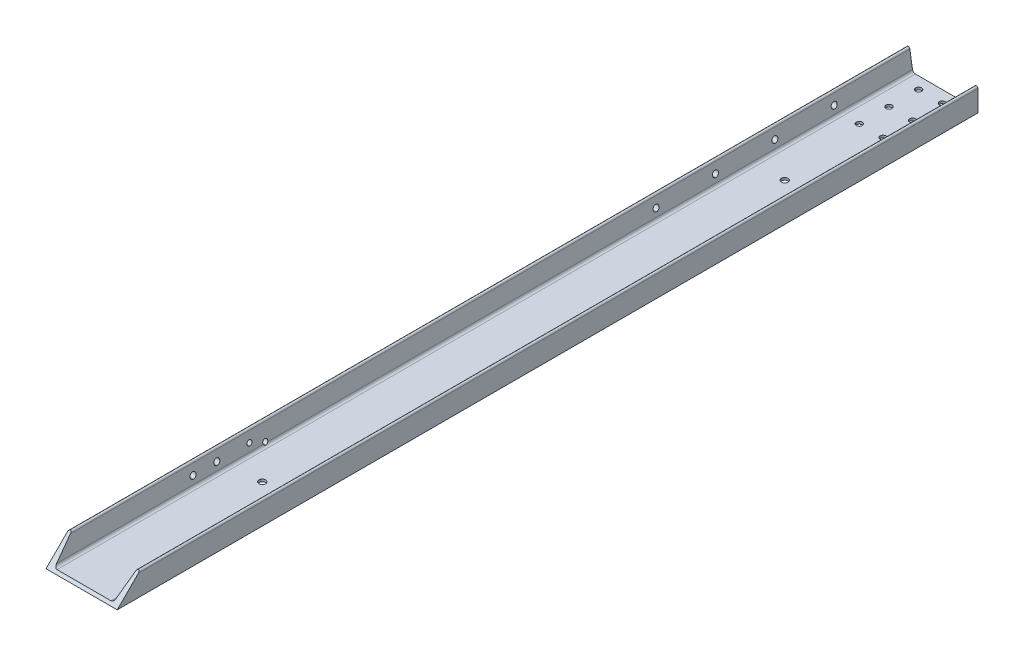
ISO-10303-21;
HEADER;
FILE_DESCRIPTION(('STEP AP214'),'2;1');
FILE_NAME('part.step','',(''),(''),'','','');
FILE_SCHEMA(('AUTOMOTIVE_DESIGN { 1 0 10303 214 1 1 1 1 }'));
ENDSEC;
DATA;
#1=APPLICATION_CONTEXT('core data for automotive mechanical design processes');
#2=APPLICATION_PROTOCOL_DEFINITION('international standard','automotive_design',2000,#1);
#3=PRODUCT_CONTEXT('',#1,'mechanical');
#4=PRODUCT('Part','Part','',(#3));
#5=PRODUCT_RELATED_PRODUCT_CATEGORY('part','',(#4));
#6=PRODUCT_DEFINITION_FORMATION('','',#4);
#7=PRODUCT_DEFINITION_CONTEXT('part definition',#1,'design');
#8=PRODUCT_DEFINITION('design','',#6,#7);
#9=PRODUCT_DEFINITION_SHAPE('','',#8);
#10=(LENGTH_UNIT() NAMED_UNIT(*) SI_UNIT(.MILLI.,.METRE.));
#11=(NAMED_UNIT(*) PLANE_ANGLE_UNIT() SI_UNIT($,.RADIAN.));
#12=(NAMED_UNIT(*) SI_UNIT($,.STERADIAN.) SOLID_ANGLE_UNIT());
#13=UNCERTAINTY_MEASURE_WITH_UNIT(LENGTH_MEASURE(1.E-05),#10,'distance_accuracy_value','');
#14=(GEOMETRIC_REPRESENTATION_CONTEXT(3) GLOBAL_UNCERTAINTY_ASSIGNED_CONTEXT((#13)) GLOBAL_UNIT_ASSIGNED_CONTEXT((#10,
#11,#12)) REPRESENTATION_CONTEXT('',''));
#15=CARTESIAN_POINT('',(0.,0.,0.));
#16=DIRECTION('',(0.,0.,1.));
#17=DIRECTION('',(1.,0.,0.));
#18=AXIS2_PLACEMENT_3D('',#15,#16,#17);
#19=CARTESIAN_POINT('',(-63.5,-11.6839999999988,463.55));
#20=DIRECTION('',(-1.,0.,0.));
#21=DIRECTION('',(0.,0.,1.));
#22=AXIS2_PLACEMENT_3D('',#19,#20,#21);
#23=CYLINDRICAL_SURFACE('',#22,5.3578125);
#24=CARTESIAN_POINT('',(-63.9897216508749,-13.9572396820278,458.698347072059));
#25=CARTESIAN_POINT('',(-63.9679745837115,-14.093281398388,458.762071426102));
#26=CARTESIAN_POINT('',(-63.9421780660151,-14.2260184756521,458.831258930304));
#27=CARTESIAN_POINT('',(-63.8838057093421,-14.4840034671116,458.979638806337));
#28=CARTESIAN_POINT('',(-63.8512381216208,-14.6092602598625,459.058818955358));
#29=CARTESIAN_POINT('',(-63.7807621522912,-14.8511274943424,459.225999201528));
#30=CARTESIAN_POINT('',(-63.7428814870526,-14.9677782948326,459.313952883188));
#31=CARTESIAN_POINT('',(-63.6629494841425,-15.1927144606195,459.498305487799));
#32=CARTESIAN_POINT('',(-63.620896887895,-15.3009972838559,459.594706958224));
#33=CARTESIAN_POINT('',(-63.534142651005,-15.5083476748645,459.794845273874));
#34=CARTESIAN_POINT('',(-63.489454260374,-15.6074558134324,459.898545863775));
#35=CARTESIAN_POINT('',(-63.3985929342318,-15.7967347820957,460.113135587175));
#36=CARTESIAN_POINT('',(-63.3524200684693,-15.8869060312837,460.224024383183));
#37=CARTESIAN_POINT('',(-63.2134854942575,-16.1440199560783,460.567338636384));
#38=CARTESIAN_POINT('',(-63.1204325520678,-16.2972805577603,460.810138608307));
#39=CARTESIAN_POINT('',(-62.9528340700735,-16.553442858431,461.299555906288));
#40=CARTESIAN_POINT('',(-62.8773970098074,-16.6594403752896,461.544232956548));
#41=CARTESIAN_POINT('',(-62.7794761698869,-16.7909063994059,461.92410140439));
#42=CARTESIAN_POINT('',(-62.7494070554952,-16.8301036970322,462.052674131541));
#43=CARTESIAN_POINT('',(-62.695594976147,-16.8989491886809,462.313610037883));
#44=CARTESIAN_POINT('',(-62.6718492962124,-16.9286014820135,462.445971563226));
#45=CARTESIAN_POINT('',(-62.6282152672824,-16.9824235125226,462.738341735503));
#46=CARTESIAN_POINT('',(-62.6098364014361,-17.004586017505,462.898963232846));
#47=CARTESIAN_POINT('',(-62.5912655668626,-17.0268646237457,463.1418179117));
#48=CARTESIAN_POINT('',(-62.5865745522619,-17.0324634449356,463.223256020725));
#49=CARTESIAN_POINT('',(-62.5802979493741,-17.0399392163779,463.386455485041));
#50=CARTESIAN_POINT('',(-62.5787136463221,-17.041814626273,463.468216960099));
#51=CARTESIAN_POINT('',(-62.5787214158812,-17.0418124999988,463.55));
#52=B_SPLINE_CURVE_WITH_KNOTS('',3,(#24,#25,#26,#27,#28,#29,#30,#31,#32,#33,#34,#35,#36,#37,#38,
#39,#40,#41,#42,#43,#44,#45,#46,#47,#48,#49,#50,#51),.UNSPECIFIED.,.F.,.F.,(4,2,2,2,2,2,2,2,2,2,
2,2,2,4),(0.,0.455065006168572,0.909578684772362,1.36180389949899,1.81416595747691,
2.26442115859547,2.71465523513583,3.61634746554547,4.44421123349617,4.85696895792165,
5.26954917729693,5.75790651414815,6.00307578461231,6.24834645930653),.UNSPECIFIED.);
#53=CARTESIAN_POINT('',(-63.989721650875,-13.9572396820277,458.698347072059));
#54=VERTEX_POINT('',#53);
#55=CARTESIAN_POINT('',(-62.5787214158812,-17.0418124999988,463.55));
#56=VERTEX_POINT('',#55);
#57=EDGE_CURVE('E465',#54,#56,#52,.T.);
#58=ORIENTED_EDGE('',*,*,#57,.F.);
#59=CARTESIAN_POINT('',(-64.3534399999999,-11.6839999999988,463.55));
#60=DIRECTION('',(0.987440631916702,0.157990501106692,0.));
#61=DIRECTION('',(-0.157990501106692,0.987440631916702,0.));
#62=AXIS2_PLACEMENT_3D('',#59,#60,#61);
#63=ELLIPSE('',#62,5.42595911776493,5.3578125);
#64=CARTESIAN_POINT('',(-65.21069,-6.32618749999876,463.55));
#65=VERTEX_POINT('',#64);
#66=EDGE_CURVE('E701',#65,#54,#63,.F.);
#67=ORIENTED_EDGE('',*,*,#66,.F.);
#68=DIRECTION('',(-1.,0.,0.));
#69=VECTOR('',#68,1.);
#70=CARTESIAN_POINT('',(-63.5,-6.32618749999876,463.55));
#71=LINE('',#70,#69);
#72=CARTESIAN_POINT('',(-76.2,-6.32618749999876,463.55));
#73=VERTEX_POINT('',#72);
#74=EDGE_CURVE('E473',#65,#73,#71,.T.);
#75=ORIENTED_EDGE('',*,*,#74,.T.);
#76=CARTESIAN_POINT('',(-76.2,-11.6839999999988,463.55));
#77=DIRECTION('',(-1.,0.,0.));
#78=DIRECTION('',(0.,0.,1.));
#79=AXIS2_PLACEMENT_3D('',#76,#77,#78);
#80=CIRCLE('',#79,5.3578125);
#81=CARTESIAN_POINT('',(-76.2,-17.0418124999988,463.55));
#82=VERTEX_POINT('',#81);
#83=EDGE_CURVE('E468',#82,#73,#80,.F.);
#84=ORIENTED_EDGE('',*,*,#83,.F.);
#85=DIRECTION('',(-1.,0.,0.));
#86=VECTOR('',#85,1.);
#87=CARTESIAN_POINT('',(-63.5,-17.0418124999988,463.55));
#88=LINE('',#87,#86);
#89=EDGE_CURVE('E461',#82,#56,#88,.F.);
#90=ORIENTED_EDGE('',*,*,#89,.T.);
#91=EDGE_LOOP('',(#58,#67,#75,#84,#90));
#92=FACE_BOUND('',#91,.T.);
#93=ADVANCED_FACE('F16',(#92),#23,.F.);
#94=CARTESIAN_POINT('',(-63.5,-11.6839999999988,463.55));
#95=DIRECTION('',(-1.,0.,0.));
#96=DIRECTION('',(0.,0.,1.));
#97=AXIS2_PLACEMENT_3D('',#94,#95,#96);
#98=CYLINDRICAL_SURFACE('',#97,5.3578125);
#99=CARTESIAN_POINT('',(-76.2,-11.6839999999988,463.55));
#100=DIRECTION('',(-1.,0.,0.));
#101=DIRECTION('',(0.,0.,1.));
#102=AXIS2_PLACEMENT_3D('',#99,#100,#101);
#103=CIRCLE('',#102,5.3578125);
#104=EDGE_CURVE('E958',#73,#82,#103,.F.);
#105=ORIENTED_EDGE('',*,*,#104,.F.);
#106=ORIENTED_EDGE('',*,*,#74,.F.);
#107=CARTESIAN_POINT('',(-64.3534399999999,-11.6839999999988,463.55));
#108=DIRECTION('',(0.987440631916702,0.157990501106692,0.));
#109=DIRECTION('',(-0.157990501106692,0.987440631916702,0.));
#110=AXIS2_PLACEMENT_3D('',#107,#108,#109);
#111=ELLIPSE('',#110,5.42595911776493,5.3578125);
#112=CARTESIAN_POINT('',(-63.9897216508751,-13.9572396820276,468.401652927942));
#113=VERTEX_POINT('',#112);
#114=EDGE_CURVE('E479',#113,#65,#111,.F.);
#115=ORIENTED_EDGE('',*,*,#114,.F.);
#116=CARTESIAN_POINT('',(-62.5787214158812,-17.0418124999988,463.55));
#117=CARTESIAN_POINT('',(-62.5786385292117,-17.041847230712,463.684958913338));
#118=CARTESIAN_POINT('',(-62.5830089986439,-17.0367150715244,463.819871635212));
#119=CARTESIAN_POINT('',(-62.6000222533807,-17.016395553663,464.088231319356));
#120=CARTESIAN_POINT('',(-62.6126535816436,-17.0012221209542,464.22168005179));
#121=CARTESIAN_POINT('',(-62.6453902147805,-16.9613011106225,464.484774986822));
#122=CARTESIAN_POINT('',(-62.6654182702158,-16.9366523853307,464.614446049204));
#123=CARTESIAN_POINT('',(-62.711933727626,-16.8781871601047,464.870540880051));
#124=CARTESIAN_POINT('',(-62.7384231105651,-16.8443678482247,464.996963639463));
#125=CARTESIAN_POINT('',(-62.7965372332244,-16.7682100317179,465.24520816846));
#126=CARTESIAN_POINT('',(-62.8281335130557,-16.7259184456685,465.367051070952));
#127=CARTESIAN_POINT('',(-62.8953529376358,-16.6331387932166,465.606370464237));
#128=CARTESIAN_POINT('',(-62.9309758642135,-16.5826511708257,465.72384719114));
#129=CARTESIAN_POINT('',(-63.0424069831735,-16.419008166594,466.070154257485));
#130=CARTESIAN_POINT('',(-63.1225864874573,-16.2939084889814,466.292102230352));
#131=CARTESIAN_POINT('',(-63.2512103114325,-16.0734792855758,466.625722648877));
#132=CARTESIAN_POINT('',(-63.2987555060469,-15.987891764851,466.744378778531));
#133=CARTESIAN_POINT('',(-63.3932894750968,-15.8071951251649,466.974444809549));
#134=CARTESIAN_POINT('',(-63.440278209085,-15.7120853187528,467.085854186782));
#135=CARTESIAN_POINT('',(-63.577969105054,-15.4133470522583,467.407928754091));
#136=CARTESIAN_POINT('',(-63.6657517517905,-15.1957323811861,467.607315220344));
#137=CARTESIAN_POINT('',(-63.7950374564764,-14.8077035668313,467.907322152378));
#138=CARTESIAN_POINT('',(-63.8420480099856,-14.646983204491,468.018256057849));
#139=CARTESIAN_POINT('',(-63.924992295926,-14.3119384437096,468.223199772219));
#140=CARTESIAN_POINT('',(-63.9609002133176,-14.1375835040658,468.317169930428));
#141=CARTESIAN_POINT('',(-63.9897216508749,-13.9572396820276,468.401652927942));
#142=B_SPLINE_CURVE_WITH_KNOTS('',3,(#116,#117,#118,#119,#120,#121,#122,#123,#124,#125,#126,
#127,#128,#129,#130,#131,#132,#133,#134,#135,#136,#137,#138,#139,#140,#141),.UNSPECIFIED.,.F.,
.F.,(4,2,2,2,2,2,2,2,2,2,2,2,4),(0.,0.404635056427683,0.808710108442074,1.20867923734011,
1.60877114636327,2.00670576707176,2.404618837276,3.20287518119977,3.66398577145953,
4.12512967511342,5.04413141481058,5.64539685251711,6.24804997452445),.UNSPECIFIED.);
#143=EDGE_CURVE('E20',#56,#113,#142,.T.);
#144=ORIENTED_EDGE('',*,*,#143,.F.);
#145=ORIENTED_EDGE('',*,*,#89,.F.);
#146=EDGE_LOOP('',(#105,#106,#115,#144,#145));
#147=FACE_BOUND('',#146,.T.);
#148=ADVANCED_FACE('F477',(#147),#98,.F.);
#149=CARTESIAN_POINT('',(-63.5,1.01599999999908,495.3));
#150=DIRECTION('',(-1.,0.,0.));
#151=DIRECTION('',(0.,0.,1.));
#152=AXIS2_PLACEMENT_3D('',#149,#150,#151);
#153=CYLINDRICAL_SURFACE('',#152,5.3578125);
#154=CARTESIAN_POINT('',(-66.3854399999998,1.01599999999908,495.3));
#155=DIRECTION('',(0.987440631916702,0.157990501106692,0.));
#156=DIRECTION('',(-0.157990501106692,0.987440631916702,0.));
#157=AXIS2_PLACEMENT_3D('',#154,#155,#156);
#158=ELLIPSE('',#157,5.42595911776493,5.3578125);
#159=CARTESIAN_POINT('',(-67.2426899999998,6.37381249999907,495.3));
#160=VERTEX_POINT('',#159);
#161=CARTESIAN_POINT('',(-65.5281899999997,-4.34181250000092,495.3));
#162=VERTEX_POINT('',#161);
#163=EDGE_CURVE('E697',#160,#162,#158,.F.);
#164=ORIENTED_EDGE('',*,*,#163,.F.);
#165=DIRECTION('',(-1.,0.,0.));
#166=VECTOR('',#165,1.);
#167=CARTESIAN_POINT('',(-63.5,6.37381249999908,495.3));
#168=LINE('',#167,#166);
#169=CARTESIAN_POINT('',(-76.2,6.37381249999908,495.3));
#170=VERTEX_POINT('',#169);
#171=EDGE_CURVE('E472',#160,#170,#168,.T.);
#172=ORIENTED_EDGE('',*,*,#171,.T.);
#173=CARTESIAN_POINT('',(-76.2,1.01599999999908,495.3));
#174=DIRECTION('',(-1.,0.,0.));
#175=DIRECTION('',(0.,0.,1.));
#176=AXIS2_PLACEMENT_3D('',#173,#174,#175);
#177=CIRCLE('',#176,5.3578125);
#178=CARTESIAN_POINT('',(-76.2,-4.34181250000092,495.3));
#179=VERTEX_POINT('',#178);
#180=EDGE_CURVE('E955',#179,#170,#177,.F.);
#181=ORIENTED_EDGE('',*,*,#180,.F.);
#182=DIRECTION('',(-1.,0.,0.));
#183=VECTOR('',#182,1.);
#184=CARTESIAN_POINT('',(-63.5,-4.34181250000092,495.3));
#185=LINE('',#184,#183);
#186=EDGE_CURVE('E770',#179,#162,#185,.F.);
#187=ORIENTED_EDGE('',*,*,#186,.T.);
#188=EDGE_LOOP('',(#164,#172,#181,#187));
#189=FACE_BOUND('',#188,.T.);
#190=ADVANCED_FACE('F1533',(#189),#153,.F.);
#191=CARTESIAN_POINT('',(-63.5,1.01599999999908,495.3));
#192=DIRECTION('',(-1.,0.,0.));
#193=DIRECTION('',(0.,0.,1.));
#194=AXIS2_PLACEMENT_3D('',#191,#192,#193);
#195=CYLINDRICAL_SURFACE('',#194,5.3578125);
#196=CARTESIAN_POINT('',(-76.2,1.01599999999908,495.3));
#197=DIRECTION('',(-1.,0.,0.));
#198=DIRECTION('',(0.,0.,1.));
#199=AXIS2_PLACEMENT_3D('',#196,#197,#198);
#200=CIRCLE('',#199,5.3578125);
#201=EDGE_CURVE('E952',#170,#179,#200,.F.);
#202=ORIENTED_EDGE('',*,*,#201,.F.);
#203=ORIENTED_EDGE('',*,*,#171,.F.);
#204=CARTESIAN_POINT('',(-66.3854399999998,1.01599999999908,495.3));
#205=DIRECTION('',(0.987440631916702,0.157990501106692,0.));
#206=DIRECTION('',(-0.157990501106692,0.987440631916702,0.));
#207=AXIS2_PLACEMENT_3D('',#204,#205,#206);
#208=ELLIPSE('',#207,5.42595911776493,5.3578125);
#209=EDGE_CURVE('E694',#162,#160,#208,.F.);
#210=ORIENTED_EDGE('',*,*,#209,.F.);
#211=ORIENTED_EDGE('',*,*,#186,.F.);
#212=EDGE_LOOP('',(#202,#203,#210,#211));
#213=FACE_BOUND('',#212,.T.);
#214=ADVANCED_FACE('F1529',(#213),#195,.F.);
#215=CARTESIAN_POINT('',(-71.8439000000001,1.01600000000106,-755.65));
#216=DIRECTION('',(1.,0.,0.));
#217=DIRECTION('',(0.,0.,-1.));
#218=AXIS2_PLACEMENT_3D('',#215,#216,#217);
#219=CYLINDRICAL_SURFACE('',#218,6.35);
#220=CARTESIAN_POINT('',(-76.2,1.01600000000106,-755.65));
#221=DIRECTION('',(1.,0.,0.));
#222=DIRECTION('',(0.,0.,-1.));
#223=AXIS2_PLACEMENT_3D('',#220,#221,#222);
#224=CIRCLE('',#223,6.35);
#225=CARTESIAN_POINT('',(-76.2,-5.33399999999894,-755.65));
#226=VERTEX_POINT('',#225);
#227=CARTESIAN_POINT('',(-76.2,7.36600000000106,-755.65));
#228=VERTEX_POINT('',#227);
#229=EDGE_CURVE('E949',#226,#228,#224,.T.);
#230=ORIENTED_EDGE('',*,*,#229,.F.);
#231=DIRECTION('',(1.,0.,0.));
#232=VECTOR('',#231,1.);
#233=CARTESIAN_POINT('',(-71.8439000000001,-5.33399999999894,-755.65));
#234=LINE('',#233,#232);
#235=CARTESIAN_POINT('',(-65.36944,-5.33399999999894,-755.65));
#236=VERTEX_POINT('',#235);
#237=EDGE_CURVE('E768',#226,#236,#234,.T.);
#238=ORIENTED_EDGE('',*,*,#237,.T.);
#239=CARTESIAN_POINT('',(-66.3854400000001,1.01600000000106,-755.65));
#240=DIRECTION('',(0.987440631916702,0.157990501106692,0.));
#241=DIRECTION('',(0.157990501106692,-0.987440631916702,0.));
#242=AXIS2_PLACEMENT_3D('',#239,#240,#241);
#243=ELLIPSE('',#242,6.43076636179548,6.35);
#244=CARTESIAN_POINT('',(-67.4014400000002,7.36600000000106,-755.65));
#245=VERTEX_POINT('',#244);
#246=EDGE_CURVE('E719',#245,#236,#243,.F.);
#247=ORIENTED_EDGE('',*,*,#246,.F.);
#248=DIRECTION('',(1.,0.,0.));
#249=VECTOR('',#248,1.);
#250=CARTESIAN_POINT('',(-71.8439000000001,7.36600000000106,-755.65));
#251=LINE('',#250,#249);
#252=EDGE_CURVE('E766',#245,#228,#251,.F.);
#253=ORIENTED_EDGE('',*,*,#252,.T.);
#254=EDGE_LOOP('',(#230,#238,#247,#253));
#255=FACE_BOUND('',#254,.T.);
#256=ADVANCED_FACE('F1525',(#255),#219,.F.);
#257=CARTESIAN_POINT('',(-71.8439000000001,1.01600000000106,-755.65));
#258=DIRECTION('',(1.,0.,0.));
#259=DIRECTION('',(0.,0.,-1.));
#260=AXIS2_PLACEMENT_3D('',#257,#258,#259);
#261=CYLINDRICAL_SURFACE('',#260,6.35);
#262=CARTESIAN_POINT('',(-66.3854400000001,1.01600000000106,-755.65));
#263=DIRECTION('',(0.987440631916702,0.157990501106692,0.));
#264=DIRECTION('',(0.157990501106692,-0.987440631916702,0.));
#265=AXIS2_PLACEMENT_3D('',#262,#263,#264);
#266=ELLIPSE('',#265,6.43076636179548,6.35);
#267=EDGE_CURVE('E716',#236,#245,#266,.F.);
#268=ORIENTED_EDGE('',*,*,#267,.F.);
#269=ORIENTED_EDGE('',*,*,#237,.F.);
#270=CARTESIAN_POINT('',(-76.2,1.01600000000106,-755.65));
#271=DIRECTION('',(1.,0.,0.));
#272=DIRECTION('',(0.,0.,-1.));
#273=AXIS2_PLACEMENT_3D('',#270,#271,#272);
#274=CIRCLE('',#273,6.35);
#275=EDGE_CURVE('E946',#228,#226,#274,.T.);
#276=ORIENTED_EDGE('',*,*,#275,.F.);
#277=ORIENTED_EDGE('',*,*,#252,.F.);
#278=EDGE_LOOP('',(#268,#269,#276,#277));
#279=FACE_BOUND('',#278,.T.);
#280=ADVANCED_FACE('F1521',(#279),#261,.F.);
#281=CARTESIAN_POINT('',(-63.1825000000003,1.0160000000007,565.15));
#282=DIRECTION('',(1.,0.,0.));
#283=DIRECTION('',(0.,1.,0.));
#284=AXIS2_PLACEMENT_3D('',#281,#282,#283);
#285=CYLINDRICAL_SURFACE('',#284,6.35);
#286=CARTESIAN_POINT('',(-76.2,1.0160000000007,565.15));
#287=DIRECTION('',(1.,0.,0.));
#288=DIRECTION('',(0.,1.,0.));
#289=AXIS2_PLACEMENT_3D('',#286,#287,#288);
#290=CIRCLE('',#289,6.35);
#291=CARTESIAN_POINT('',(-76.2,-5.3339999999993,565.15));
#292=VERTEX_POINT('',#291);
#293=CARTESIAN_POINT('',(-76.2,7.3660000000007,565.15));
#294=VERTEX_POINT('',#293);
#295=EDGE_CURVE('E943',#292,#294,#290,.T.);
#296=ORIENTED_EDGE('',*,*,#295,.F.);
#297=DIRECTION('',(1.,0.,0.));
#298=VECTOR('',#297,1.);
#299=CARTESIAN_POINT('',(-63.1825000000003,-5.3339999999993,565.15));
#300=LINE('',#299,#298);
#301=CARTESIAN_POINT('',(-65.3694399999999,-5.3339999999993,565.15));
#302=VERTEX_POINT('',#301);
#303=EDGE_CURVE('E764',#292,#302,#300,.T.);
#304=ORIENTED_EDGE('',*,*,#303,.T.);
#305=CARTESIAN_POINT('',(-66.38544,1.0160000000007,565.15));
#306=DIRECTION('',(0.987440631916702,0.157990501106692,0.));
#307=DIRECTION('',(0.157990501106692,-0.987440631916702,0.));
#308=AXIS2_PLACEMENT_3D('',#305,#306,#307);
#309=ELLIPSE('',#308,6.43076636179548,6.35);
#310=CARTESIAN_POINT('',(-67.4014400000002,7.3660000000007,565.15));
#311=VERTEX_POINT('',#310);
#312=EDGE_CURVE('E707',#311,#302,#309,.F.);
#313=ORIENTED_EDGE('',*,*,#312,.F.);
#314=DIRECTION('',(1.,0.,0.));
#315=VECTOR('',#314,1.);
#316=CARTESIAN_POINT('',(-63.1825000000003,7.3660000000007,565.15));
#317=LINE('',#316,#315);
#318=EDGE_CURVE('E762',#311,#294,#317,.F.);
#319=ORIENTED_EDGE('',*,*,#318,.T.);
#320=EDGE_LOOP('',(#296,#304,#313,#319));
#321=FACE_BOUND('',#320,.T.);
#322=ADVANCED_FACE('F1517',(#321),#285,.F.);
#323=CARTESIAN_POINT('',(-63.1825000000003,1.0160000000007,565.15));
#324=DIRECTION('',(1.,0.,0.));
#325=DIRECTION('',(0.,1.,0.));
#326=AXIS2_PLACEMENT_3D('',#323,#324,#325);
#327=CYLINDRICAL_SURFACE('',#326,6.35);
#328=CARTESIAN_POINT('',(-66.38544,1.0160000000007,565.15));
#329=DIRECTION('',(0.987440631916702,0.157990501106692,0.));
#330=DIRECTION('',(0.157990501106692,-0.987440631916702,0.));
#331=AXIS2_PLACEMENT_3D('',#328,#329,#330);
#332=ELLIPSE('',#331,6.43076636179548,6.35);
#333=EDGE_CURVE('E704',#302,#311,#332,.F.);
#334=ORIENTED_EDGE('',*,*,#333,.F.);
#335=ORIENTED_EDGE('',*,*,#303,.F.);
#336=CARTESIAN_POINT('',(-76.2,1.0160000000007,565.15));
#337=DIRECTION('',(1.,0.,0.));
#338=DIRECTION('',(0.,1.,0.));
#339=AXIS2_PLACEMENT_3D('',#336,#337,#338);
#340=CIRCLE('',#339,6.35);
#341=EDGE_CURVE('E940',#294,#292,#340,.T.);
#342=ORIENTED_EDGE('',*,*,#341,.F.);
#343=ORIENTED_EDGE('',*,*,#318,.F.);
#344=EDGE_LOOP('',(#334,#335,#342,#343));
#345=FACE_BOUND('',#344,.T.);
#346=ADVANCED_FACE('F1513',(#345),#327,.F.);
#347=CARTESIAN_POINT('',(-63.1825000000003,1.0160000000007,615.95));
#348=DIRECTION('',(1.,0.,0.));
#349=DIRECTION('',(0.,1.,0.));
#350=AXIS2_PLACEMENT_3D('',#347,#348,#349);
#351=CYLINDRICAL_SURFACE('',#350,6.35);
#352=CARTESIAN_POINT('',(-76.2,1.0160000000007,615.95));
#353=DIRECTION('',(1.,0.,0.));
#354=DIRECTION('',(0.,1.,0.));
#355=AXIS2_PLACEMENT_3D('',#352,#353,#354);
#356=CIRCLE('',#355,6.35);
#357=CARTESIAN_POINT('',(-76.2,-5.3339999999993,615.95));
#358=VERTEX_POINT('',#357);
#359=CARTESIAN_POINT('',(-76.2,7.3660000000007,615.95));
#360=VERTEX_POINT('',#359);
#361=EDGE_CURVE('E937',#358,#360,#356,.T.);
#362=ORIENTED_EDGE('',*,*,#361,.F.);
#363=DIRECTION('',(1.,0.,0.));
#364=VECTOR('',#363,1.);
#365=CARTESIAN_POINT('',(-63.1825000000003,-5.3339999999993,615.95));
#366=LINE('',#365,#364);
#367=CARTESIAN_POINT('',(-65.3694399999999,-5.3339999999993,615.95));
#368=VERTEX_POINT('',#367);
#369=EDGE_CURVE('E760',#358,#368,#366,.T.);
#370=ORIENTED_EDGE('',*,*,#369,.T.);
#371=CARTESIAN_POINT('',(-66.38544,1.0160000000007,615.95));
#372=DIRECTION('',(0.987440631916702,0.157990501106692,0.));
#373=DIRECTION('',(0.157990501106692,-0.987440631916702,0.));
#374=AXIS2_PLACEMENT_3D('',#371,#372,#373);
#375=ELLIPSE('',#374,6.43076636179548,6.35);
#376=CARTESIAN_POINT('',(-67.4014400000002,7.3660000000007,615.95));
#377=VERTEX_POINT('',#376);
#378=EDGE_CURVE('E713',#377,#368,#375,.F.);
#379=ORIENTED_EDGE('',*,*,#378,.F.);
#380=DIRECTION('',(1.,0.,0.));
#381=VECTOR('',#380,1.);
#382=CARTESIAN_POINT('',(-63.1825000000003,7.3660000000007,615.95));
#383=LINE('',#382,#381);
#384=EDGE_CURVE('E758',#377,#360,#383,.F.);
#385=ORIENTED_EDGE('',*,*,#384,.T.);
#386=EDGE_LOOP('',(#362,#370,#379,#385));
#387=FACE_BOUND('',#386,.T.);
#388=ADVANCED_FACE('F1509',(#387),#351,.F.);
#389=CARTESIAN_POINT('',(-63.1825000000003,1.0160000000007,615.95));
#390=DIRECTION('',(1.,0.,0.));
#391=DIRECTION('',(0.,1.,0.));
#392=AXIS2_PLACEMENT_3D('',#389,#390,#391);
#393=CYLINDRICAL_SURFACE('',#392,6.35);
#394=CARTESIAN_POINT('',(-66.38544,1.0160000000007,615.95));
#395=DIRECTION('',(0.987440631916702,0.157990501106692,0.));
#396=DIRECTION('',(0.157990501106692,-0.987440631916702,0.));
#397=AXIS2_PLACEMENT_3D('',#394,#395,#396);
#398=ELLIPSE('',#397,6.43076636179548,6.35);
#399=EDGE_CURVE('E710',#368,#377,#398,.F.);
#400=ORIENTED_EDGE('',*,*,#399,.F.);
#401=ORIENTED_EDGE('',*,*,#369,.F.);
#402=CARTESIAN_POINT('',(-76.2,1.0160000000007,615.95));
#403=DIRECTION('',(1.,0.,0.));
#404=DIRECTION('',(0.,1.,0.));
#405=AXIS2_PLACEMENT_3D('',#402,#403,#404);
#406=CIRCLE('',#405,6.35);
#407=EDGE_CURVE('E934',#360,#358,#406,.T.);
#408=ORIENTED_EDGE('',*,*,#407,.F.);
#409=ORIENTED_EDGE('',*,*,#384,.F.);
#410=EDGE_LOOP('',(#400,#401,#408,#409));
#411=FACE_BOUND('',#410,.T.);
#412=ADVANCED_FACE('F1505',(#411),#393,.F.);
#413=CARTESIAN_POINT('',(-71.8439000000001,1.01600000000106,-374.65));
#414=DIRECTION('',(1.,0.,0.));
#415=DIRECTION('',(0.,0.,-1.));
#416=AXIS2_PLACEMENT_3D('',#413,#414,#415);
#417=CYLINDRICAL_SURFACE('',#416,6.35);
#418=CARTESIAN_POINT('',(-76.2,1.01600000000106,-374.65));
#419=DIRECTION('',(1.,0.,0.));
#420=DIRECTION('',(0.,0.,-1.));
#421=AXIS2_PLACEMENT_3D('',#418,#419,#420);
#422=CIRCLE('',#421,6.35);
#423=CARTESIAN_POINT('',(-76.2,-5.33399999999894,-374.65));
#424=VERTEX_POINT('',#423);
#425=CARTESIAN_POINT('',(-76.2,7.36600000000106,-374.65));
#426=VERTEX_POINT('',#425);
#427=EDGE_CURVE('E931',#424,#426,#422,.T.);
#428=ORIENTED_EDGE('',*,*,#427,.F.);
#429=DIRECTION('',(1.,0.,0.));
#430=VECTOR('',#429,1.);
#431=CARTESIAN_POINT('',(-71.8439000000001,-5.33399999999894,-374.65));
#432=LINE('',#431,#430);
#433=CARTESIAN_POINT('',(-65.36944,-5.33399999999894,-374.65));
#434=VERTEX_POINT('',#433);
#435=EDGE_CURVE('E756',#424,#434,#432,.T.);
#436=ORIENTED_EDGE('',*,*,#435,.T.);
#437=CARTESIAN_POINT('',(-66.3854400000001,1.01600000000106,-374.65));
#438=DIRECTION('',(0.987440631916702,0.157990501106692,0.));
#439=DIRECTION('',(0.157990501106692,-0.987440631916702,0.));
#440=AXIS2_PLACEMENT_3D('',#437,#438,#439);
#441=ELLIPSE('',#440,6.43076636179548,6.35);
#442=CARTESIAN_POINT('',(-67.4014400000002,7.36600000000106,-374.65));
#443=VERTEX_POINT('',#442);
#444=EDGE_CURVE('E731',#443,#434,#441,.F.);
#445=ORIENTED_EDGE('',*,*,#444,.F.);
#446=DIRECTION('',(1.,0.,0.));
#447=VECTOR('',#446,1.);
#448=CARTESIAN_POINT('',(-71.8439000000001,7.36600000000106,-374.65));
#449=LINE('',#448,#447);
#450=EDGE_CURVE('E751',#443,#426,#449,.F.);
#451=ORIENTED_EDGE('',*,*,#450,.T.);
#452=EDGE_LOOP('',(#428,#436,#445,#451));
#453=FACE_BOUND('',#452,.T.);
#454=ADVANCED_FACE('F1501',(#453),#417,.F.);
#455=CARTESIAN_POINT('',(-71.8439000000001,1.01600000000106,-374.65));
#456=DIRECTION('',(1.,0.,0.));
#457=DIRECTION('',(0.,0.,-1.));
#458=AXIS2_PLACEMENT_3D('',#455,#456,#457);
#459=CYLINDRICAL_SURFACE('',#458,6.35);
#460=CARTESIAN_POINT('',(-66.3854400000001,1.01600000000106,-374.65));
#461=DIRECTION('',(0.987440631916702,0.157990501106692,0.));
#462=DIRECTION('',(0.157990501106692,-0.987440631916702,0.));
#463=AXIS2_PLACEMENT_3D('',#460,#461,#462);
#464=ELLIPSE('',#463,6.43076636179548,6.35);
#465=EDGE_CURVE('E728',#434,#443,#464,.F.);
#466=ORIENTED_EDGE('',*,*,#465,.F.);
#467=ORIENTED_EDGE('',*,*,#435,.F.);
#468=CARTESIAN_POINT('',(-76.2,1.01600000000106,-374.65));
#469=DIRECTION('',(1.,0.,0.));
#470=DIRECTION('',(0.,0.,-1.));
#471=AXIS2_PLACEMENT_3D('',#468,#469,#470);
#472=CIRCLE('',#471,6.35);
#473=EDGE_CURVE('E928',#426,#424,#472,.T.);
#474=ORIENTED_EDGE('',*,*,#473,.F.);
#475=ORIENTED_EDGE('',*,*,#450,.F.);
#476=EDGE_LOOP('',(#466,#467,#474,#475));
#477=FACE_BOUND('',#476,.T.);
#478=ADVANCED_FACE('F1498',(#477),#459,.F.);
#479=CARTESIAN_POINT('',(-71.8439000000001,1.01600000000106,-501.65));
#480=DIRECTION('',(1.,0.,0.));
#481=DIRECTION('',(0.,0.,-1.));
#482=AXIS2_PLACEMENT_3D('',#479,#480,#481);
#483=CYLINDRICAL_SURFACE('',#482,6.35);
#484=CARTESIAN_POINT('',(-76.2,1.01600000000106,-501.65));
#485=DIRECTION('',(1.,0.,0.));
#486=DIRECTION('',(0.,0.,-1.));
#487=AXIS2_PLACEMENT_3D('',#484,#485,#486);
#488=CIRCLE('',#487,6.35);
#489=CARTESIAN_POINT('',(-76.2,-5.33399999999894,-501.65));
#490=VERTEX_POINT('',#489);
#491=CARTESIAN_POINT('',(-76.2,7.36600000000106,-501.65));
#492=VERTEX_POINT('',#491);
#493=EDGE_CURVE('E926',#490,#492,#488,.T.);
#494=ORIENTED_EDGE('',*,*,#493,.F.);
#495=DIRECTION('',(1.,0.,0.));
#496=VECTOR('',#495,1.);
#497=CARTESIAN_POINT('',(-71.8439000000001,-5.33399999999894,-501.65));
#498=LINE('',#497,#496);
#499=CARTESIAN_POINT('',(-65.36944,-5.33399999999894,-501.65));
#500=VERTEX_POINT('',#499);
#501=EDGE_CURVE('E741',#490,#500,#498,.T.);
#502=ORIENTED_EDGE('',*,*,#501,.T.);
#503=CARTESIAN_POINT('',(-66.3854400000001,1.01600000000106,-501.65));
#504=DIRECTION('',(0.987440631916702,0.157990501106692,0.));
#505=DIRECTION('',(0.157990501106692,-0.987440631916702,0.));
#506=AXIS2_PLACEMENT_3D('',#503,#504,#505);
#507=ELLIPSE('',#506,6.43076636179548,6.35);
#508=CARTESIAN_POINT('',(-67.4014400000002,7.36600000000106,-501.65));
#509=VERTEX_POINT('',#508);
#510=EDGE_CURVE('E488',#509,#500,#507,.F.);
#511=ORIENTED_EDGE('',*,*,#510,.F.);
#512=DIRECTION('',(1.,0.,0.));
#513=VECTOR('',#512,1.);
#514=CARTESIAN_POINT('',(-71.8439000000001,7.36600000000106,-501.65));
#515=LINE('',#514,#513);
#516=EDGE_CURVE('E743',#509,#492,#515,.F.);
#517=ORIENTED_EDGE('',*,*,#516,.T.);
#518=EDGE_LOOP('',(#494,#502,#511,#517));
#519=FACE_BOUND('',#518,.T.);
#520=ADVANCED_FACE('F1495',(#519),#483,.F.);
#521=CARTESIAN_POINT('',(-71.8439000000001,1.01600000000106,-501.65));
#522=DIRECTION('',(1.,0.,0.));
#523=DIRECTION('',(0.,0.,-1.));
#524=AXIS2_PLACEMENT_3D('',#521,#522,#523);
#525=CYLINDRICAL_SURFACE('',#524,6.35);
#526=CARTESIAN_POINT('',(-66.3854400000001,1.01600000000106,-501.65));
#527=DIRECTION('',(0.987440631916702,0.157990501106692,0.));
#528=DIRECTION('',(0.157990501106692,-0.987440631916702,0.));
#529=AXIS2_PLACEMENT_3D('',#526,#527,#528);
#530=ELLIPSE('',#529,6.43076636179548,6.35);
#531=EDGE_CURVE('E490',#500,#509,#530,.F.);
#532=ORIENTED_EDGE('',*,*,#531,.F.);
#533=ORIENTED_EDGE('',*,*,#501,.F.);
#534=CARTESIAN_POINT('',(-76.2,1.01600000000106,-501.65));
#535=DIRECTION('',(1.,0.,0.));
#536=DIRECTION('',(0.,0.,-1.));
#537=AXIS2_PLACEMENT_3D('',#534,#535,#536);
#538=CIRCLE('',#537,6.35);
#539=EDGE_CURVE('E744',#492,#490,#538,.T.);
#540=ORIENTED_EDGE('',*,*,#539,.F.);
#541=ORIENTED_EDGE('',*,*,#516,.F.);
#542=EDGE_LOOP('',(#532,#533,#540,#541));
#543=FACE_BOUND('',#542,.T.);
#544=ADVANCED_FACE('F739',(#543),#525,.F.);
#545=CARTESIAN_POINT('',(-71.8439000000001,1.01600000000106,-628.65));
#546=DIRECTION('',(1.,0.,0.));
#547=DIRECTION('',(0.,0.,-1.));
#548=AXIS2_PLACEMENT_3D('',#545,#546,#547);
#549=CYLINDRICAL_SURFACE('',#548,6.35);
#550=CARTESIAN_POINT('',(-76.2,1.01600000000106,-628.65));
#551=DIRECTION('',(1.,0.,0.));
#552=DIRECTION('',(0.,0.,-1.));
#553=AXIS2_PLACEMENT_3D('',#550,#551,#552);
#554=CIRCLE('',#553,6.35);
#555=CARTESIAN_POINT('',(-76.2,-5.33399999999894,-628.65));
#556=VERTEX_POINT('',#555);
#557=CARTESIAN_POINT('',(-76.2,7.36600000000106,-628.65));
#558=VERTEX_POINT('',#557);
#559=EDGE_CURVE('E922',#556,#558,#554,.T.);
#560=ORIENTED_EDGE('',*,*,#559,.F.);
#561=DIRECTION('',(1.,0.,0.));
#562=VECTOR('',#561,1.);
#563=CARTESIAN_POINT('',(-71.8439000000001,-5.33399999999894,-628.65));
#564=LINE('',#563,#562);
#565=CARTESIAN_POINT('',(-65.36944,-5.33399999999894,-628.65));
#566=VERTEX_POINT('',#565);
#567=EDGE_CURVE('E747',#556,#566,#564,.T.);
#568=ORIENTED_EDGE('',*,*,#567,.T.);
#569=CARTESIAN_POINT('',(-66.3854400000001,1.01600000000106,-628.65));
#570=DIRECTION('',(0.987440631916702,0.157990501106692,0.));
#571=DIRECTION('',(0.157990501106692,-0.987440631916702,0.));
#572=AXIS2_PLACEMENT_3D('',#569,#570,#571);
#573=ELLIPSE('',#572,6.43076636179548,6.35);
#574=CARTESIAN_POINT('',(-67.4014400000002,7.36600000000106,-628.65));
#575=VERTEX_POINT('',#574);
#576=EDGE_CURVE('E725',#575,#566,#573,.F.);
#577=ORIENTED_EDGE('',*,*,#576,.F.);
#578=DIRECTION('',(1.,0.,0.));
#579=VECTOR('',#578,1.);
#580=CARTESIAN_POINT('',(-71.8439000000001,7.36600000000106,-628.65));
#581=LINE('',#580,#579);
#582=EDGE_CURVE('E749',#575,#558,#581,.F.);
#583=ORIENTED_EDGE('',*,*,#582,.T.);
#584=EDGE_LOOP('',(#560,#568,#577,#583));
#585=FACE_BOUND('',#584,.T.);
#586=ADVANCED_FACE('F1127',(#585),#549,.F.);
#587=CARTESIAN_POINT('',(-71.8439000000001,1.01600000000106,-628.65));
#588=DIRECTION('',(1.,0.,0.));
#589=DIRECTION('',(0.,0.,-1.));
#590=AXIS2_PLACEMENT_3D('',#587,#588,#589);
#591=CYLINDRICAL_SURFACE('',#590,6.35);
#592=CARTESIAN_POINT('',(-66.3854400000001,1.01600000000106,-628.65));
#593=DIRECTION('',(0.987440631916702,0.157990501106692,0.));
#594=DIRECTION('',(0.157990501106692,-0.987440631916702,0.));
#595=AXIS2_PLACEMENT_3D('',#592,#593,#594);
#596=ELLIPSE('',#595,6.43076636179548,6.35);
#597=EDGE_CURVE('E722',#566,#575,#596,.F.);
#598=ORIENTED_EDGE('',*,*,#597,.F.);
#599=ORIENTED_EDGE('',*,*,#567,.F.);
#600=CARTESIAN_POINT('',(-76.2,1.01600000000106,-628.65));
#601=DIRECTION('',(1.,0.,0.));
#602=DIRECTION('',(0.,0.,-1.));
#603=AXIS2_PLACEMENT_3D('',#600,#601,#602);
#604=CIRCLE('',#603,6.35);
#605=EDGE_CURVE('E918',#558,#556,#604,.T.);
#606=ORIENTED_EDGE('',*,*,#605,.F.);
#607=ORIENTED_EDGE('',*,*,#582,.F.);
#608=EDGE_LOOP('',(#598,#599,#606,#607));
#609=FACE_BOUND('',#608,.T.);
#610=ADVANCED_FACE('F1131',(#609),#591,.F.);
#611=CARTESIAN_POINT('',(72.8979999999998,21.0820000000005,-350.785362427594));
#612=DIRECTION('',(0.,0.,1.));
#613=DIRECTION('',(1.,0.,0.));
#614=AXIS2_PLACEMENT_3D('',#611,#612,#613);
#615=CYLINDRICAL_SURFACE('',#614,3.3019999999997);
#616=DIRECTION('',(0.,0.,1.));
#617=VECTOR('',#616,1.);
#618=CARTESIAN_POINT('',(69.5960000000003,21.0819999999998,-350.785362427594));
#619=LINE('',#618,#617);
#620=CARTESIAN_POINT('',(69.5960000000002,21.081999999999,875.284000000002));
#621=VERTEX_POINT('',#620);
#622=CARTESIAN_POINT('',(69.5960000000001,21.0819999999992,-920.75));
#623=VERTEX_POINT('',#622);
#624=EDGE_CURVE('E802',#621,#623,#619,.F.);
#625=ORIENTED_EDGE('',*,*,#624,.F.);
#626=CARTESIAN_POINT('',(72.8979999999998,21.0820000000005,875.284000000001));
#627=DIRECTION('',(0.,-0.707106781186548,-0.707106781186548));
#628=DIRECTION('',(0.,-0.707106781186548,0.707106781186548));
#629=AXIS2_PLACEMENT_3D('',#626,#627,#628);
#630=ELLIPSE('',#629,4.66973318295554,3.3019999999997);
#631=CARTESIAN_POINT('',(76.1999999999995,21.0820000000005,875.284000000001));
#632=VERTEX_POINT('',#631);
#633=EDGE_CURVE('E965',#621,#632,#630,.T.);
#634=ORIENTED_EDGE('',*,*,#633,.T.);
#635=DIRECTION('',(0.,0.,-1.));
#636=VECTOR('',#635,1.);
#637=CARTESIAN_POINT('',(76.1999999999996,21.0820000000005,-350.785362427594));
#638=LINE('',#637,#636);
#639=CARTESIAN_POINT('',(76.1999999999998,21.0820000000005,-920.75));
#640=VERTEX_POINT('',#639);
#641=EDGE_CURVE('E1109',#640,#632,#638,.F.);
#642=ORIENTED_EDGE('',*,*,#641,.F.);
#643=CARTESIAN_POINT('',(72.8979999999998,21.0820000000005,-920.75));
#644=DIRECTION('',(0.,0.,1.));
#645=DIRECTION('',(1.,0.,0.));
#646=AXIS2_PLACEMENT_3D('',#643,#644,#645);
#647=CIRCLE('',#646,3.3019999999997);
#648=EDGE_CURVE('E915',#640,#623,#647,.T.);
#649=ORIENTED_EDGE('',*,*,#648,.T.);
#650=EDGE_LOOP('',(#625,#634,#642,#649));
#651=FACE_BOUND('',#650,.T.);
#652=ADVANCED_FACE('F1362',(#651),#615,.T.);
#653=CARTESIAN_POINT('',(63.9897216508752,-13.9572396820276,-350.785362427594));
#654=DIRECTION('',(-0.987440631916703,0.157990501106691,0.));
#655=DIRECTION('',(-0.157990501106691,-0.987440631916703,0.));
#656=AXIS2_PLACEMENT_3D('',#653,#654,#655);
#657=PLANE('',#656);
#658=CARTESIAN_POINT('',(63.5,-17.0179999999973,-317.5));
#659=DIRECTION('',(-0.987440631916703,0.157990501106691,0.));
#660=DIRECTION('',(-0.157990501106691,-0.987440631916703,0.));
#661=AXIS2_PLACEMENT_3D('',#658,#659,#660);
#662=ELLIPSE('',#661,11.2538411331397,1.77799999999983);
#663=CARTESIAN_POINT('',(65.2779999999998,-5.90549999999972,-317.5));
#664=VERTEX_POINT('',#663);
#665=CARTESIAN_POINT('',(63.9897216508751,-13.9572396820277,-315.79077306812));
#666=VERTEX_POINT('',#665);
#667=EDGE_CURVE('E654',#664,#666,#662,.F.);
#668=ORIENTED_EDGE('',*,*,#667,.T.);
#669=DIRECTION('',(0.,0.,1.));
#670=VECTOR('',#669,1.);
#671=CARTESIAN_POINT('',(63.9897216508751,-13.9572396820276,-350.785362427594));
#672=LINE('',#671,#670);
#673=CARTESIAN_POINT('',(63.9897216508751,-13.9572396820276,-116.00922693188));
#674=VERTEX_POINT('',#673);
#675=EDGE_CURVE('E788',#674,#666,#672,.F.);
#676=ORIENTED_EDGE('',*,*,#675,.F.);
#677=CARTESIAN_POINT('',(63.5,-17.0179999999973,-114.3));
#678=DIRECTION('',(-0.987440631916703,0.157990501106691,0.));
#679=DIRECTION('',(-0.157990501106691,-0.987440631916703,0.));
#680=AXIS2_PLACEMENT_3D('',#677,#678,#679);
#681=ELLIPSE('',#680,11.2538411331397,1.77799999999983);
#682=CARTESIAN_POINT('',(65.2779999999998,-5.90549999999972,-114.3));
#683=VERTEX_POINT('',#682);
#684=EDGE_CURVE('E1081',#674,#683,#681,.F.);
#685=ORIENTED_EDGE('',*,*,#684,.T.);
#686=CARTESIAN_POINT('',(63.5,-17.0179999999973,-114.3));
#687=DIRECTION('',(-0.987440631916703,0.157990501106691,0.));
#688=DIRECTION('',(-0.157990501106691,-0.987440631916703,0.));
#689=AXIS2_PLACEMENT_3D('',#686,#687,#688);
#690=ELLIPSE('',#689,11.2538411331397,1.77799999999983);
#691=CARTESIAN_POINT('',(63.9897216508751,-13.9572396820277,-112.59077306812));
#692=VERTEX_POINT('',#691);
#693=EDGE_CURVE('E679',#683,#692,#690,.F.);
#694=ORIENTED_EDGE('',*,*,#693,.T.);
#695=DIRECTION('',(0.,0.,1.));
#696=VECTOR('',#695,1.);
#697=CARTESIAN_POINT('',(63.9897216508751,-13.9572396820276,-350.785362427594));
#698=LINE('',#697,#696);
#699=CARTESIAN_POINT('',(63.9897216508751,-13.9572396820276,87.1907730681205));
#700=VERTEX_POINT('',#699);
#701=EDGE_CURVE('E789',#700,#692,#698,.F.);
#702=ORIENTED_EDGE('',*,*,#701,.F.);
#703=CARTESIAN_POINT('',(63.5,-17.0179999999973,88.9000000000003));
#704=DIRECTION('',(-0.987440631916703,0.157990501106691,0.));
#705=DIRECTION('',(-0.157990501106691,-0.987440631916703,0.));
#706=AXIS2_PLACEMENT_3D('',#703,#704,#705);
#707=ELLIPSE('',#706,11.2538411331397,1.77799999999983);
#708=CARTESIAN_POINT('',(65.2779999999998,-5.90549999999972,88.9000000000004));
#709=VERTEX_POINT('',#708);
#710=EDGE_CURVE('E1048',#700,#709,#707,.F.);
#711=ORIENTED_EDGE('',*,*,#710,.T.);
#712=CARTESIAN_POINT('',(63.5,-17.0179999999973,88.9000000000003));
#713=DIRECTION('',(-0.987440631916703,0.157990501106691,0.));
#714=DIRECTION('',(-0.157990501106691,-0.987440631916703,0.));
#715=AXIS2_PLACEMENT_3D('',#712,#713,#714);
#716=ELLIPSE('',#715,11.2538411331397,1.77799999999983);
#717=CARTESIAN_POINT('',(63.9897216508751,-13.9572396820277,90.6092269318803));
#718=VERTEX_POINT('',#717);
#719=EDGE_CURVE('E1054',#709,#718,#716,.F.);
#720=ORIENTED_EDGE('',*,*,#719,.T.);
#721=DIRECTION('',(0.,0.,1.));
#722=VECTOR('',#721,1.);
#723=CARTESIAN_POINT('',(63.9897216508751,-13.9572396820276,-350.785362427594));
#724=LINE('',#723,#722);
#725=CARTESIAN_POINT('',(63.9897216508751,-13.9572396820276,290.39077306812));
#726=VERTEX_POINT('',#725);
#727=EDGE_CURVE('E792',#726,#718,#724,.F.);
#728=ORIENTED_EDGE('',*,*,#727,.F.);
#729=CARTESIAN_POINT('',(63.5,-17.0179999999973,292.1));
#730=DIRECTION('',(-0.987440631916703,0.157990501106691,0.));
#731=DIRECTION('',(-0.157990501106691,-0.987440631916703,0.));
#732=AXIS2_PLACEMENT_3D('',#729,#730,#731);
#733=ELLIPSE('',#732,11.2538411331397,1.77799999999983);
#734=CARTESIAN_POINT('',(65.2779999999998,-5.90549999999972,292.1));
#735=VERTEX_POINT('',#734);
#736=EDGE_CURVE('E1055',#726,#735,#733,.F.);
#737=ORIENTED_EDGE('',*,*,#736,.T.);
#738=CARTESIAN_POINT('',(63.5,-17.0179999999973,292.1));
#739=DIRECTION('',(-0.987440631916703,0.157990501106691,0.));
#740=DIRECTION('',(-0.157990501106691,-0.987440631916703,0.));
#741=AXIS2_PLACEMENT_3D('',#738,#739,#740);
#742=ELLIPSE('',#741,11.2538411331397,1.77799999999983);
#743=CARTESIAN_POINT('',(63.9897216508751,-13.9572396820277,293.80922693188));
#744=VERTEX_POINT('',#743);
#745=EDGE_CURVE('E1061',#735,#744,#742,.F.);
#746=ORIENTED_EDGE('',*,*,#745,.T.);
#747=DIRECTION('',(0.,0.,1.));
#748=VECTOR('',#747,1.);
#749=CARTESIAN_POINT('',(63.9897216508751,-13.9572396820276,-350.785362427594));
#750=LINE('',#749,#748);
#751=CARTESIAN_POINT('',(63.9897216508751,-13.9572396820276,493.59077306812));
#752=VERTEX_POINT('',#751);
#753=EDGE_CURVE('E795',#752,#744,#750,.F.);
#754=ORIENTED_EDGE('',*,*,#753,.F.);
#755=CARTESIAN_POINT('',(63.5,-17.0179999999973,495.3));
#756=DIRECTION('',(-0.987440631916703,0.157990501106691,0.));
#757=DIRECTION('',(-0.157990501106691,-0.987440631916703,0.));
#758=AXIS2_PLACEMENT_3D('',#755,#756,#757);
#759=ELLIPSE('',#758,11.2538411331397,1.77799999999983);
#760=CARTESIAN_POINT('',(65.2779999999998,-5.90549999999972,495.3));
#761=VERTEX_POINT('',#760);
#762=EDGE_CURVE('E1062',#752,#761,#759,.F.);
#763=ORIENTED_EDGE('',*,*,#762,.T.);
#764=CARTESIAN_POINT('',(63.5,-17.0179999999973,495.3));
#765=DIRECTION('',(-0.987440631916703,0.157990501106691,0.));
#766=DIRECTION('',(-0.157990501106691,-0.987440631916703,0.));
#767=AXIS2_PLACEMENT_3D('',#764,#765,#766);
#768=ELLIPSE('',#767,11.2538411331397,1.77799999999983);
#769=CARTESIAN_POINT('',(63.9897216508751,-13.9572396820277,497.00922693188));
#770=VERTEX_POINT('',#769);
#771=EDGE_CURVE('E1068',#761,#770,#768,.F.);
#772=ORIENTED_EDGE('',*,*,#771,.T.);
#773=DIRECTION('',(0.,0.,1.));
#774=VECTOR('',#773,1.);
#775=CARTESIAN_POINT('',(63.9897216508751,-13.9572396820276,-350.785362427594));
#776=LINE('',#775,#774);
#777=CARTESIAN_POINT('',(63.9897216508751,-13.9572396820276,696.79077306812));
#778=VERTEX_POINT('',#777);
#779=EDGE_CURVE('E781',#778,#770,#776,.F.);
#780=ORIENTED_EDGE('',*,*,#779,.F.);
#781=CARTESIAN_POINT('',(63.5,-17.0179999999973,698.5));
#782=DIRECTION('',(-0.987440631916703,0.157990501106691,0.));
#783=DIRECTION('',(-0.157990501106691,-0.987440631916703,0.));
#784=AXIS2_PLACEMENT_3D('',#781,#782,#783);
#785=ELLIPSE('',#784,11.2538411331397,1.77799999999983);
#786=CARTESIAN_POINT('',(65.2779999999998,-5.90549999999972,698.5));
#787=VERTEX_POINT('',#786);
#788=EDGE_CURVE('E1069',#778,#787,#785,.F.);
#789=ORIENTED_EDGE('',*,*,#788,.T.);
#790=CARTESIAN_POINT('',(63.5,-17.0179999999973,698.5));
#791=DIRECTION('',(-0.987440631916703,0.157990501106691,0.));
#792=DIRECTION('',(-0.157990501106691,-0.987440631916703,0.));
#793=AXIS2_PLACEMENT_3D('',#790,#791,#792);
#794=ELLIPSE('',#793,11.2538411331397,1.77799999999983);
#795=CARTESIAN_POINT('',(63.9897216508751,-13.9572396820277,700.20922693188));
#796=VERTEX_POINT('',#795);
#797=EDGE_CURVE('E1075',#787,#796,#794,.F.);
#798=ORIENTED_EDGE('',*,*,#797,.T.);
#799=DIRECTION('',(0.,0.,1.));
#800=VECTOR('',#799,1.);
#801=CARTESIAN_POINT('',(63.9897216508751,-13.9572396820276,-350.785362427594));
#802=LINE('',#801,#800);
#803=CARTESIAN_POINT('',(63.9897216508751,-13.9572396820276,899.99077306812));
#804=VERTEX_POINT('',#803);
#805=EDGE_CURVE('E777',#804,#796,#802,.F.);
#806=ORIENTED_EDGE('',*,*,#805,.F.);
#807=CARTESIAN_POINT('',(63.5,-17.0179999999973,901.7));
#808=DIRECTION('',(-0.987440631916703,0.157990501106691,0.));
#809=DIRECTION('',(-0.157990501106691,-0.987440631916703,0.));
#810=AXIS2_PLACEMENT_3D('',#807,#808,#809);
#811=ELLIPSE('',#810,11.2538411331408,1.778);
#812=CARTESIAN_POINT('',(65.278,-5.90549999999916,901.7));
#813=VERTEX_POINT('',#812);
#814=EDGE_CURVE('E981',#804,#813,#811,.F.);
#815=ORIENTED_EDGE('',*,*,#814,.T.);
#816=CARTESIAN_POINT('',(63.5,-17.0179999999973,901.7));
#817=DIRECTION('',(-0.987440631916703,0.157990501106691,0.));
#818=DIRECTION('',(-0.157990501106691,-0.987440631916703,0.));
#819=AXIS2_PLACEMENT_3D('',#816,#817,#818);
#820=ELLIPSE('',#819,11.2538411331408,1.778);
#821=CARTESIAN_POINT('',(63.9897216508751,-13.9572396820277,903.40922693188));
#822=VERTEX_POINT('',#821);
#823=EDGE_CURVE('E994',#813,#822,#820,.F.);
#824=ORIENTED_EDGE('',*,*,#823,.T.);
#825=DIRECTION('',(0.,0.,1.));
#826=VECTOR('',#825,1.);
#827=CARTESIAN_POINT('',(63.9897216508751,-13.9572396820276,-350.785362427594));
#828=LINE('',#827,#826);
#829=CARTESIAN_POINT('',(63.9897216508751,-13.9572396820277,910.323239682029));
#830=VERTEX_POINT('',#829);
#831=EDGE_CURVE('E774',#830,#822,#828,.F.);
#832=ORIENTED_EDGE('',*,*,#831,.F.);
#833=DIRECTION('',(0.112419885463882,0.702624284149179,-0.702624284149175));
#834=VECTOR('',#833,1.);
#835=CARTESIAN_POINT('',(63.9897216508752,-13.9572396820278,910.323239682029));
#836=LINE('',#835,#834);
#837=EDGE_CURVE('E967',#830,#621,#836,.T.);
#838=ORIENTED_EDGE('',*,*,#837,.T.);
#839=ORIENTED_EDGE('',*,*,#624,.T.);
#840=DIRECTION('',(-0.15799050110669,-0.987440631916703,0.));
#841=VECTOR('',#840,1.);
#842=CARTESIAN_POINT('',(69.5960000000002,21.0819999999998,-920.75));
#843=LINE('',#842,#841);
#844=CARTESIAN_POINT('',(63.9897216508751,-13.9572396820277,-920.75));
#845=VERTEX_POINT('',#844);
#846=EDGE_CURVE('E914',#623,#845,#843,.T.);
#847=ORIENTED_EDGE('',*,*,#846,.T.);
#848=DIRECTION('',(0.,0.,1.));
#849=VECTOR('',#848,1.);
#850=CARTESIAN_POINT('',(63.9897216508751,-13.9572396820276,-350.785362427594));
#851=LINE('',#850,#849);
#852=CARTESIAN_POINT('',(63.9897216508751,-13.9572396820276,-725.60922693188));
#853=VERTEX_POINT('',#852);
#854=EDGE_CURVE('E778',#853,#845,#851,.F.);
#855=ORIENTED_EDGE('',*,*,#854,.F.);
#856=CARTESIAN_POINT('',(63.5,-17.0179999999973,-723.9));
#857=DIRECTION('',(-0.987440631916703,0.157990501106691,0.));
#858=DIRECTION('',(0.157990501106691,0.987440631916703,0.));
#859=AXIS2_PLACEMENT_3D('',#856,#857,#858);
#860=ELLIPSE('',#859,11.2538411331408,1.778);
#861=CARTESIAN_POINT('',(65.278,-5.90549999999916,-723.9));
#862=VERTEX_POINT('',#861);
#863=EDGE_CURVE('E1027',#853,#862,#860,.F.);
#864=ORIENTED_EDGE('',*,*,#863,.T.);
#865=CARTESIAN_POINT('',(63.5,-17.0179999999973,-723.9));
#866=DIRECTION('',(-0.987440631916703,0.157990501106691,0.));
#867=DIRECTION('',(0.157990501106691,0.987440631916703,0.));
#868=AXIS2_PLACEMENT_3D('',#865,#866,#867);
#869=ELLIPSE('',#868,11.2538411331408,1.778);
#870=CARTESIAN_POINT('',(63.9897216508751,-13.9572396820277,-722.19077306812));
#871=VERTEX_POINT('',#870);
#872=EDGE_CURVE('E1037',#862,#871,#869,.F.);
#873=ORIENTED_EDGE('',*,*,#872,.T.);
#874=DIRECTION('',(0.,0.,1.));
#875=VECTOR('',#874,1.);
#876=CARTESIAN_POINT('',(63.9897216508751,-13.9572396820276,-350.785362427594));
#877=LINE('',#876,#875);
#878=CARTESIAN_POINT('',(63.9897216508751,-13.9572396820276,-522.40922693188));
#879=VERTEX_POINT('',#878);
#880=EDGE_CURVE('E782',#879,#871,#877,.F.);
#881=ORIENTED_EDGE('',*,*,#880,.F.);
#882=CARTESIAN_POINT('',(63.5,-17.0179999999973,-520.7));
#883=DIRECTION('',(-0.987440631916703,0.157990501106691,0.));
#884=DIRECTION('',(-0.157990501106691,-0.987440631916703,0.));
#885=AXIS2_PLACEMENT_3D('',#882,#883,#884);
#886=ELLIPSE('',#885,11.2538411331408,1.778);
#887=CARTESIAN_POINT('',(65.278,-5.90549999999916,-520.7));
#888=VERTEX_POINT('',#887);
#889=EDGE_CURVE('E1020',#879,#888,#886,.F.);
#890=ORIENTED_EDGE('',*,*,#889,.T.);
#891=CARTESIAN_POINT('',(63.5,-17.0179999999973,-520.7));
#892=DIRECTION('',(-0.987440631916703,0.157990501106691,0.));
#893=DIRECTION('',(-0.157990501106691,-0.987440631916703,0.));
#894=AXIS2_PLACEMENT_3D('',#891,#892,#893);
#895=ELLIPSE('',#894,11.2538411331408,1.778);
#896=CARTESIAN_POINT('',(63.9897216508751,-13.9572396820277,-518.99077306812));
#897=VERTEX_POINT('',#896);
#898=EDGE_CURVE('E1026',#888,#897,#895,.F.);
#899=ORIENTED_EDGE('',*,*,#898,.T.);
#900=DIRECTION('',(0.,0.,1.));
#901=VECTOR('',#900,1.);
#902=CARTESIAN_POINT('',(63.9897216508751,-13.9572396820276,-350.785362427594));
#903=LINE('',#902,#901);
#904=CARTESIAN_POINT('',(63.9897216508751,-13.9572396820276,-319.209226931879));
#905=VERTEX_POINT('',#904);
#906=EDGE_CURVE('E785',#905,#897,#903,.F.);
#907=ORIENTED_EDGE('',*,*,#906,.F.);
#908=CARTESIAN_POINT('',(63.5,-17.0179999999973,-317.5));
#909=DIRECTION('',(-0.987440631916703,0.157990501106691,0.));
#910=DIRECTION('',(-0.157990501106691,-0.987440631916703,0.));
#911=AXIS2_PLACEMENT_3D('',#908,#909,#910);
#912=ELLIPSE('',#911,11.2538411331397,1.77799999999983);
#913=EDGE_CURVE('E1076',#905,#664,#912,.F.);
#914=ORIENTED_EDGE('',*,*,#913,.T.);
#915=EDGE_LOOP('',(#668,#676,#685,#694,#702,#711,#720,#728,#737,#746,#754,#763,#772,#780,#789,
#798,#806,#815,#824,#832,#838,#839,#847,#855,#864,#873,#881,#890,#899,#907,#914));
#916=FACE_BOUND('',#915,.T.);
#917=ADVANCED_FACE('F513',(#916),#657,.T.);
#918=CARTESIAN_POINT('',(57.7194736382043,-12.9540000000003,-920.75));
#919=DIRECTION('',(0.,0.,1.));
#920=DIRECTION('',(1.,0.,0.));
#921=AXIS2_PLACEMENT_3D('',#918,#919,#920);
#922=CYLINDRICAL_SURFACE('',#921,6.34999999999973);
#923=CARTESIAN_POINT('',(61.7220000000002,-17.8837345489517,88.8999999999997));
#924=CARTESIAN_POINT('',(61.7219917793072,-17.8837370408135,88.8590568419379));
#925=CARTESIAN_POINT('',(61.7234140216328,-17.8825863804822,88.8181175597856));
#926=CARTESIAN_POINT('',(61.7290572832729,-17.8779986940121,88.7365741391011));
#927=CARTESIAN_POINT('',(61.7332773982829,-17.874562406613,88.695969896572));
#928=CARTESIAN_POINT('',(61.7444288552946,-17.8654442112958,88.6155807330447));
#929=CARTESIAN_POINT('',(61.7513477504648,-17.8597726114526,88.5757929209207));
#930=CARTESIAN_POINT('',(61.7677730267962,-17.8462269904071,88.4971473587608));
#931=CARTESIAN_POINT('',(61.7772795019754,-17.8383528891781,88.4582896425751));
#932=CARTESIAN_POINT('',(61.8094483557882,-17.8115090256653,88.3435819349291));
#933=CARTESIAN_POINT('',(61.8357797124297,-17.7893021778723,88.269461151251));
#934=CARTESIAN_POINT('',(61.8966080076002,-17.7368497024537,88.127739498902));
#935=CARTESIAN_POINT('',(61.9311107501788,-17.7065983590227,88.060143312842));
#936=CARTESIAN_POINT('',(62.0080266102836,-17.6373314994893,87.9298108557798));
#937=CARTESIAN_POINT('',(62.0507173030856,-17.5979935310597,87.8674111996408));
#938=CARTESIAN_POINT('',(62.1407694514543,-17.5123459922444,87.751444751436));
#939=CARTESIAN_POINT('',(62.1881332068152,-17.4660329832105,87.6978823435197));
#940=CARTESIAN_POINT('',(62.3098601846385,-17.3427998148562,87.575007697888));
#941=CARTESIAN_POINT('',(62.385922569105,-17.2621232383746,87.5111360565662));
#942=CARTESIAN_POINT('',(62.5389556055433,-17.0902308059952,87.4011303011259));
#943=CARTESIAN_POINT('',(62.6159278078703,-16.9989935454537,87.3550330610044));
#944=CARTESIAN_POINT('',(62.7482921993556,-16.8323807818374,87.2874654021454));
#945=CARTESIAN_POINT('',(62.8042676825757,-16.7587438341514,87.2627192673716));
#946=CARTESIAN_POINT('',(62.9138544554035,-16.6077120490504,87.22036572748));
#947=CARTESIAN_POINT('',(62.9674644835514,-16.5303152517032,87.2027620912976));
#948=CARTESIAN_POINT('',(63.0717521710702,-16.3722747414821,87.1734926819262));
#949=CARTESIAN_POINT('',(63.1224234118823,-16.2916245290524,87.1618395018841));
#950=CARTESIAN_POINT('',(63.2203146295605,-16.1276999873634,87.1434297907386));
#951=CARTESIAN_POINT('',(63.2675333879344,-16.0444247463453,87.1366749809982));
#952=CARTESIAN_POINT('',(63.3877446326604,-15.8207383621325,87.1239474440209));
#953=CARTESIAN_POINT('',(63.4575217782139,-15.6783990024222,87.1213419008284));
#954=CARTESIAN_POINT('',(63.5862402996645,-15.3888910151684,87.1229273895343));
#955=CARTESIAN_POINT('',(63.6451731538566,-15.2417186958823,87.127123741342));
#956=CARTESIAN_POINT('',(63.7517715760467,-14.9436983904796,87.1391005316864));
#957=CARTESIAN_POINT('',(63.7994496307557,-14.7928546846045,87.1468769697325));
#958=CARTESIAN_POINT('',(63.8833831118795,-14.4881660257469,87.1632984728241));
#959=CARTESIAN_POINT('',(63.9196467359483,-14.3343233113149,87.1719429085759));
#960=CARTESIAN_POINT('',(63.9573841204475,-14.1424399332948,87.1818212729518));
#961=CARTESIAN_POINT('',(63.964315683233,-14.1054617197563,87.1836838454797));
#962=CARTESIAN_POINT('',(63.9775144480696,-14.031421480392,87.1873087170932));
#963=CARTESIAN_POINT('',(63.9837823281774,-13.9943595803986,87.1890711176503));
#964=CARTESIAN_POINT('',(63.9897216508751,-13.9572396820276,87.19077306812));
#965=B_SPLINE_CURVE_WITH_KNOTS('',3,(#923,#924,#925,#926,#927,#928,#929,#930,#931,#932,#933,
#934,#935,#936,#937,#938,#939,#940,#941,#942,#943,#944,#945,#946,#947,#948,#949,#950,#951,#952,
#953,#954,#955,#956,#957,#958,#959,#960,#961,#962,#963,#964),.UNSPECIFIED.,.F.,.F.,(4,2,2,2,2,2,
2,2,2,2,2,2,2,2,2,2,2,2,2,2,4),(0.,0.122782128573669,0.245524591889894,0.367707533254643,
0.48989491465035,0.733859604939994,0.977998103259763,1.23269515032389,1.4875181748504,
1.86924523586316,2.25176000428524,2.53862466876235,2.82564050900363,3.1132612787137,
3.40098307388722,3.87587210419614,4.35113273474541,4.82586357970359,5.30025269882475,
5.41325423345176,5.5261391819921),.UNSPECIFIED.);
#966=CARTESIAN_POINT('',(61.7220000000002,-17.8837345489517,88.9));
#967=VERTEX_POINT('',#966);
#968=EDGE_CURVE('E577',#967,#700,#965,.T.);
#969=ORIENTED_EDGE('',*,*,#968,.T.);
#970=ORIENTED_EDGE('',*,*,#701,.T.);
#971=CARTESIAN_POINT('',(63.9897216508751,-13.9572396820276,-112.59077306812));
#972=CARTESIAN_POINT('',(63.9779321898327,-14.0309233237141,-112.587399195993));
#973=CARTESIAN_POINT('',(63.9648468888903,-14.1043811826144,-112.58377757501));
#974=CARTESIAN_POINT('',(63.9360997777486,-14.2507745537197,-112.576246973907));
#975=CARTESIAN_POINT('',(63.9204380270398,-14.3237100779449,-112.572338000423));
#976=CARTESIAN_POINT('',(63.8695786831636,-14.5417661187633,-112.560484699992));
#977=CARTESIAN_POINT('',(63.8305288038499,-14.6859998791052,-112.552420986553));
#978=CARTESIAN_POINT('',(63.7419053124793,-14.9727999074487,-112.537955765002));
#979=CARTESIAN_POINT('',(63.6922347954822,-15.1153371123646,-112.531570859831));
#980=CARTESIAN_POINT('',(63.5828603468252,-15.3965312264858,-112.523085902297));
#981=CARTESIAN_POINT('',(63.5231629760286,-15.5351906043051,-112.520983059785));
#982=CARTESIAN_POINT('',(63.3782980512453,-15.8410890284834,-112.524346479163));
#983=CARTESIAN_POINT('',(63.290465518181,-16.0070939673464,-112.53177427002));
#984=CARTESIAN_POINT('',(63.1487526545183,-16.2485625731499,-112.556387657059));
#985=CARTESIAN_POINT('',(63.0999170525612,-16.3277077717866,-112.566817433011));
#986=CARTESIAN_POINT('',(62.9992754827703,-16.4831301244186,-112.593170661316));
#987=CARTESIAN_POINT('',(62.9474702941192,-16.5594080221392,-112.609092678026));
#988=CARTESIAN_POINT('',(62.8135607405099,-16.7477034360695,-112.657593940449));
#989=CARTESIAN_POINT('',(62.7298061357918,-16.85750062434,-112.694529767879));
#990=CARTESIAN_POINT('',(62.5597471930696,-17.0664560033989,-112.787857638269));
#991=CARTESIAN_POINT('',(62.4734466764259,-17.1656291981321,-112.844221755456));
#992=CARTESIAN_POINT('',(62.3268104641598,-17.3247355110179,-112.961652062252));
#993=CARTESIAN_POINT('',(62.2657843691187,-17.388013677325,-113.017290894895));
#994=CARTESIAN_POINT('',(62.1483543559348,-17.5053042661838,-113.141713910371));
#995=CARTESIAN_POINT('',(62.0919446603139,-17.559328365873,-113.210481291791));
#996=CARTESIAN_POINT('',(61.9956801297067,-17.6486981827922,-113.349074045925));
#997=CARTESIAN_POINT('',(61.9546175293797,-17.685646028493,-113.417021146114));
#998=CARTESIAN_POINT('',(61.880727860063,-17.7507588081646,-113.561221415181));
#999=CARTESIAN_POINT('',(61.8479028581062,-17.7789215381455,-113.637476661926));
#1000=CARTESIAN_POINT('',(61.7925436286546,-17.8257485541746,-113.796960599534));
#1001=CARTESIAN_POINT('',(61.7700721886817,-17.8443549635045,-113.880228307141));
#1002=CARTESIAN_POINT('',(61.7374544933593,-17.8711944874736,-114.0506182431));
#1003=CARTESIAN_POINT('',(61.7272753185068,-17.8794553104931,-114.137729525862));
#1004=CARTESIAN_POINT('',(61.7225206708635,-17.8833101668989,-114.250095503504));
#1005=CARTESIAN_POINT('',(61.7219925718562,-17.8837376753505,-114.275054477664));
#1006=CARTESIAN_POINT('',(61.7220000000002,-17.8837345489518,-114.3));
#1007=B_SPLINE_CURVE_WITH_KNOTS('',3,(#971,#972,#973,#974,#975,#976,#977,#978,#979,#980,#981,
#982,#983,#984,#985,#986,#987,#988,#989,#990,#991,#992,#993,#994,#995,#996,#997,#998,#999,#1000,
#1001,#1002,#1003,#1004,#1005,#1006),.UNSPECIFIED.,.F.,.F.,(4,2,2,2,2,2,2,2,2,2,2,2,2,2,2,2,2,
4),(0.,0.224065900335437,0.448126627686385,0.896661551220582,1.34947836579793,1.80200003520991,
2.36438258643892,2.64492069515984,2.92538552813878,3.35283809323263,3.77967879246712,
4.09068038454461,4.40128660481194,4.66289341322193,4.92456580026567,5.18780482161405,
5.45033729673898,5.52520211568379),.UNSPECIFIED.);
#1008=CARTESIAN_POINT('',(61.7220000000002,-17.8837345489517,-114.3));
#1009=VERTEX_POINT('',#1008);
#1010=EDGE_CURVE('E673',#692,#1009,#1007,.T.);
#1011=ORIENTED_EDGE('',*,*,#1010,.T.);
#1012=CARTESIAN_POINT('',(61.7220000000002,-17.8837345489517,-114.3));
#1013=CARTESIAN_POINT('',(61.7219917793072,-17.8837370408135,-114.340943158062));
#1014=CARTESIAN_POINT('',(61.7234140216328,-17.8825863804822,-114.381882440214));
#1015=CARTESIAN_POINT('',(61.7290572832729,-17.8779986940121,-114.463425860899));
#1016=CARTESIAN_POINT('',(61.7332773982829,-17.874562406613,-114.504030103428));
#1017=CARTESIAN_POINT('',(61.7444288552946,-17.8654442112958,-114.584419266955));
#1018=CARTESIAN_POINT('',(61.7513477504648,-17.8597726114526,-114.624207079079));
#1019=CARTESIAN_POINT('',(61.7677730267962,-17.8462269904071,-114.702852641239));
#1020=CARTESIAN_POINT('',(61.7772795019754,-17.8383528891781,-114.741710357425));
#1021=CARTESIAN_POINT('',(61.8094483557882,-17.8115090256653,-114.856418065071));
#1022=CARTESIAN_POINT('',(61.8357797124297,-17.7893021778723,-114.930538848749));
#1023=CARTESIAN_POINT('',(61.8966080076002,-17.7368497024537,-115.072260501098));
#1024=CARTESIAN_POINT('',(61.9311107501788,-17.7065983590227,-115.139856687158));
#1025=CARTESIAN_POINT('',(62.0080266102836,-17.6373314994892,-115.27018914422));
#1026=CARTESIAN_POINT('',(62.0507173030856,-17.5979935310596,-115.332588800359));
#1027=CARTESIAN_POINT('',(62.1407694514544,-17.5123459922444,-115.448555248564));
#1028=CARTESIAN_POINT('',(62.1881332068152,-17.4660329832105,-115.50211765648));
#1029=CARTESIAN_POINT('',(62.3098601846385,-17.3427998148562,-115.624992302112));
#1030=CARTESIAN_POINT('',(62.385922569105,-17.2621232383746,-115.688863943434));
#1031=CARTESIAN_POINT('',(62.5389556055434,-17.0902308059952,-115.798869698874));
#1032=CARTESIAN_POINT('',(62.6159278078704,-16.9989935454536,-115.844966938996));
#1033=CARTESIAN_POINT('',(62.7482921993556,-16.8323807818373,-115.912534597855));
#1034=CARTESIAN_POINT('',(62.8042676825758,-16.7587438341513,-115.937280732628));
#1035=CARTESIAN_POINT('',(62.9138544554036,-16.6077120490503,-115.97963427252));
#1036=CARTESIAN_POINT('',(62.9674644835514,-16.5303152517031,-115.997237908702));
#1037=CARTESIAN_POINT('',(63.0717521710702,-16.372274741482,-116.026507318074));
#1038=CARTESIAN_POINT('',(63.1224234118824,-16.2916245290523,-116.038160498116));
#1039=CARTESIAN_POINT('',(63.2203146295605,-16.1276999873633,-116.056570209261));
#1040=CARTESIAN_POINT('',(63.2675333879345,-16.0444247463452,-116.063325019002));
#1041=CARTESIAN_POINT('',(63.3877446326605,-15.8207383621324,-116.076052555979));
#1042=CARTESIAN_POINT('',(63.457521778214,-15.6783990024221,-116.078658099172));
#1043=CARTESIAN_POINT('',(63.5862402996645,-15.3888910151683,-116.077072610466));
#1044=CARTESIAN_POINT('',(63.6451731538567,-15.2417186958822,-116.072876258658));
#1045=CARTESIAN_POINT('',(63.7517715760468,-14.9436983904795,-116.060899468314));
#1046=CARTESIAN_POINT('',(63.7994496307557,-14.7928546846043,-116.053123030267));
#1047=CARTESIAN_POINT('',(63.8833831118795,-14.4881660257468,-116.036701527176));
#1048=CARTESIAN_POINT('',(63.9196467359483,-14.3343233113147,-116.028057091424));
#1049=CARTESIAN_POINT('',(63.9573841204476,-14.1424399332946,-116.018178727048));
#1050=CARTESIAN_POINT('',(63.9643156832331,-14.1054617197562,-116.01631615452));
#1051=CARTESIAN_POINT('',(63.9775144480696,-14.031421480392,-116.012691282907));
#1052=CARTESIAN_POINT('',(63.9837823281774,-13.9943595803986,-116.01092888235));
#1053=CARTESIAN_POINT('',(63.9897216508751,-13.9572396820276,-116.00922693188));
#1054=B_SPLINE_CURVE_WITH_KNOTS('',3,(#1012,#1013,#1014,#1015,#1016,#1017,#1018,#1019,#1020,
#1021,#1022,#1023,#1024,#1025,#1026,#1027,#1028,#1029,#1030,#1031,#1032,#1033,#1034,#1035,#1036,
#1037,#1038,#1039,#1040,#1041,#1042,#1043,#1044,#1045,#1046,#1047,#1048,#1049,#1050,#1051,#1052,
#1053),.UNSPECIFIED.,.F.,.F.,(4,2,2,2,2,2,2,2,2,2,2,2,2,2,2,2,2,2,2,2,4),(0.,0.122782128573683,
0.245524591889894,0.36770753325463,0.489894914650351,0.733859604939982,0.977998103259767,
1.2326951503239,1.48751817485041,1.86924523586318,2.25176000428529,2.53862466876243,
2.82564050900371,3.11326127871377,3.4009830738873,3.87587210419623,4.35113273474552,
4.82586357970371,5.30025269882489,5.41325423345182,5.52613918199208),.UNSPECIFIED.);
#1055=EDGE_CURVE('E519',#1009,#674,#1054,.T.);
#1056=ORIENTED_EDGE('',*,*,#1055,.T.);
#1057=ORIENTED_EDGE('',*,*,#675,.T.);
#1058=CARTESIAN_POINT('',(63.9897216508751,-13.9572396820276,-315.79077306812));
#1059=CARTESIAN_POINT('',(63.9779321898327,-14.0309233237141,-315.787399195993));
#1060=CARTESIAN_POINT('',(63.9648468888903,-14.1043811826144,-315.783777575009));
#1061=CARTESIAN_POINT('',(63.9360997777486,-14.2507745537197,-315.776246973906));
#1062=CARTESIAN_POINT('',(63.9204380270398,-14.3237100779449,-315.772338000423));
#1063=CARTESIAN_POINT('',(63.8695786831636,-14.5417661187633,-315.760484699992));
#1064=CARTESIAN_POINT('',(63.8305288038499,-14.6859998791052,-315.752420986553));
#1065=CARTESIAN_POINT('',(63.7419053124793,-14.9727999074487,-315.737955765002));
#1066=CARTESIAN_POINT('',(63.6922347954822,-15.1153371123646,-315.731570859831));
#1067=CARTESIAN_POINT('',(63.5828603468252,-15.3965312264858,-315.723085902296));
#1068=CARTESIAN_POINT('',(63.5231629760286,-15.5351906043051,-315.720983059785));
#1069=CARTESIAN_POINT('',(63.3782980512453,-15.8410890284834,-315.724346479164));
#1070=CARTESIAN_POINT('',(63.290465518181,-16.0070939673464,-315.73177427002));
#1071=CARTESIAN_POINT('',(63.1487526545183,-16.2485625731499,-315.756387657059));
#1072=CARTESIAN_POINT('',(63.0999170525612,-16.3277077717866,-315.76681743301));
#1073=CARTESIAN_POINT('',(62.9992754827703,-16.4831301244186,-315.793170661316));
#1074=CARTESIAN_POINT('',(62.9474702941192,-16.5594080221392,-315.809092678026));
#1075=CARTESIAN_POINT('',(62.8135607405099,-16.7477034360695,-315.857593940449));
#1076=CARTESIAN_POINT('',(62.7298061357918,-16.85750062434,-315.894529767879));
#1077=CARTESIAN_POINT('',(62.5597471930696,-17.0664560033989,-315.987857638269));
#1078=CARTESIAN_POINT('',(62.4734466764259,-17.1656291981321,-316.044221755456));
#1079=CARTESIAN_POINT('',(62.3268104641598,-17.3247355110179,-316.161652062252));
#1080=CARTESIAN_POINT('',(62.2657843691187,-17.388013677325,-316.217290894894));
#1081=CARTESIAN_POINT('',(62.1483543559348,-17.5053042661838,-316.341713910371));
#1082=CARTESIAN_POINT('',(62.0919446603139,-17.559328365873,-316.410481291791));
#1083=CARTESIAN_POINT('',(61.9956801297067,-17.6486981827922,-316.549074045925));
#1084=CARTESIAN_POINT('',(61.9546175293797,-17.685646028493,-316.617021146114));
#1085=CARTESIAN_POINT('',(61.880727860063,-17.7507588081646,-316.761221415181));
#1086=CARTESIAN_POINT('',(61.8479028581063,-17.7789215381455,-316.837476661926));
#1087=CARTESIAN_POINT('',(61.7925436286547,-17.8257485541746,-316.996960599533));
#1088=CARTESIAN_POINT('',(61.7700721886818,-17.8443549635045,-317.080228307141));
#1089=CARTESIAN_POINT('',(61.7374544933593,-17.8711944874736,-317.2506182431));
#1090=CARTESIAN_POINT('',(61.7272753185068,-17.8794553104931,-317.337729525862));
#1091=CARTESIAN_POINT('',(61.7225206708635,-17.8833101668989,-317.450095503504));
#1092=CARTESIAN_POINT('',(61.7219925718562,-17.8837376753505,-317.475054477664));
#1093=CARTESIAN_POINT('',(61.7220000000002,-17.8837345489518,-317.5));
#1094=B_SPLINE_CURVE_WITH_KNOTS('',3,(#1058,#1059,#1060,#1061,#1062,#1063,#1064,#1065,#1066,
#1067,#1068,#1069,#1070,#1071,#1072,#1073,#1074,#1075,#1076,#1077,#1078,#1079,#1080,#1081,#1082,
#1083,#1084,#1085,#1086,#1087,#1088,#1089,#1090,#1091,#1092,#1093),.UNSPECIFIED.,.F.,.F.,(4,2,2,
2,2,2,2,2,2,2,2,2,2,2,2,2,2,4),(0.,0.224065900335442,0.448126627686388,0.896661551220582,
1.34947836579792,1.80200003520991,2.36438258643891,2.64492069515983,2.92538552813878,
3.35283809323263,3.7796787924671,4.0906803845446,4.4012866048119,4.66289341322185,
4.92456580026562,5.18780482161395,5.45033729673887,5.52520211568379),.UNSPECIFIED.);
#1095=CARTESIAN_POINT('',(61.7220000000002,-17.8837345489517,-317.5));
#1096=VERTEX_POINT('',#1095);
#1097=EDGE_CURVE('E647',#666,#1096,#1094,.T.);
#1098=ORIENTED_EDGE('',*,*,#1097,.T.);
#1099=CARTESIAN_POINT('',(61.7220000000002,-17.8837345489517,-317.5));
#1100=CARTESIAN_POINT('',(61.7219917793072,-17.8837370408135,-317.540943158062));
#1101=CARTESIAN_POINT('',(61.7234140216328,-17.8825863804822,-317.581882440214));
#1102=CARTESIAN_POINT('',(61.7290572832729,-17.8779986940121,-317.663425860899));
#1103=CARTESIAN_POINT('',(61.7332773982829,-17.874562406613,-317.704030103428));
#1104=CARTESIAN_POINT('',(61.7444288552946,-17.8654442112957,-317.784419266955));
#1105=CARTESIAN_POINT('',(61.7513477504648,-17.8597726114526,-317.824207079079));
#1106=CARTESIAN_POINT('',(61.7677730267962,-17.8462269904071,-317.902852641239));
#1107=CARTESIAN_POINT('',(61.7772795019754,-17.8383528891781,-317.941710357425));
#1108=CARTESIAN_POINT('',(61.8094483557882,-17.8115090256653,-318.056418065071));
#1109=CARTESIAN_POINT('',(61.8357797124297,-17.7893021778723,-318.130538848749));
#1110=CARTESIAN_POINT('',(61.8966080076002,-17.7368497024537,-318.272260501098));
#1111=CARTESIAN_POINT('',(61.9311107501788,-17.7065983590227,-318.339856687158));
#1112=CARTESIAN_POINT('',(62.0080266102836,-17.6373314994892,-318.47018914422));
#1113=CARTESIAN_POINT('',(62.0507173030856,-17.5979935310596,-318.532588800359));
#1114=CARTESIAN_POINT('',(62.1407694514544,-17.5123459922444,-318.648555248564));
#1115=CARTESIAN_POINT('',(62.1881332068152,-17.4660329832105,-318.70211765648));
#1116=CARTESIAN_POINT('',(62.3098601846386,-17.3427998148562,-318.824992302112));
#1117=CARTESIAN_POINT('',(62.385922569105,-17.2621232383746,-318.888863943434));
#1118=CARTESIAN_POINT('',(62.5389556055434,-17.0902308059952,-318.998869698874));
#1119=CARTESIAN_POINT('',(62.6159278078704,-16.9989935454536,-319.044966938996));
#1120=CARTESIAN_POINT('',(62.7482921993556,-16.8323807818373,-319.112534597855));
#1121=CARTESIAN_POINT('',(62.8042676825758,-16.7587438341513,-319.137280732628));
#1122=CARTESIAN_POINT('',(62.9138544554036,-16.6077120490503,-319.17963427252));
#1123=CARTESIAN_POINT('',(62.9674644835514,-16.5303152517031,-319.197237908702));
#1124=CARTESIAN_POINT('',(63.0717521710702,-16.372274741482,-319.226507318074));
#1125=CARTESIAN_POINT('',(63.1224234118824,-16.2916245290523,-319.238160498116));
#1126=CARTESIAN_POINT('',(63.2203146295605,-16.1276999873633,-319.256570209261));
#1127=CARTESIAN_POINT('',(63.2675333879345,-16.0444247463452,-319.263325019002));
#1128=CARTESIAN_POINT('',(63.3877446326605,-15.8207383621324,-319.276052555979));
#1129=CARTESIAN_POINT('',(63.457521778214,-15.6783990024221,-319.278658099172));
#1130=CARTESIAN_POINT('',(63.5862402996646,-15.3888910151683,-319.277072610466));
#1131=CARTESIAN_POINT('',(63.6451731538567,-15.2417186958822,-319.272876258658));
#1132=CARTESIAN_POINT('',(63.7517715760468,-14.9436983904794,-319.260899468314));
#1133=CARTESIAN_POINT('',(63.7994496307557,-14.7928546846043,-319.253123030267));
#1134=CARTESIAN_POINT('',(63.8833831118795,-14.4881660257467,-319.236701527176));
#1135=CARTESIAN_POINT('',(63.9196467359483,-14.3343233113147,-319.228057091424));
#1136=CARTESIAN_POINT('',(63.9573841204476,-14.1424399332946,-319.218178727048));
#1137=CARTESIAN_POINT('',(63.9643156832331,-14.1054617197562,-319.21631615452));
#1138=CARTESIAN_POINT('',(63.9775144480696,-14.031421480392,-319.212691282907));
#1139=CARTESIAN_POINT('',(63.9837823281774,-13.9943595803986,-319.21092888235));
#1140=CARTESIAN_POINT('',(63.9897216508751,-13.9572396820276,-319.20922693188));
#1141=B_SPLINE_CURVE_WITH_KNOTS('',3,(#1099,#1100,#1101,#1102,#1103,#1104,#1105,#1106,#1107,
#1108,#1109,#1110,#1111,#1112,#1113,#1114,#1115,#1116,#1117,#1118,#1119,#1120,#1121,#1122,#1123,
#1124,#1125,#1126,#1127,#1128,#1129,#1130,#1131,#1132,#1133,#1134,#1135,#1136,#1137,#1138,#1139,
#1140),.UNSPECIFIED.,.F.,.F.,(4,2,2,2,2,2,2,2,2,2,2,2,2,2,2,2,2,2,2,2,4),(0.,0.122782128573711,
0.245524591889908,0.367707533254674,0.489894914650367,0.73385960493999,0.977998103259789,
1.23269515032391,1.48751817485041,1.86924523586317,2.25176000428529,2.53862466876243,
2.82564050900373,3.1132612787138,3.40098307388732,3.87587210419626,4.35113273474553,
4.82586357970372,5.30025269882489,5.41325423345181,5.52613918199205),.UNSPECIFIED.);
#1142=EDGE_CURVE('E640',#1096,#905,#1141,.T.);
#1143=ORIENTED_EDGE('',*,*,#1142,.T.);
#1144=ORIENTED_EDGE('',*,*,#906,.T.);
#1145=CARTESIAN_POINT('',(63.9897216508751,-13.9572396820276,-518.99077306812));
#1146=CARTESIAN_POINT('',(63.9779321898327,-14.0309233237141,-518.987399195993));
#1147=CARTESIAN_POINT('',(63.9648468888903,-14.1043811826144,-518.983777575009));
#1148=CARTESIAN_POINT('',(63.9360997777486,-14.2507745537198,-518.976246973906));
#1149=CARTESIAN_POINT('',(63.9204380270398,-14.323710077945,-518.972338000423));
#1150=CARTESIAN_POINT('',(63.8695786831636,-14.5417661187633,-518.960484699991));
#1151=CARTESIAN_POINT('',(63.8305288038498,-14.6859998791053,-518.952420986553));
#1152=CARTESIAN_POINT('',(63.7419053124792,-14.9727999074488,-518.937955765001));
#1153=CARTESIAN_POINT('',(63.6922347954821,-15.1153371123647,-518.931570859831));
#1154=CARTESIAN_POINT('',(63.5828603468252,-15.396531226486,-518.923085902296));
#1155=CARTESIAN_POINT('',(63.5231629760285,-15.5351906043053,-518.920983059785));
#1156=CARTESIAN_POINT('',(63.3782980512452,-15.8410890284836,-518.924346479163));
#1157=CARTESIAN_POINT('',(63.2904655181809,-16.0070939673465,-518.93177427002));
#1158=CARTESIAN_POINT('',(63.1487526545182,-16.2485625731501,-518.956387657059));
#1159=CARTESIAN_POINT('',(63.0999170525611,-16.3277077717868,-518.96681743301));
#1160=CARTESIAN_POINT('',(62.9992754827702,-16.4831301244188,-518.993170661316));
#1161=CARTESIAN_POINT('',(62.9474702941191,-16.5594080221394,-519.009092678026));
#1162=CARTESIAN_POINT('',(62.8135607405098,-16.7477034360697,-519.057593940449));
#1163=CARTESIAN_POINT('',(62.7298061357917,-16.8575006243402,-519.094529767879));
#1164=CARTESIAN_POINT('',(62.5597471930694,-17.0664560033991,-519.187857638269));
#1165=CARTESIAN_POINT('',(62.4734466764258,-17.1656291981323,-519.244221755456));
#1166=CARTESIAN_POINT('',(62.3268104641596,-17.3247355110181,-519.361652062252));
#1167=CARTESIAN_POINT('',(62.2657843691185,-17.3880136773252,-519.417290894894));
#1168=CARTESIAN_POINT('',(62.1483543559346,-17.505304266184,-519.541713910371));
#1169=CARTESIAN_POINT('',(62.0919446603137,-17.5593283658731,-519.610481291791));
#1170=CARTESIAN_POINT('',(61.9956801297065,-17.6486981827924,-519.749074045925));
#1171=CARTESIAN_POINT('',(61.9546175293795,-17.6856460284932,-519.817021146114));
#1172=CARTESIAN_POINT('',(61.8807278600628,-17.7507588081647,-519.961221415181));
#1173=CARTESIAN_POINT('',(61.8479028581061,-17.7789215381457,-520.037476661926));
#1174=CARTESIAN_POINT('',(61.7925436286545,-17.8257485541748,-520.196960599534));
#1175=CARTESIAN_POINT('',(61.7700721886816,-17.8443549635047,-520.280228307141));
#1176=CARTESIAN_POINT('',(61.7374544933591,-17.8711944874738,-520.4506182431));
#1177=CARTESIAN_POINT('',(61.7272753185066,-17.8794553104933,-520.537729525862));
#1178=CARTESIAN_POINT('',(61.7225206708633,-17.883310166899,-520.650095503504));
#1179=CARTESIAN_POINT('',(61.721992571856,-17.8837376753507,-520.675054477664));
#1180=CARTESIAN_POINT('',(61.722,-17.8837345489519,-520.7));
#1181=B_SPLINE_CURVE_WITH_KNOTS('',3,(#1145,#1146,#1147,#1148,#1149,#1150,#1151,#1152,#1153,
#1154,#1155,#1156,#1157,#1158,#1159,#1160,#1161,#1162,#1163,#1164,#1165,#1166,#1167,#1168,#1169,
#1170,#1171,#1172,#1173,#1174,#1175,#1176,#1177,#1178,#1179,#1180),.UNSPECIFIED.,.F.,.F.,(4,2,2,
2,2,2,2,2,2,2,2,2,2,2,2,2,2,4),(0.,0.224065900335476,0.448126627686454,0.896661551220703,
1.34947836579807,1.80200003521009,2.36438258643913,2.64492069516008,2.92538552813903,
3.35283809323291,3.77967879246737,4.0906803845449,4.40128660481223,4.66289341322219,
4.92456580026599,5.18780482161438,5.45033729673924,5.52520211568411),.UNSPECIFIED.);
#1182=CARTESIAN_POINT('',(61.722,-17.8837345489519,-520.7));
#1183=VERTEX_POINT('',#1182);
#1184=EDGE_CURVE('E553',#897,#1183,#1181,.T.);
#1185=ORIENTED_EDGE('',*,*,#1184,.T.);
#1186=CARTESIAN_POINT('',(61.722,-17.8837345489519,-520.7));
#1187=CARTESIAN_POINT('',(61.721991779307,-17.8837370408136,-520.740943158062));
#1188=CARTESIAN_POINT('',(61.7234140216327,-17.8825863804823,-520.781882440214));
#1189=CARTESIAN_POINT('',(61.7290572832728,-17.8779986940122,-520.863425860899));
#1190=CARTESIAN_POINT('',(61.7332773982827,-17.8745624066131,-520.904030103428));
#1191=CARTESIAN_POINT('',(61.7444288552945,-17.8654442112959,-520.984419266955));
#1192=CARTESIAN_POINT('',(61.7513477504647,-17.8597726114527,-521.024207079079));
#1193=CARTESIAN_POINT('',(61.767773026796,-17.8462269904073,-521.102852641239));
#1194=CARTESIAN_POINT('',(61.7772795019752,-17.8383528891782,-521.141710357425));
#1195=CARTESIAN_POINT('',(61.809448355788,-17.8115090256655,-521.256418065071));
#1196=CARTESIAN_POINT('',(61.8357797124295,-17.7893021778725,-521.330538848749));
#1197=CARTESIAN_POINT('',(61.8966080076,-17.7368497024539,-521.472260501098));
#1198=CARTESIAN_POINT('',(61.9311107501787,-17.7065983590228,-521.539856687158));
#1199=CARTESIAN_POINT('',(62.0080266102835,-17.6373314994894,-521.67018914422));
#1200=CARTESIAN_POINT('',(62.0507173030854,-17.5979935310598,-521.732588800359));
#1201=CARTESIAN_POINT('',(62.1407694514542,-17.5123459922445,-521.848555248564));
#1202=CARTESIAN_POINT('',(62.1881332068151,-17.4660329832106,-521.90211765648));
#1203=CARTESIAN_POINT('',(62.3098601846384,-17.3427998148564,-522.024992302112));
#1204=CARTESIAN_POINT('',(62.3859225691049,-17.2621232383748,-522.088863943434));
#1205=CARTESIAN_POINT('',(62.5389556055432,-17.0902308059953,-522.198869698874));
#1206=CARTESIAN_POINT('',(62.6159278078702,-16.9989935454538,-522.244966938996));
#1207=CARTESIAN_POINT('',(62.7482921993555,-16.8323807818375,-522.312534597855));
#1208=CARTESIAN_POINT('',(62.8042676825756,-16.7587438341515,-522.337280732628));
#1209=CARTESIAN_POINT('',(62.9138544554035,-16.6077120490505,-522.37963427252));
#1210=CARTESIAN_POINT('',(62.9674644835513,-16.5303152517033,-522.397237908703));
#1211=CARTESIAN_POINT('',(63.0717521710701,-16.3722747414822,-522.426507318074));
#1212=CARTESIAN_POINT('',(63.1224234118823,-16.2916245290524,-522.438160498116));
#1213=CARTESIAN_POINT('',(63.2203146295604,-16.1276999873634,-522.456570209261));
#1214=CARTESIAN_POINT('',(63.2675333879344,-16.0444247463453,-522.463325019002));
#1215=CARTESIAN_POINT('',(63.3877446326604,-15.8207383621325,-522.476052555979));
#1216=CARTESIAN_POINT('',(63.4575217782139,-15.6783990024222,-522.478658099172));
#1217=CARTESIAN_POINT('',(63.5862402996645,-15.3888910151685,-522.477072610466));
#1218=CARTESIAN_POINT('',(63.6451731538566,-15.2417186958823,-522.472876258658));
#1219=CARTESIAN_POINT('',(63.7517715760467,-14.9436983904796,-522.460899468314));
#1220=CARTESIAN_POINT('',(63.7994496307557,-14.7928546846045,-522.453123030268));
#1221=CARTESIAN_POINT('',(63.8833831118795,-14.4881660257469,-522.436701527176));
#1222=CARTESIAN_POINT('',(63.9196467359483,-14.3343233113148,-522.428057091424));
#1223=CARTESIAN_POINT('',(63.9573841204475,-14.1424399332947,-522.418178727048));
#1224=CARTESIAN_POINT('',(63.964315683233,-14.1054617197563,-522.41631615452));
#1225=CARTESIAN_POINT('',(63.9775144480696,-14.031421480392,-522.412691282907));
#1226=CARTESIAN_POINT('',(63.9837823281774,-13.9943595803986,-522.41092888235));
#1227=CARTESIAN_POINT('',(63.9897216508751,-13.9572396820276,-522.40922693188));
#1228=B_SPLINE_CURVE_WITH_KNOTS('',3,(#1186,#1187,#1188,#1189,#1190,#1191,#1192,#1193,#1194,
#1195,#1196,#1197,#1198,#1199,#1200,#1201,#1202,#1203,#1204,#1205,#1206,#1207,#1208,#1209,#1210,
#1211,#1212,#1213,#1214,#1215,#1216,#1217,#1218,#1219,#1220,#1221,#1222,#1223,#1224,#1225,#1226,
#1227),.UNSPECIFIED.,.F.,.F.,(4,2,2,2,2,2,2,2,2,2,2,2,2,2,2,2,2,2,2,2,4),(0.,0.122782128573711,
0.245524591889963,0.36770753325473,0.489894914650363,0.733859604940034,0.977998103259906,
1.23269515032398,1.48751817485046,1.86924523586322,2.25176000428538,2.53862466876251,
2.82564050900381,3.1132612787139,3.40098307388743,3.87587210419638,4.35113273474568,
4.82586357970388,5.30025269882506,5.41325423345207,5.52613918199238),.UNSPECIFIED.);
#1229=EDGE_CURVE('E545',#1183,#879,#1228,.T.);
#1230=ORIENTED_EDGE('',*,*,#1229,.T.);
#1231=ORIENTED_EDGE('',*,*,#880,.T.);
#1232=CARTESIAN_POINT('',(63.9897216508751,-13.9572396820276,-722.19077306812));
#1233=CARTESIAN_POINT('',(63.9779321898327,-14.0309233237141,-722.187399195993));
#1234=CARTESIAN_POINT('',(63.9648468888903,-14.1043811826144,-722.183777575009));
#1235=CARTESIAN_POINT('',(63.9360997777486,-14.2507745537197,-722.176246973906));
#1236=CARTESIAN_POINT('',(63.9204380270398,-14.323710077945,-722.172338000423));
#1237=CARTESIAN_POINT('',(63.8695786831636,-14.5417661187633,-722.160484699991));
#1238=CARTESIAN_POINT('',(63.8305288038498,-14.6859998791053,-722.152420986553));
#1239=CARTESIAN_POINT('',(63.7419053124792,-14.9727999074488,-722.137955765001));
#1240=CARTESIAN_POINT('',(63.6922347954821,-15.1153371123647,-722.131570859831));
#1241=CARTESIAN_POINT('',(63.5828603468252,-15.3965312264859,-722.123085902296));
#1242=CARTESIAN_POINT('',(63.5231629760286,-15.5351906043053,-722.120983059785));
#1243=CARTESIAN_POINT('',(63.3782980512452,-15.8410890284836,-722.124346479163));
#1244=CARTESIAN_POINT('',(63.2904655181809,-16.0070939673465,-722.13177427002));
#1245=CARTESIAN_POINT('',(63.1487526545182,-16.2485625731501,-722.156387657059));
#1246=CARTESIAN_POINT('',(63.0999170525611,-16.3277077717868,-722.16681743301));
#1247=CARTESIAN_POINT('',(62.9992754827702,-16.4831301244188,-722.193170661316));
#1248=CARTESIAN_POINT('',(62.9474702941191,-16.5594080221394,-722.209092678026));
#1249=CARTESIAN_POINT('',(62.8135607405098,-16.7477034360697,-722.257593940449));
#1250=CARTESIAN_POINT('',(62.7298061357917,-16.8575006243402,-722.294529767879));
#1251=CARTESIAN_POINT('',(62.5597471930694,-17.0664560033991,-722.387857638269));
#1252=CARTESIAN_POINT('',(62.4734466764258,-17.1656291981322,-722.444221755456));
#1253=CARTESIAN_POINT('',(62.3268104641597,-17.3247355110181,-722.561652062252));
#1254=CARTESIAN_POINT('',(62.2657843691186,-17.3880136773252,-722.617290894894));
#1255=CARTESIAN_POINT('',(62.1483543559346,-17.5053042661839,-722.741713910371));
#1256=CARTESIAN_POINT('',(62.0919446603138,-17.5593283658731,-722.810481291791));
#1257=CARTESIAN_POINT('',(61.9956801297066,-17.6486981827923,-722.949074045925));
#1258=CARTESIAN_POINT('',(61.9546175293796,-17.6856460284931,-723.017021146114));
#1259=CARTESIAN_POINT('',(61.8807278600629,-17.7507588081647,-723.161221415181));
#1260=CARTESIAN_POINT('',(61.8479028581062,-17.7789215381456,-723.237476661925));
#1261=CARTESIAN_POINT('',(61.7925436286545,-17.8257485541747,-723.396960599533));
#1262=CARTESIAN_POINT('',(61.7700721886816,-17.8443549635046,-723.480228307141));
#1263=CARTESIAN_POINT('',(61.7374544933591,-17.8711944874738,-723.6506182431));
#1264=CARTESIAN_POINT('',(61.7272753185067,-17.8794553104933,-723.737729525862));
#1265=CARTESIAN_POINT('',(61.7225206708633,-17.883310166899,-723.850095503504));
#1266=CARTESIAN_POINT('',(61.721992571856,-17.8837376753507,-723.875054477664));
#1267=CARTESIAN_POINT('',(61.722,-17.8837345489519,-723.9));
#1268=B_SPLINE_CURVE_WITH_KNOTS('',3,(#1232,#1233,#1234,#1235,#1236,#1237,#1238,#1239,#1240,
#1241,#1242,#1243,#1244,#1245,#1246,#1247,#1248,#1249,#1250,#1251,#1252,#1253,#1254,#1255,#1256,
#1257,#1258,#1259,#1260,#1261,#1262,#1263,#1264,#1265,#1266,#1267),.UNSPECIFIED.,.F.,.F.,(4,2,2,
2,2,2,2,2,2,2,2,2,2,2,2,2,2,4),(0.,0.224065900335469,0.448126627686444,0.896661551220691,
1.34947836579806,1.80200003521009,2.36438258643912,2.64492069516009,2.92538552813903,
3.35283809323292,3.77967879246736,4.09068038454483,4.40128660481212,4.66289341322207,
4.92456580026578,5.18780482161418,5.45033729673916,5.5252021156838),.UNSPECIFIED.);
#1269=CARTESIAN_POINT('',(61.722,-17.8837345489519,-723.9));
#1270=VERTEX_POINT('',#1269);
#1271=EDGE_CURVE('E569',#871,#1270,#1268,.T.);
#1272=ORIENTED_EDGE('',*,*,#1271,.T.);
#1273=CARTESIAN_POINT('',(61.722,-17.8837345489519,-723.9));
#1274=CARTESIAN_POINT('',(61.721991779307,-17.8837370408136,-723.940943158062));
#1275=CARTESIAN_POINT('',(61.7234140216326,-17.8825863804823,-723.981882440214));
#1276=CARTESIAN_POINT('',(61.7290572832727,-17.8779986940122,-724.063425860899));
#1277=CARTESIAN_POINT('',(61.7332773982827,-17.8745624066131,-724.104030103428));
#1278=CARTESIAN_POINT('',(61.7444288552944,-17.8654442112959,-724.184419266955));
#1279=CARTESIAN_POINT('',(61.7513477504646,-17.8597726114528,-724.224207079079));
#1280=CARTESIAN_POINT('',(61.7677730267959,-17.8462269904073,-724.302852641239));
#1281=CARTESIAN_POINT('',(61.7772795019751,-17.8383528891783,-724.341710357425));
#1282=CARTESIAN_POINT('',(61.8094483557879,-17.8115090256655,-724.456418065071));
#1283=CARTESIAN_POINT('',(61.8357797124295,-17.7893021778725,-724.530538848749));
#1284=CARTESIAN_POINT('',(61.8966080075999,-17.736849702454,-724.672260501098));
#1285=CARTESIAN_POINT('',(61.9311107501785,-17.7065983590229,-724.739856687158));
#1286=CARTESIAN_POINT('',(62.0080266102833,-17.6373314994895,-724.87018914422));
#1287=CARTESIAN_POINT('',(62.0507173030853,-17.5979935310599,-724.932588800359));
#1288=CARTESIAN_POINT('',(62.1407694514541,-17.5123459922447,-725.048555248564));
#1289=CARTESIAN_POINT('',(62.1881332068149,-17.4660329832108,-725.10211765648));
#1290=CARTESIAN_POINT('',(62.3098601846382,-17.3427998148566,-725.224992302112));
#1291=CARTESIAN_POINT('',(62.3859225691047,-17.2621232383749,-725.288863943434));
#1292=CARTESIAN_POINT('',(62.538955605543,-17.0902308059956,-725.398869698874));
#1293=CARTESIAN_POINT('',(62.61592780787,-16.998993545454,-725.444966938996));
#1294=CARTESIAN_POINT('',(62.7482921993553,-16.8323807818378,-725.512534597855));
#1295=CARTESIAN_POINT('',(62.8042676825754,-16.7587438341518,-725.537280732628));
#1296=CARTESIAN_POINT('',(62.9138544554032,-16.6077120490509,-725.57963427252));
#1297=CARTESIAN_POINT('',(62.967464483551,-16.5303152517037,-725.597237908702));
#1298=CARTESIAN_POINT('',(63.0717521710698,-16.3722747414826,-725.626507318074));
#1299=CARTESIAN_POINT('',(63.122423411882,-16.2916245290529,-725.638160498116));
#1300=CARTESIAN_POINT('',(63.2203146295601,-16.127699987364,-725.656570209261));
#1301=CARTESIAN_POINT('',(63.2675333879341,-16.0444247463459,-725.663325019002));
#1302=CARTESIAN_POINT('',(63.3877446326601,-15.8207383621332,-725.676052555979));
#1303=CARTESIAN_POINT('',(63.4575217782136,-15.6783990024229,-725.678658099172));
#1304=CARTESIAN_POINT('',(63.5862402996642,-15.3888910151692,-725.677072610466));
#1305=CARTESIAN_POINT('',(63.6451731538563,-15.2417186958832,-725.672876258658));
#1306=CARTESIAN_POINT('',(63.7517715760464,-14.9436983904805,-725.660899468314));
#1307=CARTESIAN_POINT('',(63.7994496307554,-14.7928546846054,-725.653123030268));
#1308=CARTESIAN_POINT('',(63.8833831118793,-14.488166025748,-725.636701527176));
#1309=CARTESIAN_POINT('',(63.9196467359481,-14.334323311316,-725.628057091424));
#1310=CARTESIAN_POINT('',(63.9573841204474,-14.1424399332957,-725.618178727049));
#1311=CARTESIAN_POINT('',(63.9643156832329,-14.105461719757,-725.616316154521));
#1312=CARTESIAN_POINT('',(63.9775144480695,-14.0314214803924,-725.612691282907));
#1313=CARTESIAN_POINT('',(63.9837823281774,-13.9943595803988,-725.61092888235));
#1314=CARTESIAN_POINT('',(63.9897216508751,-13.9572396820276,-725.60922693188));
#1315=B_SPLINE_CURVE_WITH_KNOTS('',3,(#1273,#1274,#1275,#1276,#1277,#1278,#1279,#1280,#1281,
#1282,#1283,#1284,#1285,#1286,#1287,#1288,#1289,#1290,#1291,#1292,#1293,#1294,#1295,#1296,#1297,
#1298,#1299,#1300,#1301,#1302,#1303,#1304,#1305,#1306,#1307,#1308,#1309,#1310,#1311,#1312,#1313,
#1314),.UNSPECIFIED.,.F.,.F.,(4,2,2,2,2,2,2,2,2,2,2,2,2,2,2,2,2,2,2,2,4),(0.,0.122782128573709,
0.245524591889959,0.367707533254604,0.489894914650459,0.73385960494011,0.977998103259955,
1.23269515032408,1.48751817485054,1.86924523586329,2.25176000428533,2.53862466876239,
2.82564050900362,3.11326127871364,3.40098307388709,3.87587210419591,4.35113273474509,
4.82586357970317,5.30025269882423,5.41325423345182,5.52613918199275),.UNSPECIFIED.);
#1316=EDGE_CURVE('E561',#1270,#853,#1315,.T.);
#1317=ORIENTED_EDGE('',*,*,#1316,.T.);
#1318=ORIENTED_EDGE('',*,*,#854,.T.);
#1319=CARTESIAN_POINT('',(57.7194736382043,-12.9540000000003,-920.75));
#1320=DIRECTION('',(0.,0.,1.));
#1321=DIRECTION('',(1.,0.,0.));
#1322=AXIS2_PLACEMENT_3D('',#1319,#1320,#1321);
#1323=CIRCLE('',#1322,6.34999999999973);
#1324=CARTESIAN_POINT('',(57.7194736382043,-19.3040000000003,-920.75));
#1325=VERTEX_POINT('',#1324);
#1326=EDGE_CURVE('E912',#845,#1325,#1323,.F.);
#1327=ORIENTED_EDGE('',*,*,#1326,.T.);
#1328=DIRECTION('',(0.,0.,1.));
#1329=VECTOR('',#1328,1.);
#1330=CARTESIAN_POINT('',(57.7194736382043,-19.3040000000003,-350.785362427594));
#1331=LINE('',#1330,#1329);
#1332=CARTESIAN_POINT('',(57.7194736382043,-19.3040000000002,915.670000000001));
#1333=VERTEX_POINT('',#1332);
#1334=EDGE_CURVE('E483',#1333,#1325,#1331,.F.);
#1335=ORIENTED_EDGE('',*,*,#1334,.F.);
#1336=CARTESIAN_POINT('',(57.7194736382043,-12.9540000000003,909.320000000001));
#1337=DIRECTION('',(0.,-0.707106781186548,-0.707106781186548));
#1338=DIRECTION('',(0.,-0.707106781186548,0.707106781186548));
#1339=AXIS2_PLACEMENT_3D('',#1336,#1337,#1338);
#1340=ELLIPSE('',#1339,8.98025612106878,6.34999999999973);
#1341=EDGE_CURVE('E968',#1333,#830,#1340,.F.);
#1342=ORIENTED_EDGE('',*,*,#1341,.T.);
#1343=ORIENTED_EDGE('',*,*,#831,.T.);
#1344=CARTESIAN_POINT('',(63.9897216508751,-13.9572396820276,903.40922693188));
#1345=CARTESIAN_POINT('',(63.9779321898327,-14.0309233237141,903.412600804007));
#1346=CARTESIAN_POINT('',(63.9648468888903,-14.1043811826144,903.416222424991));
#1347=CARTESIAN_POINT('',(63.9360997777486,-14.2507745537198,903.423753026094));
#1348=CARTESIAN_POINT('',(63.9204380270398,-14.323710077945,903.427661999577));
#1349=CARTESIAN_POINT('',(63.8695786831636,-14.5417661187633,903.439515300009));
#1350=CARTESIAN_POINT('',(63.8305288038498,-14.6859998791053,903.447579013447));
#1351=CARTESIAN_POINT('',(63.7419053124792,-14.9727999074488,903.462044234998));
#1352=CARTESIAN_POINT('',(63.6922347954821,-15.1153371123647,903.468429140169));
#1353=CARTESIAN_POINT('',(63.5828603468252,-15.396531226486,903.476914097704));
#1354=CARTESIAN_POINT('',(63.5231629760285,-15.5351906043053,903.479016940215));
#1355=CARTESIAN_POINT('',(63.3782980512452,-15.8410890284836,903.475653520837));
#1356=CARTESIAN_POINT('',(63.2904655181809,-16.0070939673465,903.46822572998));
#1357=CARTESIAN_POINT('',(63.1487526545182,-16.2485625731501,903.443612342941));
#1358=CARTESIAN_POINT('',(63.0999170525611,-16.3277077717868,903.43318256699));
#1359=CARTESIAN_POINT('',(62.9992754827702,-16.4831301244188,903.406829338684));
#1360=CARTESIAN_POINT('',(62.9474702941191,-16.5594080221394,903.390907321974));
#1361=CARTESIAN_POINT('',(62.8135607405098,-16.7477034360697,903.342406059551));
#1362=CARTESIAN_POINT('',(62.7298061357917,-16.8575006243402,903.305470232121));
#1363=CARTESIAN_POINT('',(62.5597471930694,-17.0664560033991,903.212142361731));
#1364=CARTESIAN_POINT('',(62.4734466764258,-17.1656291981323,903.155778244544));
#1365=CARTESIAN_POINT('',(62.3268104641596,-17.3247355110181,903.038347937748));
#1366=CARTESIAN_POINT('',(62.2657843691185,-17.3880136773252,902.982709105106));
#1367=CARTESIAN_POINT('',(62.1483543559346,-17.505304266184,902.858286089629));
#1368=CARTESIAN_POINT('',(62.0919446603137,-17.5593283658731,902.789518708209));
#1369=CARTESIAN_POINT('',(61.9956801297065,-17.6486981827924,902.650925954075));
#1370=CARTESIAN_POINT('',(61.9546175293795,-17.6856460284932,902.582978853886));
#1371=CARTESIAN_POINT('',(61.8807278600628,-17.7507588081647,902.438778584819));
#1372=CARTESIAN_POINT('',(61.8479028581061,-17.7789215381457,902.362523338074));
#1373=CARTESIAN_POINT('',(61.7925436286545,-17.8257485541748,902.203039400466));
#1374=CARTESIAN_POINT('',(61.7700721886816,-17.8443549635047,902.119771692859));
#1375=CARTESIAN_POINT('',(61.7374544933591,-17.8711944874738,901.9493817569));
#1376=CARTESIAN_POINT('',(61.7272753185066,-17.8794553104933,901.862270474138));
#1377=CARTESIAN_POINT('',(61.7225206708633,-17.883310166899,901.749904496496));
#1378=CARTESIAN_POINT('',(61.721992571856,-17.8837376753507,901.724945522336));
#1379=CARTESIAN_POINT('',(61.722,-17.8837345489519,901.7));
#1380=B_SPLINE_CURVE_WITH_KNOTS('',3,(#1344,#1345,#1346,#1347,#1348,#1349,#1350,#1351,#1352,
#1353,#1354,#1355,#1356,#1357,#1358,#1359,#1360,#1361,#1362,#1363,#1364,#1365,#1366,#1367,#1368,
#1369,#1370,#1371,#1372,#1373,#1374,#1375,#1376,#1377,#1378,#1379),.UNSPECIFIED.,.F.,.F.,(4,2,2,
2,2,2,2,2,2,2,2,2,2,2,2,2,2,4),(0.,0.224065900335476,0.448126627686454,0.896661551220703,
1.34947836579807,1.80200003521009,2.36438258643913,2.64492069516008,2.92538552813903,
3.35283809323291,3.77967879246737,4.0906803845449,4.40128660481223,4.66289341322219,
4.92456580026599,5.18780482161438,5.45033729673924,5.52520211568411),.UNSPECIFIED.);
#1381=CARTESIAN_POINT('',(61.722,-17.8837345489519,901.7));
#1382=VERTEX_POINT('',#1381);
#1383=EDGE_CURVE('E537',#822,#1382,#1380,.T.);
#1384=ORIENTED_EDGE('',*,*,#1383,.T.);
#1385=CARTESIAN_POINT('',(61.722,-17.8837345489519,901.7));
#1386=CARTESIAN_POINT('',(61.721991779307,-17.8837370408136,901.659056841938));
#1387=CARTESIAN_POINT('',(61.7234140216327,-17.8825863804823,901.618117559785));
#1388=CARTESIAN_POINT('',(61.7290572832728,-17.8779986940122,901.536574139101));
#1389=CARTESIAN_POINT('',(61.7332773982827,-17.8745624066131,901.495969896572));
#1390=CARTESIAN_POINT('',(61.7444288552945,-17.8654442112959,901.415580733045));
#1391=CARTESIAN_POINT('',(61.7513477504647,-17.8597726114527,901.375792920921));
#1392=CARTESIAN_POINT('',(61.767773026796,-17.8462269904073,901.297147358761));
#1393=CARTESIAN_POINT('',(61.7772795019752,-17.8383528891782,901.258289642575));
#1394=CARTESIAN_POINT('',(61.809448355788,-17.8115090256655,901.143581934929));
#1395=CARTESIAN_POINT('',(61.8357797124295,-17.7893021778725,901.069461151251));
#1396=CARTESIAN_POINT('',(61.8966080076,-17.7368497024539,900.927739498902));
#1397=CARTESIAN_POINT('',(61.9311107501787,-17.7065983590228,900.860143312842));
#1398=CARTESIAN_POINT('',(62.0080266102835,-17.6373314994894,900.72981085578));
#1399=CARTESIAN_POINT('',(62.0507173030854,-17.5979935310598,900.667411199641));
#1400=CARTESIAN_POINT('',(62.1407694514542,-17.5123459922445,900.551444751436));
#1401=CARTESIAN_POINT('',(62.1881332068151,-17.4660329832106,900.49788234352));
#1402=CARTESIAN_POINT('',(62.3098601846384,-17.3427998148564,900.375007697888));
#1403=CARTESIAN_POINT('',(62.3859225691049,-17.2621232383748,900.311136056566));
#1404=CARTESIAN_POINT('',(62.5389556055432,-17.0902308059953,900.201130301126));
#1405=CARTESIAN_POINT('',(62.6159278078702,-16.9989935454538,900.155033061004));
#1406=CARTESIAN_POINT('',(62.7482921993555,-16.8323807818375,900.087465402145));
#1407=CARTESIAN_POINT('',(62.8042676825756,-16.7587438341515,900.062719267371));
#1408=CARTESIAN_POINT('',(62.9138544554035,-16.6077120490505,900.02036572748));
#1409=CARTESIAN_POINT('',(62.9674644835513,-16.5303152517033,900.002762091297));
#1410=CARTESIAN_POINT('',(63.0717521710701,-16.3722747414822,899.973492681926));
#1411=CARTESIAN_POINT('',(63.1224234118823,-16.2916245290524,899.961839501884));
#1412=CARTESIAN_POINT('',(63.2203146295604,-16.1276999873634,899.943429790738));
#1413=CARTESIAN_POINT('',(63.2675333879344,-16.0444247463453,899.936674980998));
#1414=CARTESIAN_POINT('',(63.3877446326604,-15.8207383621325,899.923947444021));
#1415=CARTESIAN_POINT('',(63.4575217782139,-15.6783990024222,899.921341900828));
#1416=CARTESIAN_POINT('',(63.5862402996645,-15.3888910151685,899.922927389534));
#1417=CARTESIAN_POINT('',(63.6451731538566,-15.2417186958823,899.927123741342));
#1418=CARTESIAN_POINT('',(63.7517715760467,-14.9436983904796,899.939100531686));
#1419=CARTESIAN_POINT('',(63.7994496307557,-14.7928546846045,899.946876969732));
#1420=CARTESIAN_POINT('',(63.8833831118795,-14.4881660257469,899.963298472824));
#1421=CARTESIAN_POINT('',(63.9196467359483,-14.3343233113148,899.971942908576));
#1422=CARTESIAN_POINT('',(63.9573841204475,-14.1424399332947,899.981821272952));
#1423=CARTESIAN_POINT('',(63.964315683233,-14.1054617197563,899.983683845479));
#1424=CARTESIAN_POINT('',(63.9775144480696,-14.031421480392,899.987308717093));
#1425=CARTESIAN_POINT('',(63.9837823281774,-13.9943595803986,899.98907111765));
#1426=CARTESIAN_POINT('',(63.9897216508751,-13.9572396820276,899.99077306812));
#1427=B_SPLINE_CURVE_WITH_KNOTS('',3,(#1385,#1386,#1387,#1388,#1389,#1390,#1391,#1392,#1393,
#1394,#1395,#1396,#1397,#1398,#1399,#1400,#1401,#1402,#1403,#1404,#1405,#1406,#1407,#1408,#1409,
#1410,#1411,#1412,#1413,#1414,#1415,#1416,#1417,#1418,#1419,#1420,#1421,#1422,#1423,#1424,#1425,
#1426),.UNSPECIFIED.,.F.,.F.,(4,2,2,2,2,2,2,2,2,2,2,2,2,2,2,2,2,2,2,2,4),(0.,0.122782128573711,
0.245524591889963,0.36770753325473,0.489894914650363,0.733859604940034,0.977998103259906,
1.23269515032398,1.48751817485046,1.86924523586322,2.25176000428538,2.53862466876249,
2.82564050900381,3.1132612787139,3.40098307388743,3.87587210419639,4.35113273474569,
4.82586357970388,5.30025269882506,5.41325423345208,5.52613918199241),.UNSPECIFIED.);
#1428=EDGE_CURVE('E529',#1382,#804,#1427,.T.);
#1429=ORIENTED_EDGE('',*,*,#1428,.T.);
#1430=ORIENTED_EDGE('',*,*,#805,.T.);
#1431=CARTESIAN_POINT('',(63.9897216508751,-13.9572396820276,700.20922693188));
#1432=CARTESIAN_POINT('',(63.9779321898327,-14.0309233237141,700.212600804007));
#1433=CARTESIAN_POINT('',(63.9648468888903,-14.1043811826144,700.21622242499));
#1434=CARTESIAN_POINT('',(63.9360997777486,-14.2507745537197,700.223753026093));
#1435=CARTESIAN_POINT('',(63.9204380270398,-14.3237100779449,700.227661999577));
#1436=CARTESIAN_POINT('',(63.8695786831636,-14.5417661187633,700.239515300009));
#1437=CARTESIAN_POINT('',(63.8305288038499,-14.6859998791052,700.247579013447));
#1438=CARTESIAN_POINT('',(63.7419053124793,-14.9727999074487,700.262044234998));
#1439=CARTESIAN_POINT('',(63.6922347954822,-15.1153371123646,700.268429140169));
#1440=CARTESIAN_POINT('',(63.5828603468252,-15.3965312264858,700.276914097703));
#1441=CARTESIAN_POINT('',(63.5231629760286,-15.5351906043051,700.279016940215));
#1442=CARTESIAN_POINT('',(63.3782980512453,-15.8410890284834,700.275653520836));
#1443=CARTESIAN_POINT('',(63.290465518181,-16.0070939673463,700.26822572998));
#1444=CARTESIAN_POINT('',(63.1487526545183,-16.2485625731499,700.243612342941));
#1445=CARTESIAN_POINT('',(63.0999170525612,-16.3277077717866,700.23318256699));
#1446=CARTESIAN_POINT('',(62.9992754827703,-16.4831301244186,700.206829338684));
#1447=CARTESIAN_POINT('',(62.9474702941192,-16.5594080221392,700.190907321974));
#1448=CARTESIAN_POINT('',(62.8135607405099,-16.7477034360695,700.142406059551));
#1449=CARTESIAN_POINT('',(62.7298061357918,-16.85750062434,700.105470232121));
#1450=CARTESIAN_POINT('',(62.5597471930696,-17.0664560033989,700.012142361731));
#1451=CARTESIAN_POINT('',(62.4734466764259,-17.1656291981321,699.955778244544));
#1452=CARTESIAN_POINT('',(62.3268104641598,-17.3247355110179,699.838347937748));
#1453=CARTESIAN_POINT('',(62.2657843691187,-17.388013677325,699.782709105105));
#1454=CARTESIAN_POINT('',(62.1483543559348,-17.5053042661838,699.658286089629));
#1455=CARTESIAN_POINT('',(62.0919446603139,-17.5593283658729,699.589518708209));
#1456=CARTESIAN_POINT('',(61.9956801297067,-17.6486981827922,699.450925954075));
#1457=CARTESIAN_POINT('',(61.9546175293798,-17.685646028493,699.382978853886));
#1458=CARTESIAN_POINT('',(61.880727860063,-17.7507588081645,699.238778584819));
#1459=CARTESIAN_POINT('',(61.8479028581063,-17.7789215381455,699.162523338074));
#1460=CARTESIAN_POINT('',(61.7925436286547,-17.8257485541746,699.003039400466));
#1461=CARTESIAN_POINT('',(61.7700721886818,-17.8443549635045,698.919771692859));
#1462=CARTESIAN_POINT('',(61.7374544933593,-17.8711944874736,698.7493817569));
#1463=CARTESIAN_POINT('',(61.7272753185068,-17.8794553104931,698.662270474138));
#1464=CARTESIAN_POINT('',(61.7225206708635,-17.8833101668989,698.549904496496));
#1465=CARTESIAN_POINT('',(61.7219925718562,-17.8837376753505,698.524945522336));
#1466=CARTESIAN_POINT('',(61.7220000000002,-17.8837345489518,698.5));
#1467=B_SPLINE_CURVE_WITH_KNOTS('',3,(#1431,#1432,#1433,#1434,#1435,#1436,#1437,#1438,#1439,
#1440,#1441,#1442,#1443,#1444,#1445,#1446,#1447,#1448,#1449,#1450,#1451,#1452,#1453,#1454,#1455,
#1456,#1457,#1458,#1459,#1460,#1461,#1462,#1463,#1464,#1465,#1466),.UNSPECIFIED.,.F.,.F.,(4,2,2,
2,2,2,2,2,2,2,2,2,2,2,2,2,2,4),(0.,0.224065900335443,0.448126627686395,0.896661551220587,
1.34947836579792,1.80200003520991,2.3643825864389,2.64492069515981,2.92538552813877,
3.35283809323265,3.7796787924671,4.09068038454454,4.40128660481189,4.66289341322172,
4.92456580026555,5.18780482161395,5.45033729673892,5.52520211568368),.UNSPECIFIED.);
#1468=CARTESIAN_POINT('',(61.7220000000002,-17.8837345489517,698.5));
#1469=VERTEX_POINT('',#1468);
#1470=EDGE_CURVE('E633',#796,#1469,#1467,.T.);
#1471=ORIENTED_EDGE('',*,*,#1470,.T.);
#1472=CARTESIAN_POINT('',(61.7220000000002,-17.8837345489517,698.5));
#1473=CARTESIAN_POINT('',(61.7219917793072,-17.8837370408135,698.459056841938));
#1474=CARTESIAN_POINT('',(61.7234140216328,-17.8825863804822,698.418117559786));
#1475=CARTESIAN_POINT('',(61.7290572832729,-17.8779986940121,698.336574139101));
#1476=CARTESIAN_POINT('',(61.7332773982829,-17.874562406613,698.295969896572));
#1477=CARTESIAN_POINT('',(61.7444288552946,-17.8654442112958,698.215580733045));
#1478=CARTESIAN_POINT('',(61.7513477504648,-17.8597726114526,698.175792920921));
#1479=CARTESIAN_POINT('',(61.7677730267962,-17.8462269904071,698.097147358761));
#1480=CARTESIAN_POINT('',(61.7772795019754,-17.8383528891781,698.058289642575));
#1481=CARTESIAN_POINT('',(61.8094483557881,-17.8115090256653,697.943581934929));
#1482=CARTESIAN_POINT('',(61.8357797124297,-17.7893021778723,697.869461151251));
#1483=CARTESIAN_POINT('',(61.8966080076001,-17.7368497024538,697.727739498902));
#1484=CARTESIAN_POINT('',(61.9311107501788,-17.7065983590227,697.660143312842));
#1485=CARTESIAN_POINT('',(62.0080266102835,-17.6373314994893,697.52981085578));
#1486=CARTESIAN_POINT('',(62.0507173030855,-17.5979935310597,697.467411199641));
#1487=CARTESIAN_POINT('',(62.1407694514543,-17.5123459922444,697.351444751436));
#1488=CARTESIAN_POINT('',(62.1881332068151,-17.4660329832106,697.29788234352));
#1489=CARTESIAN_POINT('',(62.3098601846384,-17.3427998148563,697.175007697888));
#1490=CARTESIAN_POINT('',(62.3859225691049,-17.2621232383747,697.111136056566));
#1491=CARTESIAN_POINT('',(62.5389556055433,-17.0902308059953,697.001130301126));
#1492=CARTESIAN_POINT('',(62.6159278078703,-16.9989935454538,696.955033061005));
#1493=CARTESIAN_POINT('',(62.7482921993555,-16.8323807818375,696.887465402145));
#1494=CARTESIAN_POINT('',(62.8042676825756,-16.7587438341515,696.862719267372));
#1495=CARTESIAN_POINT('',(62.9138544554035,-16.6077120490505,696.82036572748));
#1496=CARTESIAN_POINT('',(62.9674644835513,-16.5303152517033,696.802762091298));
#1497=CARTESIAN_POINT('',(63.0717521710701,-16.3722747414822,696.773492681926));
#1498=CARTESIAN_POINT('',(63.1224234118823,-16.2916245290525,696.761839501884));
#1499=CARTESIAN_POINT('',(63.2203146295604,-16.1276999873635,696.743429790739));
#1500=CARTESIAN_POINT('',(63.2675333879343,-16.0444247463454,696.736674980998));
#1501=CARTESIAN_POINT('',(63.3877446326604,-15.8207383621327,696.723947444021));
#1502=CARTESIAN_POINT('',(63.4575217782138,-15.6783990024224,696.721341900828));
#1503=CARTESIAN_POINT('',(63.5862402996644,-15.3888910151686,696.722927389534));
#1504=CARTESIAN_POINT('',(63.6451731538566,-15.2417186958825,696.727123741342));
#1505=CARTESIAN_POINT('',(63.7517715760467,-14.9436983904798,696.739100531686));
#1506=CARTESIAN_POINT('',(63.7994496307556,-14.7928546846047,696.746876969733));
#1507=CARTESIAN_POINT('',(63.8833831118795,-14.4881660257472,696.763298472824));
#1508=CARTESIAN_POINT('',(63.9196467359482,-14.3343233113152,696.771942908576));
#1509=CARTESIAN_POINT('',(63.9573841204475,-14.142439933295,696.781821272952));
#1510=CARTESIAN_POINT('',(63.964315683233,-14.1054617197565,696.78368384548));
#1511=CARTESIAN_POINT('',(63.9775144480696,-14.0314214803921,696.787308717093));
#1512=CARTESIAN_POINT('',(63.9837823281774,-13.9943595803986,696.78907111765));
#1513=CARTESIAN_POINT('',(63.9897216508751,-13.9572396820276,696.79077306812));
#1514=B_SPLINE_CURVE_WITH_KNOTS('',3,(#1472,#1473,#1474,#1475,#1476,#1477,#1478,#1479,#1480,
#1481,#1482,#1483,#1484,#1485,#1486,#1487,#1488,#1489,#1490,#1491,#1492,#1493,#1494,#1495,#1496,
#1497,#1498,#1499,#1500,#1501,#1502,#1503,#1504,#1505,#1506,#1507,#1508,#1509,#1510,#1511,#1512,
#1513),.UNSPECIFIED.,.F.,.F.,(4,2,2,2,2,2,2,2,2,2,2,2,2,2,2,2,2,2,2,2,4),(0.,0.12278212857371,
0.245524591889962,0.367707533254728,0.489894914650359,0.733859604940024,0.977998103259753,
1.23269515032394,1.48751817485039,1.86924523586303,2.25176000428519,2.53862466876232,
2.82564050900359,3.11326127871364,3.40098307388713,3.875872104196,4.35113273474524,
4.82586357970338,5.30025269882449,5.41325423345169,5.52613918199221),.UNSPECIFIED.);
#1515=EDGE_CURVE('E625',#1469,#778,#1514,.T.);
#1516=ORIENTED_EDGE('',*,*,#1515,.T.);
#1517=ORIENTED_EDGE('',*,*,#779,.T.);
#1518=CARTESIAN_POINT('',(63.9897216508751,-13.9572396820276,497.00922693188));
#1519=CARTESIAN_POINT('',(63.9779321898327,-14.0309233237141,497.012600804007));
#1520=CARTESIAN_POINT('',(63.9648468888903,-14.1043811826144,497.01622242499));
#1521=CARTESIAN_POINT('',(63.9360997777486,-14.2507745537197,497.023753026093));
#1522=CARTESIAN_POINT('',(63.9204380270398,-14.3237100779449,497.027661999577));
#1523=CARTESIAN_POINT('',(63.8695786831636,-14.5417661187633,497.039515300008));
#1524=CARTESIAN_POINT('',(63.8305288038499,-14.6859998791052,497.047579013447));
#1525=CARTESIAN_POINT('',(63.7419053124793,-14.9727999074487,497.062044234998));
#1526=CARTESIAN_POINT('',(63.6922347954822,-15.1153371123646,497.068429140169));
#1527=CARTESIAN_POINT('',(63.5828603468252,-15.3965312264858,497.076914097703));
#1528=CARTESIAN_POINT('',(63.5231629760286,-15.5351906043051,497.079016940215));
#1529=CARTESIAN_POINT('',(63.3782980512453,-15.8410890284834,497.075653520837));
#1530=CARTESIAN_POINT('',(63.290465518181,-16.0070939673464,497.06822572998));
#1531=CARTESIAN_POINT('',(63.1487526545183,-16.2485625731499,497.043612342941));
#1532=CARTESIAN_POINT('',(63.0999170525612,-16.3277077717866,497.033182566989));
#1533=CARTESIAN_POINT('',(62.9992754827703,-16.4831301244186,497.006829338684));
#1534=CARTESIAN_POINT('',(62.9474702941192,-16.5594080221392,496.990907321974));
#1535=CARTESIAN_POINT('',(62.8135607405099,-16.7477034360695,496.942406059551));
#1536=CARTESIAN_POINT('',(62.7298061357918,-16.85750062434,496.905470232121));
#1537=CARTESIAN_POINT('',(62.5597471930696,-17.0664560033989,496.812142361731));
#1538=CARTESIAN_POINT('',(62.4734466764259,-17.1656291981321,496.755778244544));
#1539=CARTESIAN_POINT('',(62.3268104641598,-17.3247355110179,496.638347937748));
#1540=CARTESIAN_POINT('',(62.2657843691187,-17.388013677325,496.582709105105));
#1541=CARTESIAN_POINT('',(62.1483543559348,-17.5053042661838,496.458286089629));
#1542=CARTESIAN_POINT('',(62.0919446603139,-17.559328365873,496.389518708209));
#1543=CARTESIAN_POINT('',(61.9956801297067,-17.6486981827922,496.250925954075));
#1544=CARTESIAN_POINT('',(61.9546175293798,-17.685646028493,496.182978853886));
#1545=CARTESIAN_POINT('',(61.880727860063,-17.7507588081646,496.038778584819));
#1546=CARTESIAN_POINT('',(61.8479028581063,-17.7789215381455,495.962523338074));
#1547=CARTESIAN_POINT('',(61.7925436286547,-17.8257485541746,495.803039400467));
#1548=CARTESIAN_POINT('',(61.7700721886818,-17.8443549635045,495.719771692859));
#1549=CARTESIAN_POINT('',(61.7374544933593,-17.8711944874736,495.5493817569));
#1550=CARTESIAN_POINT('',(61.7272753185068,-17.8794553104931,495.462270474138));
#1551=CARTESIAN_POINT('',(61.7225206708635,-17.8833101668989,495.349904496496));
#1552=CARTESIAN_POINT('',(61.7219925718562,-17.8837376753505,495.324945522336));
#1553=CARTESIAN_POINT('',(61.7220000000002,-17.8837345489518,495.3));
#1554=B_SPLINE_CURVE_WITH_KNOTS('',3,(#1518,#1519,#1520,#1521,#1522,#1523,#1524,#1525,#1526,
#1527,#1528,#1529,#1530,#1531,#1532,#1533,#1534,#1535,#1536,#1537,#1538,#1539,#1540,#1541,#1542,
#1543,#1544,#1545,#1546,#1547,#1548,#1549,#1550,#1551,#1552,#1553),.UNSPECIFIED.,.F.,.F.,(4,2,2,
2,2,2,2,2,2,2,2,2,2,2,2,2,2,4),(0.,0.224065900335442,0.448126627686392,0.896661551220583,
1.34947836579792,1.80200003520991,2.36438258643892,2.64492069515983,2.92538552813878,
3.35283809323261,3.7796787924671,4.0906803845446,4.4012866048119,4.66289341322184,
4.92456580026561,5.18780482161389,5.45033729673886,5.52520211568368),.UNSPECIFIED.);
#1555=CARTESIAN_POINT('',(61.7220000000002,-17.8837345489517,495.3));
#1556=VERTEX_POINT('',#1555);
#1557=EDGE_CURVE('E617',#770,#1556,#1554,.T.);
#1558=ORIENTED_EDGE('',*,*,#1557,.T.);
#1559=CARTESIAN_POINT('',(61.7220000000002,-17.8837345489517,495.3));
#1560=CARTESIAN_POINT('',(61.7219917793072,-17.8837370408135,495.259056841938));
#1561=CARTESIAN_POINT('',(61.7234140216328,-17.8825863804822,495.218117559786));
#1562=CARTESIAN_POINT('',(61.7290572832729,-17.8779986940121,495.136574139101));
#1563=CARTESIAN_POINT('',(61.7332773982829,-17.874562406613,495.095969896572));
#1564=CARTESIAN_POINT('',(61.7444288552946,-17.8654442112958,495.015580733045));
#1565=CARTESIAN_POINT('',(61.7513477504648,-17.8597726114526,494.975792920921));
#1566=CARTESIAN_POINT('',(61.7677730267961,-17.8462269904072,494.897147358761));
#1567=CARTESIAN_POINT('',(61.7772795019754,-17.8383528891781,494.858289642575));
#1568=CARTESIAN_POINT('',(61.8094483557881,-17.8115090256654,494.743581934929));
#1569=CARTESIAN_POINT('',(61.8357797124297,-17.7893021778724,494.669461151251));
#1570=CARTESIAN_POINT('',(61.8966080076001,-17.7368497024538,494.527739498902));
#1571=CARTESIAN_POINT('',(61.9311107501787,-17.7065983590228,494.460143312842));
#1572=CARTESIAN_POINT('',(62.0080266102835,-17.6373314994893,494.32981085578));
#1573=CARTESIAN_POINT('',(62.0507173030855,-17.5979935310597,494.267411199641));
#1574=CARTESIAN_POINT('',(62.1407694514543,-17.5123459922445,494.151444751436));
#1575=CARTESIAN_POINT('',(62.1881332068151,-17.4660329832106,494.09788234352));
#1576=CARTESIAN_POINT('',(62.3098601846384,-17.3427998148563,493.975007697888));
#1577=CARTESIAN_POINT('',(62.3859225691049,-17.2621232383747,493.911136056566));
#1578=CARTESIAN_POINT('',(62.5389556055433,-17.0902308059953,493.801130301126));
#1579=CARTESIAN_POINT('',(62.6159278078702,-16.9989935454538,493.755033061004));
#1580=CARTESIAN_POINT('',(62.7482921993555,-16.8323807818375,493.687465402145));
#1581=CARTESIAN_POINT('',(62.8042676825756,-16.7587438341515,493.662719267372));
#1582=CARTESIAN_POINT('',(62.9138544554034,-16.6077120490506,493.62036572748));
#1583=CARTESIAN_POINT('',(62.9674644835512,-16.5303152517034,493.602762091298));
#1584=CARTESIAN_POINT('',(63.07175217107,-16.3722747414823,493.573492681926));
#1585=CARTESIAN_POINT('',(63.1224234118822,-16.2916245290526,493.561839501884));
#1586=CARTESIAN_POINT('',(63.2203146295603,-16.1276999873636,493.543429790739));
#1587=CARTESIAN_POINT('',(63.2675333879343,-16.0444247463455,493.536674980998));
#1588=CARTESIAN_POINT('',(63.3877446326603,-15.8207383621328,493.523947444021));
#1589=CARTESIAN_POINT('',(63.4575217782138,-15.6783990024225,493.521341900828));
#1590=CARTESIAN_POINT('',(63.5862402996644,-15.3888910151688,493.522927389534));
#1591=CARTESIAN_POINT('',(63.6451731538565,-15.2417186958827,493.527123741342));
#1592=CARTESIAN_POINT('',(63.7517715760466,-14.94369839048,493.539100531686));
#1593=CARTESIAN_POINT('',(63.7994496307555,-14.7928546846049,493.546876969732));
#1594=CARTESIAN_POINT('',(63.8833831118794,-14.4881660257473,493.563298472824));
#1595=CARTESIAN_POINT('',(63.9196467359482,-14.3343233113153,493.571942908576));
#1596=CARTESIAN_POINT('',(63.9573841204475,-14.1424399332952,493.581821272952));
#1597=CARTESIAN_POINT('',(63.964315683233,-14.1054617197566,493.58368384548));
#1598=CARTESIAN_POINT('',(63.9775144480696,-14.0314214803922,493.587308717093));
#1599=CARTESIAN_POINT('',(63.9837823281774,-13.9943595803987,493.58907111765));
#1600=CARTESIAN_POINT('',(63.9897216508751,-13.9572396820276,493.59077306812));
#1601=B_SPLINE_CURVE_WITH_KNOTS('',3,(#1559,#1560,#1561,#1562,#1563,#1564,#1565,#1566,#1567,
#1568,#1569,#1570,#1571,#1572,#1573,#1574,#1575,#1576,#1577,#1578,#1579,#1580,#1581,#1582,#1583,
#1584,#1585,#1586,#1587,#1588,#1589,#1590,#1591,#1592,#1593,#1594,#1595,#1596,#1597,#1598,#1599,
#1600),.UNSPECIFIED.,.F.,.F.,(4,2,2,2,2,2,2,2,2,2,2,2,2,2,2,2,2,2,2,2,4),(0.,0.122782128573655,
0.24552459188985,0.367707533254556,0.4898949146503,0.733859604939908,0.977998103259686,
1.23269515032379,1.48751817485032,1.86924523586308,2.25176000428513,2.53862466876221,
2.82564050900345,3.11326127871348,3.40098307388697,3.87587210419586,4.35113273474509,
4.82586357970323,5.30025269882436,5.41325423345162,5.5261391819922),.UNSPECIFIED.);
#1602=EDGE_CURVE('E609',#1556,#752,#1601,.T.);
#1603=ORIENTED_EDGE('',*,*,#1602,.T.);
#1604=ORIENTED_EDGE('',*,*,#753,.T.);
#1605=CARTESIAN_POINT('',(63.9897216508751,-13.9572396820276,293.80922693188));
#1606=CARTESIAN_POINT('',(63.9779321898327,-14.0309233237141,293.812600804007));
#1607=CARTESIAN_POINT('',(63.9648468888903,-14.1043811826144,293.81622242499));
#1608=CARTESIAN_POINT('',(63.9360997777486,-14.2507745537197,293.823753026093));
#1609=CARTESIAN_POINT('',(63.9204380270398,-14.3237100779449,293.827661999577));
#1610=CARTESIAN_POINT('',(63.8695786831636,-14.5417661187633,293.839515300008));
#1611=CARTESIAN_POINT('',(63.8305288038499,-14.6859998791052,293.847579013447));
#1612=CARTESIAN_POINT('',(63.7419053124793,-14.9727999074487,293.862044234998));
#1613=CARTESIAN_POINT('',(63.6922347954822,-15.1153371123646,293.868429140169));
#1614=CARTESIAN_POINT('',(63.5828603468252,-15.3965312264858,293.876914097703));
#1615=CARTESIAN_POINT('',(63.5231629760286,-15.5351906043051,293.879016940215));
#1616=CARTESIAN_POINT('',(63.3782980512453,-15.8410890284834,293.875653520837));
#1617=CARTESIAN_POINT('',(63.290465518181,-16.0070939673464,293.86822572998));
#1618=CARTESIAN_POINT('',(63.1487526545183,-16.2485625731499,293.843612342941));
#1619=CARTESIAN_POINT('',(63.0999170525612,-16.3277077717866,293.833182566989));
#1620=CARTESIAN_POINT('',(62.9992754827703,-16.4831301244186,293.806829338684));
#1621=CARTESIAN_POINT('',(62.9474702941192,-16.5594080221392,293.790907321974));
#1622=CARTESIAN_POINT('',(62.8135607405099,-16.7477034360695,293.742406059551));
#1623=CARTESIAN_POINT('',(62.7298061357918,-16.85750062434,293.705470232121));
#1624=CARTESIAN_POINT('',(62.5597471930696,-17.0664560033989,293.612142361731));
#1625=CARTESIAN_POINT('',(62.4734466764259,-17.1656291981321,293.555778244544));
#1626=CARTESIAN_POINT('',(62.3268104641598,-17.3247355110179,293.438347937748));
#1627=CARTESIAN_POINT('',(62.2657843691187,-17.388013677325,293.382709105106));
#1628=CARTESIAN_POINT('',(62.1483543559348,-17.5053042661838,293.258286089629));
#1629=CARTESIAN_POINT('',(62.0919446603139,-17.559328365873,293.189518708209));
#1630=CARTESIAN_POINT('',(61.9956801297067,-17.6486981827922,293.050925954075));
#1631=CARTESIAN_POINT('',(61.9546175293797,-17.685646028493,292.982978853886));
#1632=CARTESIAN_POINT('',(61.880727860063,-17.7507588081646,292.838778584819));
#1633=CARTESIAN_POINT('',(61.8479028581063,-17.7789215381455,292.762523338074));
#1634=CARTESIAN_POINT('',(61.7925436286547,-17.8257485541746,292.603039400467));
#1635=CARTESIAN_POINT('',(61.7700721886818,-17.8443549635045,292.519771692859));
#1636=CARTESIAN_POINT('',(61.7374544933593,-17.8711944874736,292.3493817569));
#1637=CARTESIAN_POINT('',(61.7272753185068,-17.8794553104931,292.262270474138));
#1638=CARTESIAN_POINT('',(61.7225206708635,-17.8833101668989,292.149904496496));
#1639=CARTESIAN_POINT('',(61.7219925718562,-17.8837376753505,292.124945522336));
#1640=CARTESIAN_POINT('',(61.7220000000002,-17.8837345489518,292.1));
#1641=B_SPLINE_CURVE_WITH_KNOTS('',3,(#1605,#1606,#1607,#1608,#1609,#1610,#1611,#1612,#1613,
#1614,#1615,#1616,#1617,#1618,#1619,#1620,#1621,#1622,#1623,#1624,#1625,#1626,#1627,#1628,#1629,
#1630,#1631,#1632,#1633,#1634,#1635,#1636,#1637,#1638,#1639,#1640),.UNSPECIFIED.,.F.,.F.,(4,2,2,
2,2,2,2,2,2,2,2,2,2,2,2,2,2,4),(0.,0.22406590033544,0.448126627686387,0.896661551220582,
1.34947836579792,1.80200003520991,2.3643825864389,2.64492069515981,2.92538552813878,
3.35283809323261,3.7796787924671,4.09068038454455,4.40128660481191,4.66289341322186,
4.92456580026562,5.18780482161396,5.45033729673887,5.52520211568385),.UNSPECIFIED.);
#1642=CARTESIAN_POINT('',(61.7220000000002,-17.8837345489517,292.1));
#1643=VERTEX_POINT('',#1642);
#1644=EDGE_CURVE('E601',#744,#1643,#1641,.T.);
#1645=ORIENTED_EDGE('',*,*,#1644,.T.);
#1646=CARTESIAN_POINT('',(61.7220000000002,-17.8837345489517,292.1));
#1647=CARTESIAN_POINT('',(61.7219917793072,-17.8837370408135,292.059056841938));
#1648=CARTESIAN_POINT('',(61.7234140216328,-17.8825863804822,292.018117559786));
#1649=CARTESIAN_POINT('',(61.729057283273,-17.877998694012,291.936574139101));
#1650=CARTESIAN_POINT('',(61.7332773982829,-17.8745624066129,291.895969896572));
#1651=CARTESIAN_POINT('',(61.7444288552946,-17.8654442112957,291.815580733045));
#1652=CARTESIAN_POINT('',(61.7513477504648,-17.8597726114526,291.775792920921));
#1653=CARTESIAN_POINT('',(61.7677730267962,-17.8462269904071,291.697147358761));
#1654=CARTESIAN_POINT('',(61.7772795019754,-17.8383528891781,291.658289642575));
#1655=CARTESIAN_POINT('',(61.8094483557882,-17.8115090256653,291.543581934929));
#1656=CARTESIAN_POINT('',(61.8357797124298,-17.7893021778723,291.469461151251));
#1657=CARTESIAN_POINT('',(61.8966080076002,-17.7368497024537,291.327739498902));
#1658=CARTESIAN_POINT('',(61.9311107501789,-17.7065983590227,291.260143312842));
#1659=CARTESIAN_POINT('',(62.0080266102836,-17.6373314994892,291.12981085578));
#1660=CARTESIAN_POINT('',(62.0507173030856,-17.5979935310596,291.067411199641));
#1661=CARTESIAN_POINT('',(62.1407694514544,-17.5123459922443,290.951444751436));
#1662=CARTESIAN_POINT('',(62.1881332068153,-17.4660329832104,290.89788234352));
#1663=CARTESIAN_POINT('',(62.3098601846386,-17.3427998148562,290.775007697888));
#1664=CARTESIAN_POINT('',(62.3859225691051,-17.2621232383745,290.711136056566));
#1665=CARTESIAN_POINT('',(62.5389556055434,-17.0902308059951,290.601130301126));
#1666=CARTESIAN_POINT('',(62.6159278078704,-16.9989935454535,290.555033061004));
#1667=CARTESIAN_POINT('',(62.7482921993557,-16.8323807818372,290.487465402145));
#1668=CARTESIAN_POINT('',(62.8042676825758,-16.7587438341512,290.462719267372));
#1669=CARTESIAN_POINT('',(62.9138544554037,-16.6077120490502,290.42036572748));
#1670=CARTESIAN_POINT('',(62.9674644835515,-16.530315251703,290.402762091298));
#1671=CARTESIAN_POINT('',(63.0717521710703,-16.3722747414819,290.373492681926));
#1672=CARTESIAN_POINT('',(63.1224234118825,-16.2916245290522,290.361839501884));
#1673=CARTESIAN_POINT('',(63.2203146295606,-16.1276999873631,290.343429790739));
#1674=CARTESIAN_POINT('',(63.2675333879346,-16.0444247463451,290.336674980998));
#1675=CARTESIAN_POINT('',(63.3877446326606,-15.8207383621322,290.323947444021));
#1676=CARTESIAN_POINT('',(63.4575217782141,-15.6783990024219,290.321341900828));
#1677=CARTESIAN_POINT('',(63.5862402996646,-15.3888910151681,290.322927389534));
#1678=CARTESIAN_POINT('',(63.6451731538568,-15.241718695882,290.327123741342));
#1679=CARTESIAN_POINT('',(63.7517715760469,-14.9436983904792,290.339100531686));
#1680=CARTESIAN_POINT('',(63.7994496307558,-14.7928546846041,290.346876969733));
#1681=CARTESIAN_POINT('',(63.8833831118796,-14.4881660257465,290.363298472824));
#1682=CARTESIAN_POINT('',(63.9196467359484,-14.3343233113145,290.371942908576));
#1683=CARTESIAN_POINT('',(63.9573841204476,-14.1424399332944,290.381821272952));
#1684=CARTESIAN_POINT('',(63.9643156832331,-14.105461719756,290.38368384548));
#1685=CARTESIAN_POINT('',(63.9775144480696,-14.0314214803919,290.387308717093));
#1686=CARTESIAN_POINT('',(63.9837823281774,-13.9943595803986,290.38907111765));
#1687=CARTESIAN_POINT('',(63.9897216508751,-13.9572396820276,290.39077306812));
#1688=B_SPLINE_CURVE_WITH_KNOTS('',3,(#1646,#1647,#1648,#1649,#1650,#1651,#1652,#1653,#1654,
#1655,#1656,#1657,#1658,#1659,#1660,#1661,#1662,#1663,#1664,#1665,#1666,#1667,#1668,#1669,#1670,
#1671,#1672,#1673,#1674,#1675,#1676,#1677,#1678,#1679,#1680,#1681,#1682,#1683,#1684,#1685,#1686,
#1687),.UNSPECIFIED.,.F.,.F.,(4,2,2,2,2,2,2,2,2,2,2,2,2,2,2,2,2,2,2,2,4),(0.,0.122782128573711,
0.245524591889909,0.367707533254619,0.48989491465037,0.733859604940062,0.9779981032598,
1.23269515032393,1.48751817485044,1.8692452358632,2.25176000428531,2.53862466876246,
2.82564050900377,3.11326127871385,3.4009830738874,3.87587210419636,4.35113273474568,
4.82586357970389,5.30025269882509,5.41325423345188,5.52613918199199),.UNSPECIFIED.);
#1689=EDGE_CURVE('E593',#1643,#726,#1688,.T.);
#1690=ORIENTED_EDGE('',*,*,#1689,.T.);
#1691=ORIENTED_EDGE('',*,*,#727,.T.);
#1692=CARTESIAN_POINT('',(63.9897216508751,-13.9572396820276,90.6092269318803));
#1693=CARTESIAN_POINT('',(63.9779321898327,-14.0309233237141,90.6126008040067));
#1694=CARTESIAN_POINT('',(63.9648468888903,-14.1043811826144,90.6162224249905));
#1695=CARTESIAN_POINT('',(63.9360997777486,-14.2507745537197,90.6237530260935));
#1696=CARTESIAN_POINT('',(63.9204380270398,-14.3237100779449,90.6276619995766));
#1697=CARTESIAN_POINT('',(63.8695786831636,-14.5417661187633,90.6395153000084));
#1698=CARTESIAN_POINT('',(63.8305288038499,-14.6859998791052,90.6475790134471));
#1699=CARTESIAN_POINT('',(63.7419053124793,-14.9727999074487,90.6620442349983));
#1700=CARTESIAN_POINT('',(63.6922347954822,-15.1153371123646,90.6684291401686));
#1701=CARTESIAN_POINT('',(63.5828603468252,-15.3965312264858,90.6769140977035));
#1702=CARTESIAN_POINT('',(63.5231629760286,-15.5351906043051,90.6790169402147));
#1703=CARTESIAN_POINT('',(63.3782980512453,-15.8410890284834,90.6756535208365));
#1704=CARTESIAN_POINT('',(63.290465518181,-16.0070939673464,90.66822572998));
#1705=CARTESIAN_POINT('',(63.1487526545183,-16.2485625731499,90.6436123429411));
#1706=CARTESIAN_POINT('',(63.0999170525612,-16.3277077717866,90.6331825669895));
#1707=CARTESIAN_POINT('',(62.9992754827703,-16.4831301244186,90.6068293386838));
#1708=CARTESIAN_POINT('',(62.9474702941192,-16.5594080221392,90.5909073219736));
#1709=CARTESIAN_POINT('',(62.8135607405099,-16.7477034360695,90.5424060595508));
#1710=CARTESIAN_POINT('',(62.7298061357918,-16.85750062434,90.5054702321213));
#1711=CARTESIAN_POINT('',(62.5597471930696,-17.0664560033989,90.4121423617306));
#1712=CARTESIAN_POINT('',(62.4734466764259,-17.1656291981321,90.3557782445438));
#1713=CARTESIAN_POINT('',(62.3268104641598,-17.3247355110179,90.2383479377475));
#1714=CARTESIAN_POINT('',(62.2657843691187,-17.388013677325,90.1827091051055));
#1715=CARTESIAN_POINT('',(62.1483543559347,-17.5053042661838,90.058286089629));
#1716=CARTESIAN_POINT('',(62.0919446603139,-17.559328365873,89.9895187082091));
#1717=CARTESIAN_POINT('',(61.9956801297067,-17.6486981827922,89.8509259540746));
#1718=CARTESIAN_POINT('',(61.9546175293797,-17.685646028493,89.7829788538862));
#1719=CARTESIAN_POINT('',(61.880727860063,-17.7507588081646,89.6387785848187));
#1720=CARTESIAN_POINT('',(61.8479028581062,-17.7789215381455,89.5625233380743));
#1721=CARTESIAN_POINT('',(61.7925436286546,-17.8257485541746,89.4030394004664));
#1722=CARTESIAN_POINT('',(61.7700721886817,-17.8443549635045,89.3197716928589));
#1723=CARTESIAN_POINT('',(61.7374544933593,-17.8711944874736,89.1493817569));
#1724=CARTESIAN_POINT('',(61.7272753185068,-17.8794553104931,89.0622704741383));
#1725=CARTESIAN_POINT('',(61.7225206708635,-17.8833101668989,88.9499044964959));
#1726=CARTESIAN_POINT('',(61.7219925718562,-17.8837376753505,88.9249455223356));
#1727=CARTESIAN_POINT('',(61.7220000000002,-17.8837345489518,88.8999999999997));
#1728=B_SPLINE_CURVE_WITH_KNOTS('',3,(#1692,#1693,#1694,#1695,#1696,#1697,#1698,#1699,#1700,
#1701,#1702,#1703,#1704,#1705,#1706,#1707,#1708,#1709,#1710,#1711,#1712,#1713,#1714,#1715,#1716,
#1717,#1718,#1719,#1720,#1721,#1722,#1723,#1724,#1725,#1726,#1727),.UNSPECIFIED.,.F.,.F.,(4,2,2,
2,2,2,2,2,2,2,2,2,2,2,2,2,2,4),(0.,0.224065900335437,0.448126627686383,0.896661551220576,
1.34947836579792,1.80200003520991,2.36438258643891,2.64492069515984,2.92538552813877,
3.35283809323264,3.77967879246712,4.09068038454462,4.40128660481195,4.66289341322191,
4.92456580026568,5.18780482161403,5.45033729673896,5.52520211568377),.UNSPECIFIED.);
#1729=EDGE_CURVE('E585',#718,#967,#1728,.T.);
#1730=ORIENTED_EDGE('',*,*,#1729,.T.);
#1731=EDGE_LOOP('',(#969,#970,#1011,#1056,#1057,#1098,#1143,#1144,#1185,#1230,#1231,#1272,#1317,
#1318,#1327,#1335,#1342,#1343,#1384,#1429,#1430,#1471,#1516,#1517,#1558,#1603,#1604,#1645,#1690,
#1691,#1730));
#1732=FACE_BOUND('',#1731,.T.);
#1733=ADVANCED_FACE('F508',(#1732),#922,.F.);
#1734=CARTESIAN_POINT('',(-57.7194736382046,-19.3040000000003,-350.785362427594));
#1735=DIRECTION('',(0.,1.,0.));
#1736=DIRECTION('',(0.,0.,1.));
#1737=AXIS2_PLACEMENT_3D('',#1734,#1735,#1736);
#1738=PLANE('',#1737);
#1739=DIRECTION('',(0.,0.,1.));
#1740=VECTOR('',#1739,1.);
#1741=CARTESIAN_POINT('',(-57.7194736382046,-19.3040000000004,-920.75));
#1742=LINE('',#1741,#1740);
#1743=CARTESIAN_POINT('',(-57.7194736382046,-19.3040000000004,915.67));
#1744=VERTEX_POINT('',#1743);
#1745=CARTESIAN_POINT('',(-57.7194736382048,-19.3040000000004,-920.75));
#1746=VERTEX_POINT('',#1745);
#1747=EDGE_CURVE('E482',#1744,#1746,#1742,.F.);
#1748=ORIENTED_EDGE('',*,*,#1747,.F.);
#1749=DIRECTION('',(1.,0.,0.));
#1750=VECTOR('',#1749,1.);
#1751=CARTESIAN_POINT('',(-3.60955709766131E-12,-19.3040000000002,915.670000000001));
#1752=LINE('',#1751,#1750);
#1753=EDGE_CURVE('E971',#1744,#1333,#1752,.T.);
#1754=ORIENTED_EDGE('',*,*,#1753,.T.);
#1755=ORIENTED_EDGE('',*,*,#1334,.T.);
#1756=DIRECTION('',(1.,0.,0.));
#1757=VECTOR('',#1756,1.);
#1758=CARTESIAN_POINT('',(-3.60955709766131E-13,-19.3040000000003,-920.75));
#1759=LINE('',#1758,#1757);
#1760=EDGE_CURVE('E911',#1325,#1746,#1759,.F.);
#1761=ORIENTED_EDGE('',*,*,#1760,.T.);
#1762=EDGE_LOOP('',(#1748,#1754,#1755,#1761));
#1763=FACE_BOUND('',#1762,.T.);
#1764=CARTESIAN_POINT('',(-25.4,-19.3039999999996,-768.35));
#1765=DIRECTION('',(0.,-1.,0.));
#1766=DIRECTION('',(0.,0.,-1.));
#1767=AXIS2_PLACEMENT_3D('',#1764,#1765,#1766);
#1768=CIRCLE('',#1767,6.35);
#1769=CARTESIAN_POINT('',(-19.05,-19.304,-768.35));
#1770=VERTEX_POINT('',#1769);
#1771=CARTESIAN_POINT('',(-31.75,-19.304,-768.35));
#1772=VERTEX_POINT('',#1771);
#1773=EDGE_CURVE('E1041',#1770,#1772,#1768,.T.);
#1774=ORIENTED_EDGE('',*,*,#1773,.T.);
#1775=CARTESIAN_POINT('',(-25.4,-19.3040000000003,-768.35));
#1776=DIRECTION('',(0.,-1.,0.));
#1777=DIRECTION('',(0.,0.,-1.));
#1778=AXIS2_PLACEMENT_3D('',#1775,#1776,#1777);
#1779=CIRCLE('',#1778,6.35);
#1780=EDGE_CURVE('E1047',#1772,#1770,#1779,.T.);
#1781=ORIENTED_EDGE('',*,*,#1780,.T.);
#1782=EDGE_LOOP('',(#1774,#1781));
#1783=FACE_BOUND('',#1782,.T.);
#1784=CARTESIAN_POINT('',(25.4,-19.3039999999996,-768.35));
#1785=DIRECTION('',(0.,-1.,0.));
#1786=DIRECTION('',(0.,0.,-1.));
#1787=AXIS2_PLACEMENT_3D('',#1784,#1785,#1786);
#1788=CIRCLE('',#1787,6.35);
#1789=CARTESIAN_POINT('',(31.75,-19.304,-768.35));
#1790=VERTEX_POINT('',#1789);
#1791=CARTESIAN_POINT('',(19.05,-19.304,-768.35));
#1792=VERTEX_POINT('',#1791);
#1793=EDGE_CURVE('E1034',#1790,#1792,#1788,.T.);
#1794=ORIENTED_EDGE('',*,*,#1793,.T.);
#1795=CARTESIAN_POINT('',(25.4,-19.3040000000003,-768.35));
#1796=DIRECTION('',(0.,-1.,0.));
#1797=DIRECTION('',(0.,0.,-1.));
#1798=AXIS2_PLACEMENT_3D('',#1795,#1796,#1797);
#1799=CIRCLE('',#1798,6.35);
#1800=EDGE_CURVE('E1044',#1792,#1790,#1799,.T.);
#1801=ORIENTED_EDGE('',*,*,#1800,.T.);
#1802=EDGE_LOOP('',(#1794,#1801));
#1803=FACE_BOUND('',#1802,.T.);
#1804=CARTESIAN_POINT('',(25.4,-19.3040000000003,-831.85));
#1805=DIRECTION('',(0.,1.,0.));
#1806=DIRECTION('',(0.,0.,1.));
#1807=AXIS2_PLACEMENT_3D('',#1804,#1805,#1806);
#1808=CIRCLE('',#1807,6.35);
#1809=CARTESIAN_POINT('',(31.75,-19.3039999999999,-831.85));
#1810=VERTEX_POINT('',#1809);
#1811=CARTESIAN_POINT('',(19.05,-19.3040000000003,-831.85));
#1812=VERTEX_POINT('',#1811);
#1813=EDGE_CURVE('E1019',#1810,#1812,#1808,.F.);
#1814=ORIENTED_EDGE('',*,*,#1813,.T.);
#1815=CARTESIAN_POINT('',(25.4,-19.3040000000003,-831.85));
#1816=DIRECTION('',(0.,1.,0.));
#1817=DIRECTION('',(0.,0.,1.));
#1818=AXIS2_PLACEMENT_3D('',#1815,#1816,#1817);
#1819=CIRCLE('',#1818,6.35);
#1820=CARTESIAN_POINT('',(25.4,-19.3040000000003,-838.2));
#1821=VERTEX_POINT('',#1820);
#1822=EDGE_CURVE('E1388',#1812,#1821,#1819,.F.);
#1823=ORIENTED_EDGE('',*,*,#1822,.T.);
#1824=CARTESIAN_POINT('',(25.4,-19.3039999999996,-831.85));
#1825=DIRECTION('',(0.,1.,0.));
#1826=DIRECTION('',(0.,0.,1.));
#1827=AXIS2_PLACEMENT_3D('',#1824,#1825,#1826);
#1828=CIRCLE('',#1827,6.35);
#1829=EDGE_CURVE('E1013',#1821,#1810,#1828,.F.);
#1830=ORIENTED_EDGE('',*,*,#1829,.T.);
#1831=EDGE_LOOP('',(#1814,#1823,#1830));
#1832=FACE_BOUND('',#1831,.T.);
#1833=CARTESIAN_POINT('',(25.4,-19.3039999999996,-895.35));
#1834=DIRECTION('',(0.,1.,0.));
#1835=DIRECTION('',(0.,0.,1.));
#1836=AXIS2_PLACEMENT_3D('',#1833,#1834,#1835);
#1837=CIRCLE('',#1836,6.35);
#1838=CARTESIAN_POINT('',(31.75,-19.3039999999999,-895.35));
#1839=VERTEX_POINT('',#1838);
#1840=CARTESIAN_POINT('',(19.05,-19.3039999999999,-895.35));
#1841=VERTEX_POINT('',#1840);
#1842=EDGE_CURVE('E1016',#1839,#1841,#1837,.F.);
#1843=ORIENTED_EDGE('',*,*,#1842,.T.);
#1844=CARTESIAN_POINT('',(25.4,-19.3040000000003,-895.35));
#1845=DIRECTION('',(0.,1.,0.));
#1846=DIRECTION('',(0.,0.,1.));
#1847=AXIS2_PLACEMENT_3D('',#1844,#1845,#1846);
#1848=CIRCLE('',#1847,6.35);
#1849=EDGE_CURVE('E1006',#1841,#1839,#1848,.F.);
#1850=ORIENTED_EDGE('',*,*,#1849,.T.);
#1851=EDGE_LOOP('',(#1843,#1850));
#1852=FACE_BOUND('',#1851,.T.);
#1853=CARTESIAN_POINT('',(-25.4,-19.3040000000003,-831.85));
#1854=DIRECTION('',(0.,1.,0.));
#1855=DIRECTION('',(0.,0.,1.));
#1856=AXIS2_PLACEMENT_3D('',#1853,#1854,#1855);
#1857=CIRCLE('',#1856,6.35);
#1858=CARTESIAN_POINT('',(-19.05,-19.3039999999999,-831.85));
#1859=VERTEX_POINT('',#1858);
#1860=CARTESIAN_POINT('',(-31.75,-19.3040000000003,-831.85));
#1861=VERTEX_POINT('',#1860);
#1862=EDGE_CURVE('E1009',#1859,#1861,#1857,.F.);
#1863=ORIENTED_EDGE('',*,*,#1862,.T.);
#1864=CARTESIAN_POINT('',(-25.4,-19.3040000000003,-831.85));
#1865=DIRECTION('',(0.,1.,0.));
#1866=DIRECTION('',(0.,0.,1.));
#1867=AXIS2_PLACEMENT_3D('',#1864,#1865,#1866);
#1868=CIRCLE('',#1867,6.35);
#1869=CARTESIAN_POINT('',(-25.4,-19.3040000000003,-838.2));
#1870=VERTEX_POINT('',#1869);
#1871=EDGE_CURVE('E1394',#1861,#1870,#1868,.F.);
#1872=ORIENTED_EDGE('',*,*,#1871,.T.);
#1873=CARTESIAN_POINT('',(-25.4,-19.3039999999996,-831.85));
#1874=DIRECTION('',(0.,1.,0.));
#1875=DIRECTION('',(0.,0.,1.));
#1876=AXIS2_PLACEMENT_3D('',#1873,#1874,#1875);
#1877=CIRCLE('',#1876,6.35);
#1878=EDGE_CURVE('E1000',#1870,#1859,#1877,.F.);
#1879=ORIENTED_EDGE('',*,*,#1878,.T.);
#1880=EDGE_LOOP('',(#1863,#1872,#1879));
#1881=FACE_BOUND('',#1880,.T.);
#1882=CARTESIAN_POINT('',(-25.4,-19.3039999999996,-895.35));
#1883=DIRECTION('',(0.,1.,0.));
#1884=DIRECTION('',(0.,0.,1.));
#1885=AXIS2_PLACEMENT_3D('',#1882,#1883,#1884);
#1886=CIRCLE('',#1885,6.35);
#1887=CARTESIAN_POINT('',(-19.05,-19.3039999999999,-895.35));
#1888=VERTEX_POINT('',#1887);
#1889=CARTESIAN_POINT('',(-31.75,-19.3039999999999,-895.35));
#1890=VERTEX_POINT('',#1889);
#1891=EDGE_CURVE('E979',#1888,#1890,#1886,.F.);
#1892=ORIENTED_EDGE('',*,*,#1891,.T.);
#1893=CARTESIAN_POINT('',(-25.4,-19.3040000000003,-895.35));
#1894=DIRECTION('',(0.,1.,0.));
#1895=DIRECTION('',(0.,0.,1.));
#1896=AXIS2_PLACEMENT_3D('',#1893,#1894,#1895);
#1897=CIRCLE('',#1896,6.35);
#1898=EDGE_CURVE('E976',#1890,#1888,#1897,.F.);
#1899=ORIENTED_EDGE('',*,*,#1898,.T.);
#1900=EDGE_LOOP('',(#1892,#1899));
#1901=FACE_BOUND('',#1900,.T.);
#1902=CARTESIAN_POINT('',(-0.793750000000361,-19.3040000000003,-584.199999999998));
#1903=DIRECTION('',(0.,-1.,0.));
#1904=DIRECTION('',(0.,0.,-1.));
#1905=AXIS2_PLACEMENT_3D('',#1902,#1903,#1904);
#1906=CIRCLE('',#1905,7.14375);
#1907=CARTESIAN_POINT('',(-7.93750000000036,-19.3040000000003,-584.199999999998));
#1908=VERTEX_POINT('',#1907);
#1909=CARTESIAN_POINT('',(6.34999999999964,-19.3040000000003,-584.199999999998));
#1910=VERTEX_POINT('',#1909);
#1911=EDGE_CURVE('E682',#1908,#1910,#1906,.T.);
#1912=ORIENTED_EDGE('',*,*,#1911,.T.);
#1913=CARTESIAN_POINT('',(-0.793750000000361,-19.3040000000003,-584.199999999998));
#1914=DIRECTION('',(0.,-1.,0.));
#1915=DIRECTION('',(0.,0.,-1.));
#1916=AXIS2_PLACEMENT_3D('',#1913,#1914,#1915);
#1917=CIRCLE('',#1916,7.14375);
#1918=EDGE_CURVE('E685',#1910,#1908,#1917,.T.);
#1919=ORIENTED_EDGE('',*,*,#1918,.T.);
#1920=EDGE_LOOP('',(#1912,#1919));
#1921=FACE_BOUND('',#1920,.T.);
#1922=CARTESIAN_POINT('',(-0.793750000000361,-19.3040000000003,533.400000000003));
#1923=DIRECTION('',(0.,-1.,0.));
#1924=DIRECTION('',(0.,0.,-1.));
#1925=AXIS2_PLACEMENT_3D('',#1922,#1923,#1924);
#1926=CIRCLE('',#1925,7.14375);
#1927=CARTESIAN_POINT('',(-7.93750000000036,-19.3040000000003,533.400000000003));
#1928=VERTEX_POINT('',#1927);
#1929=CARTESIAN_POINT('',(6.34999999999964,-19.3040000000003,533.400000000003));
#1930=VERTEX_POINT('',#1929);
#1931=EDGE_CURVE('E688',#1928,#1930,#1926,.T.);
#1932=ORIENTED_EDGE('',*,*,#1931,.T.);
#1933=CARTESIAN_POINT('',(-0.793750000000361,-19.3040000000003,533.400000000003));
#1934=DIRECTION('',(0.,-1.,0.));
#1935=DIRECTION('',(0.,0.,-1.));
#1936=AXIS2_PLACEMENT_3D('',#1933,#1934,#1935);
#1937=CIRCLE('',#1936,7.14375);
#1938=EDGE_CURVE('E691',#1930,#1928,#1937,.T.);
#1939=ORIENTED_EDGE('',*,*,#1938,.T.);
#1940=EDGE_LOOP('',(#1932,#1939));
#1941=FACE_BOUND('',#1940,.T.);
#1942=ADVANCED_FACE('F503',(#1763,#1783,#1803,#1832,#1852,#1881,#1901,#1921,#1941),#1738,.T.);
#1943=CARTESIAN_POINT('',(-57.719473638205,-12.9540000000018,-920.75));
#1944=DIRECTION('',(0.,0.,1.));
#1945=DIRECTION('',(1.,0.,0.));
#1946=AXIS2_PLACEMENT_3D('',#1943,#1944,#1945);
#1947=CYLINDRICAL_SURFACE('',#1946,6.34999999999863);
#1948=DIRECTION('',(0.,0.,1.));
#1949=VECTOR('',#1948,1.);
#1950=CARTESIAN_POINT('',(-63.9897216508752,-13.9572396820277,-920.75));
#1951=LINE('',#1950,#1949);
#1952=CARTESIAN_POINT('',(-63.9897216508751,-13.9572396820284,-920.75));
#1953=VERTEX_POINT('',#1952);
#1954=EDGE_CURVE('E486',#54,#1953,#1951,.F.);
#1955=ORIENTED_EDGE('',*,*,#1954,.F.);
#1956=ORIENTED_EDGE('',*,*,#57,.T.);
#1957=ORIENTED_EDGE('',*,*,#143,.T.);
#1958=DIRECTION('',(0.,0.,1.));
#1959=VECTOR('',#1958,1.);
#1960=CARTESIAN_POINT('',(-63.9897216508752,-13.9572396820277,-920.75));
#1961=LINE('',#1960,#1959);
#1962=CARTESIAN_POINT('',(-63.9897216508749,-13.9572396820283,910.323239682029));
#1963=VERTEX_POINT('',#1962);
#1964=EDGE_CURVE('E700',#1963,#113,#1961,.F.);
#1965=ORIENTED_EDGE('',*,*,#1964,.F.);
#1966=CARTESIAN_POINT('',(-57.719473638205,-12.9540000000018,909.320000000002));
#1967=DIRECTION('',(0.,-0.707106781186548,-0.707106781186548));
#1968=DIRECTION('',(0.,-0.707106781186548,0.707106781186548));
#1969=AXIS2_PLACEMENT_3D('',#1966,#1967,#1968);
#1970=ELLIPSE('',#1969,8.98025612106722,6.34999999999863);
#1971=EDGE_CURVE('E972',#1963,#1744,#1970,.F.);
#1972=ORIENTED_EDGE('',*,*,#1971,.T.);
#1973=ORIENTED_EDGE('',*,*,#1747,.T.);
#1974=CARTESIAN_POINT('',(-57.719473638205,-12.9540000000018,-920.75));
#1975=DIRECTION('',(0.,0.,1.));
#1976=DIRECTION('',(1.,0.,0.));
#1977=AXIS2_PLACEMENT_3D('',#1974,#1975,#1976);
#1978=CIRCLE('',#1977,6.34999999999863);
#1979=EDGE_CURVE('E909',#1746,#1953,#1978,.F.);
#1980=ORIENTED_EDGE('',*,*,#1979,.T.);
#1981=EDGE_LOOP('',(#1955,#1956,#1957,#1965,#1972,#1973,#1980));
#1982=FACE_BOUND('',#1981,.T.);
#1983=ADVANCED_FACE('F484',(#1982),#1947,.F.);
#1984=CARTESIAN_POINT('',(-69.5960000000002,21.0819999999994,-920.75));
#1985=DIRECTION('',(0.987440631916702,0.157990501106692,0.));
#1986=DIRECTION('',(-0.157990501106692,0.987440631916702,0.));
#1987=AXIS2_PLACEMENT_3D('',#1984,#1985,#1986);
#1988=PLANE('',#1987);
#1989=ORIENTED_EDGE('',*,*,#163,.T.);
#1990=ORIENTED_EDGE('',*,*,#209,.T.);
#1991=EDGE_LOOP('',(#1989,#1990));
#1992=FACE_BOUND('',#1991,.T.);
#1993=DIRECTION('',(0.112419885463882,-0.702624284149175,0.702624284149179));
#1994=VECTOR('',#1993,1.);
#1995=CARTESIAN_POINT('',(-69.5960000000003,21.081999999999,875.284000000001));
#1996=LINE('',#1995,#1994);
#1997=CARTESIAN_POINT('',(-69.5960000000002,21.0819999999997,875.284));
#1998=VERTEX_POINT('',#1997);
#1999=EDGE_CURVE('E975',#1998,#1963,#1996,.T.);
#2000=ORIENTED_EDGE('',*,*,#1999,.T.);
#2001=ORIENTED_EDGE('',*,*,#1964,.T.);
#2002=ORIENTED_EDGE('',*,*,#114,.T.);
#2003=ORIENTED_EDGE('',*,*,#66,.T.);
#2004=ORIENTED_EDGE('',*,*,#1954,.T.);
#2005=DIRECTION('',(-0.157990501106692,0.987440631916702,0.));
#2006=VECTOR('',#2005,1.);
#2007=CARTESIAN_POINT('',(-63.9897216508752,-13.9572396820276,-920.75));
#2008=LINE('',#2007,#2006);
#2009=CARTESIAN_POINT('',(-69.5960000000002,21.082,-920.75));
#2010=VERTEX_POINT('',#2009);
#2011=EDGE_CURVE('E908',#1953,#2010,#2008,.T.);
#2012=ORIENTED_EDGE('',*,*,#2011,.T.);
#2013=DIRECTION('',(0.,0.,1.));
#2014=VECTOR('',#2013,1.);
#2015=CARTESIAN_POINT('',(-69.5960000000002,21.0820000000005,-920.75));
#2016=LINE('',#2015,#2014);
#2017=EDGE_CURVE('E693',#1998,#2010,#2016,.F.);
#2018=ORIENTED_EDGE('',*,*,#2017,.F.);
#2019=EDGE_LOOP('',(#2000,#2001,#2002,#2003,#2004,#2012,#2018));
#2020=FACE_BOUND('',#2019,.T.);
#2021=ORIENTED_EDGE('',*,*,#312,.T.);
#2022=ORIENTED_EDGE('',*,*,#333,.T.);
#2023=EDGE_LOOP('',(#2021,#2022));
#2024=FACE_BOUND('',#2023,.T.);
#2025=ORIENTED_EDGE('',*,*,#378,.T.);
#2026=ORIENTED_EDGE('',*,*,#399,.T.);
#2027=EDGE_LOOP('',(#2025,#2026));
#2028=FACE_BOUND('',#2027,.T.);
#2029=ORIENTED_EDGE('',*,*,#246,.T.);
#2030=ORIENTED_EDGE('',*,*,#267,.T.);
#2031=EDGE_LOOP('',(#2029,#2030));
#2032=FACE_BOUND('',#2031,.T.);
#2033=ORIENTED_EDGE('',*,*,#576,.T.);
#2034=ORIENTED_EDGE('',*,*,#597,.T.);
#2035=EDGE_LOOP('',(#2033,#2034));
#2036=FACE_BOUND('',#2035,.T.);
#2037=ORIENTED_EDGE('',*,*,#444,.T.);
#2038=ORIENTED_EDGE('',*,*,#465,.T.);
#2039=EDGE_LOOP('',(#2037,#2038));
#2040=FACE_BOUND('',#2039,.T.);
#2041=ORIENTED_EDGE('',*,*,#510,.T.);
#2042=ORIENTED_EDGE('',*,*,#531,.T.);
#2043=EDGE_LOOP('',(#2041,#2042));
#2044=FACE_BOUND('',#2043,.T.);
#2045=ADVANCED_FACE('F502',(#1992,#2020,#2024,#2028,#2032,#2036,#2040,#2044),#1988,.T.);
#2046=CARTESIAN_POINT('',(-72.8980000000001,21.0820000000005,-920.75));
#2047=DIRECTION('',(0.,0.,1.));
#2048=DIRECTION('',(1.,0.,0.));
#2049=AXIS2_PLACEMENT_3D('',#2046,#2047,#2048);
#2050=CYLINDRICAL_SURFACE('',#2049,3.30199999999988);
#2051=CARTESIAN_POINT('',(-72.8980000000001,21.0820000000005,-920.75));
#2052=DIRECTION('',(0.,0.,1.));
#2053=DIRECTION('',(1.,0.,0.));
#2054=AXIS2_PLACEMENT_3D('',#2051,#2052,#2053);
#2055=CIRCLE('',#2054,3.30199999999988);
#2056=CARTESIAN_POINT('',(-76.2,21.0820000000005,-920.75));
#2057=VERTEX_POINT('',#2056);
#2058=EDGE_CURVE('E906',#2010,#2057,#2055,.T.);
#2059=ORIENTED_EDGE('',*,*,#2058,.T.);
#2060=DIRECTION('',(0.,0.,1.));
#2061=VECTOR('',#2060,1.);
#2062=CARTESIAN_POINT('',(-76.2,21.0820000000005,-920.75));
#2063=LINE('',#2062,#2061);
#2064=CARTESIAN_POINT('',(-76.2,21.0820000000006,875.284));
#2065=VERTEX_POINT('',#2064);
#2066=EDGE_CURVE('E1090',#2065,#2057,#2063,.F.);
#2067=ORIENTED_EDGE('',*,*,#2066,.F.);
#2068=CARTESIAN_POINT('',(-72.8980000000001,21.0820000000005,875.283999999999));
#2069=DIRECTION('',(0.,-0.707106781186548,-0.707106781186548));
#2070=DIRECTION('',(0.,-0.707106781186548,0.707106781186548));
#2071=AXIS2_PLACEMENT_3D('',#2068,#2069,#2070);
#2072=ELLIPSE('',#2071,4.6697331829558,3.30199999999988);
#2073=EDGE_CURVE('E961',#2065,#1998,#2072,.T.);
#2074=ORIENTED_EDGE('',*,*,#2073,.T.);
#2075=ORIENTED_EDGE('',*,*,#2017,.T.);
#2076=EDGE_LOOP('',(#2059,#2067,#2074,#2075));
#2077=FACE_BOUND('',#2076,.T.);
#2078=ADVANCED_FACE('F1334',(#2077),#2050,.T.);
#2079=CARTESIAN_POINT('',(-0.793750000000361,-38.3539999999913,533.400000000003));
#2080=DIRECTION('',(0.,-1.,0.));
#2081=DIRECTION('',(0.,0.,-1.));
#2082=AXIS2_PLACEMENT_3D('',#2079,#2080,#2081);
#2083=CYLINDRICAL_SURFACE('',#2082,7.14375);
#2084=CARTESIAN_POINT('',(-0.793750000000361,-24.3839999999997,533.400000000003));
#2085=DIRECTION('',(0.,-1.,0.));
#2086=DIRECTION('',(0.,0.,-1.));
#2087=AXIS2_PLACEMENT_3D('',#2084,#2085,#2086);
#2088=CIRCLE('',#2087,7.14375);
#2089=CARTESIAN_POINT('',(-7.93750000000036,-24.3839999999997,533.400000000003));
#2090=VERTEX_POINT('',#2089);
#2091=CARTESIAN_POINT('',(6.34999999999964,-24.3839999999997,533.400000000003));
#2092=VERTEX_POINT('',#2091);
#2093=EDGE_CURVE('E903',#2090,#2092,#2088,.F.);
#2094=ORIENTED_EDGE('',*,*,#2093,.F.);
#2095=DIRECTION('',(0.,-1.,0.));
#2096=VECTOR('',#2095,1.);
#2097=CARTESIAN_POINT('',(-7.93750000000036,-38.3539999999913,533.400000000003));
#2098=LINE('',#2097,#2096);
#2099=EDGE_CURVE('E690',#2090,#1928,#2098,.F.);
#2100=ORIENTED_EDGE('',*,*,#2099,.T.);
#2101=ORIENTED_EDGE('',*,*,#1938,.F.);
#2102=DIRECTION('',(0.,-1.,0.));
#2103=VECTOR('',#2102,1.);
#2104=CARTESIAN_POINT('',(6.34999999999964,-38.3539999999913,533.400000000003));
#2105=LINE('',#2104,#2103);
#2106=EDGE_CURVE('E687',#1930,#2092,#2105,.T.);
#2107=ORIENTED_EDGE('',*,*,#2106,.T.);
#2108=EDGE_LOOP('',(#2094,#2100,#2101,#2107));
#2109=FACE_BOUND('',#2108,.T.);
#2110=ADVANCED_FACE('F1182',(#2109),#2083,.F.);
#2111=CARTESIAN_POINT('',(-0.793750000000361,-38.3539999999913,533.400000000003));
#2112=DIRECTION('',(0.,-1.,0.));
#2113=DIRECTION('',(0.,0.,-1.));
#2114=AXIS2_PLACEMENT_3D('',#2111,#2112,#2113);
#2115=CYLINDRICAL_SURFACE('',#2114,7.14375);
#2116=ORIENTED_EDGE('',*,*,#1931,.F.);
#2117=ORIENTED_EDGE('',*,*,#2099,.F.);
#2118=CARTESIAN_POINT('',(-0.793750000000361,-24.3839999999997,533.400000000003));
#2119=DIRECTION('',(0.,-1.,0.));
#2120=DIRECTION('',(0.,0.,-1.));
#2121=AXIS2_PLACEMENT_3D('',#2118,#2119,#2120);
#2122=CIRCLE('',#2121,7.14375);
#2123=EDGE_CURVE('E900',#2092,#2090,#2122,.F.);
#2124=ORIENTED_EDGE('',*,*,#2123,.F.);
#2125=ORIENTED_EDGE('',*,*,#2106,.F.);
#2126=EDGE_LOOP('',(#2116,#2117,#2124,#2125));
#2127=FACE_BOUND('',#2126,.T.);
#2128=ADVANCED_FACE('F1184',(#2127),#2115,.F.);
#2129=CARTESIAN_POINT('',(-0.793750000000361,-38.3539999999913,-584.199999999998));
#2130=DIRECTION('',(0.,-1.,0.));
#2131=DIRECTION('',(0.,0.,-1.));
#2132=AXIS2_PLACEMENT_3D('',#2129,#2130,#2131);
#2133=CYLINDRICAL_SURFACE('',#2132,7.14375);
#2134=CARTESIAN_POINT('',(-0.793750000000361,-24.3839999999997,-584.199999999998));
#2135=DIRECTION('',(0.,-1.,0.));
#2136=DIRECTION('',(0.,0.,-1.));
#2137=AXIS2_PLACEMENT_3D('',#2134,#2135,#2136);
#2138=CIRCLE('',#2137,7.14375);
#2139=CARTESIAN_POINT('',(-7.93750000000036,-24.3839999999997,-584.199999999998));
#2140=VERTEX_POINT('',#2139);
#2141=CARTESIAN_POINT('',(6.34999999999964,-24.3839999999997,-584.199999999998));
#2142=VERTEX_POINT('',#2141);
#2143=EDGE_CURVE('E897',#2140,#2142,#2138,.F.);
#2144=ORIENTED_EDGE('',*,*,#2143,.F.);
#2145=DIRECTION('',(0.,-1.,0.));
#2146=VECTOR('',#2145,1.);
#2147=CARTESIAN_POINT('',(-7.93750000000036,-38.3539999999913,-584.199999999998));
#2148=LINE('',#2147,#2146);
#2149=EDGE_CURVE('E684',#2140,#1908,#2148,.F.);
#2150=ORIENTED_EDGE('',*,*,#2149,.T.);
#2151=ORIENTED_EDGE('',*,*,#1918,.F.);
#2152=DIRECTION('',(0.,-1.,0.));
#2153=VECTOR('',#2152,1.);
#2154=CARTESIAN_POINT('',(6.34999999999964,-38.3539999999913,-584.199999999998));
#2155=LINE('',#2154,#2153);
#2156=EDGE_CURVE('E681',#1910,#2142,#2155,.T.);
#2157=ORIENTED_EDGE('',*,*,#2156,.T.);
#2158=EDGE_LOOP('',(#2144,#2150,#2151,#2157));
#2159=FACE_BOUND('',#2158,.T.);
#2160=ADVANCED_FACE('F1321',(#2159),#2133,.F.);
#2161=CARTESIAN_POINT('',(-0.793750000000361,-38.3539999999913,-584.199999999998));
#2162=DIRECTION('',(0.,-1.,0.));
#2163=DIRECTION('',(0.,0.,-1.));
#2164=AXIS2_PLACEMENT_3D('',#2161,#2162,#2163);
#2165=CYLINDRICAL_SURFACE('',#2164,7.14375);
#2166=ORIENTED_EDGE('',*,*,#1911,.F.);
#2167=ORIENTED_EDGE('',*,*,#2149,.F.);
#2168=CARTESIAN_POINT('',(-0.793750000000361,-24.3839999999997,-584.199999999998));
#2169=DIRECTION('',(0.,-1.,0.));
#2170=DIRECTION('',(0.,0.,-1.));
#2171=AXIS2_PLACEMENT_3D('',#2168,#2169,#2170);
#2172=CIRCLE('',#2171,7.14375);
#2173=EDGE_CURVE('E894',#2142,#2140,#2172,.F.);
#2174=ORIENTED_EDGE('',*,*,#2173,.F.);
#2175=ORIENTED_EDGE('',*,*,#2156,.F.);
#2176=EDGE_LOOP('',(#2166,#2167,#2174,#2175));
#2177=FACE_BOUND('',#2176,.T.);
#2178=ADVANCED_FACE('F670',(#2177),#2165,.F.);
#2179=CARTESIAN_POINT('',(63.5,-5.33399999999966,-114.3));
#2180=DIRECTION('',(0.,-1.,0.));
#2181=DIRECTION('',(0.,0.,-1.));
#2182=AXIS2_PLACEMENT_3D('',#2179,#2180,#2181);
#2183=CYLINDRICAL_SURFACE('',#2182,1.77799999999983);
#2184=CARTESIAN_POINT('',(63.5,-24.3839999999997,-114.3));
#2185=DIRECTION('',(0.,-1.,0.));
#2186=DIRECTION('',(0.,0.,-1.));
#2187=AXIS2_PLACEMENT_3D('',#2184,#2185,#2186);
#2188=CIRCLE('',#2187,1.77799999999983);
#2189=CARTESIAN_POINT('',(61.7220000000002,-24.3839999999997,-114.3));
#2190=VERTEX_POINT('',#2189);
#2191=CARTESIAN_POINT('',(65.2779999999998,-24.3839999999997,-114.3));
#2192=VERTEX_POINT('',#2191);
#2193=EDGE_CURVE('E891',#2190,#2192,#2188,.F.);
#2194=ORIENTED_EDGE('',*,*,#2193,.F.);
#2195=DIRECTION('',(0.,-1.,0.));
#2196=VECTOR('',#2195,1.);
#2197=CARTESIAN_POINT('',(61.7220000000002,-5.33399999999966,-114.3));
#2198=LINE('',#2197,#2196);
#2199=EDGE_CURVE('E678',#2190,#1009,#2198,.F.);
#2200=ORIENTED_EDGE('',*,*,#2199,.T.);
#2201=ORIENTED_EDGE('',*,*,#1010,.F.);
#2202=ORIENTED_EDGE('',*,*,#693,.F.);
#2203=DIRECTION('',(0.,-1.,0.));
#2204=VECTOR('',#2203,1.);
#2205=CARTESIAN_POINT('',(65.2779999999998,-5.33399999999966,-114.3));
#2206=LINE('',#2205,#2204);
#2207=EDGE_CURVE('E1079',#683,#2192,#2206,.T.);
#2208=ORIENTED_EDGE('',*,*,#2207,.T.);
#2209=EDGE_LOOP('',(#2194,#2200,#2201,#2202,#2208));
#2210=FACE_BOUND('',#2209,.T.);
#2211=ADVANCED_FACE('F665',(#2210),#2183,.F.);
#2212=CARTESIAN_POINT('',(63.5,-5.33399999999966,-114.3));
#2213=DIRECTION('',(0.,-1.,0.));
#2214=DIRECTION('',(0.,0.,-1.));
#2215=AXIS2_PLACEMENT_3D('',#2212,#2213,#2214);
#2216=CYLINDRICAL_SURFACE('',#2215,1.77799999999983);
#2217=ORIENTED_EDGE('',*,*,#684,.F.);
#2218=ORIENTED_EDGE('',*,*,#1055,.F.);
#2219=ORIENTED_EDGE('',*,*,#2199,.F.);
#2220=CARTESIAN_POINT('',(63.5,-24.3839999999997,-114.3));
#2221=DIRECTION('',(0.,-1.,0.));
#2222=DIRECTION('',(0.,0.,-1.));
#2223=AXIS2_PLACEMENT_3D('',#2220,#2221,#2222);
#2224=CIRCLE('',#2223,1.77799999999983);
#2225=EDGE_CURVE('E888',#2192,#2190,#2224,.F.);
#2226=ORIENTED_EDGE('',*,*,#2225,.F.);
#2227=ORIENTED_EDGE('',*,*,#2207,.F.);
#2228=EDGE_LOOP('',(#2217,#2218,#2219,#2226,#2227));
#2229=FACE_BOUND('',#2228,.T.);
#2230=ADVANCED_FACE('F659',(#2229),#2216,.F.);
#2231=CARTESIAN_POINT('',(63.5,-5.33399999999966,-317.5));
#2232=DIRECTION('',(0.,-1.,0.));
#2233=DIRECTION('',(0.,0.,-1.));
#2234=AXIS2_PLACEMENT_3D('',#2231,#2232,#2233);
#2235=CYLINDRICAL_SURFACE('',#2234,1.77799999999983);
#2236=CARTESIAN_POINT('',(63.5,-24.3839999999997,-317.5));
#2237=DIRECTION('',(0.,-1.,0.));
#2238=DIRECTION('',(0.,0.,-1.));
#2239=AXIS2_PLACEMENT_3D('',#2236,#2237,#2238);
#2240=CIRCLE('',#2239,1.77799999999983);
#2241=CARTESIAN_POINT('',(61.7220000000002,-24.3839999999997,-317.5));
#2242=VERTEX_POINT('',#2241);
#2243=CARTESIAN_POINT('',(65.2779999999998,-24.3839999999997,-317.5));
#2244=VERTEX_POINT('',#2243);
#2245=EDGE_CURVE('E885',#2242,#2244,#2240,.F.);
#2246=ORIENTED_EDGE('',*,*,#2245,.F.);
#2247=DIRECTION('',(0.,-1.,0.));
#2248=VECTOR('',#2247,1.);
#2249=CARTESIAN_POINT('',(61.7220000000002,-5.33399999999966,-317.5));
#2250=LINE('',#2249,#2248);
#2251=EDGE_CURVE('E653',#2242,#1096,#2250,.F.);
#2252=ORIENTED_EDGE('',*,*,#2251,.T.);
#2253=ORIENTED_EDGE('',*,*,#1097,.F.);
#2254=ORIENTED_EDGE('',*,*,#667,.F.);
#2255=DIRECTION('',(0.,-1.,0.));
#2256=VECTOR('',#2255,1.);
#2257=CARTESIAN_POINT('',(65.2779999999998,-5.33399999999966,-317.5));
#2258=LINE('',#2257,#2256);
#2259=EDGE_CURVE('E1073',#664,#2244,#2258,.T.);
#2260=ORIENTED_EDGE('',*,*,#2259,.T.);
#2261=EDGE_LOOP('',(#2246,#2252,#2253,#2254,#2260));
#2262=FACE_BOUND('',#2261,.T.);
#2263=ADVANCED_FACE('F655',(#2262),#2235,.F.);
#2264=CARTESIAN_POINT('',(63.5,-5.33399999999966,-317.5));
#2265=DIRECTION('',(0.,-1.,0.));
#2266=DIRECTION('',(0.,0.,-1.));
#2267=AXIS2_PLACEMENT_3D('',#2264,#2265,#2266);
#2268=CYLINDRICAL_SURFACE('',#2267,1.77799999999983);
#2269=ORIENTED_EDGE('',*,*,#913,.F.);
#2270=ORIENTED_EDGE('',*,*,#1142,.F.);
#2271=ORIENTED_EDGE('',*,*,#2251,.F.);
#2272=CARTESIAN_POINT('',(63.5,-24.3839999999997,-317.5));
#2273=DIRECTION('',(0.,-1.,0.));
#2274=DIRECTION('',(0.,0.,-1.));
#2275=AXIS2_PLACEMENT_3D('',#2272,#2273,#2274);
#2276=CIRCLE('',#2275,1.77799999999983);
#2277=EDGE_CURVE('E882',#2244,#2242,#2276,.F.);
#2278=ORIENTED_EDGE('',*,*,#2277,.F.);
#2279=ORIENTED_EDGE('',*,*,#2259,.F.);
#2280=EDGE_LOOP('',(#2269,#2270,#2271,#2278,#2279));
#2281=FACE_BOUND('',#2280,.T.);
#2282=ADVANCED_FACE('F658',(#2281),#2268,.F.);
#2283=CARTESIAN_POINT('',(63.5,-5.33399999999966,698.5));
#2284=DIRECTION('',(0.,-1.,0.));
#2285=DIRECTION('',(0.,0.,-1.));
#2286=AXIS2_PLACEMENT_3D('',#2283,#2284,#2285);
#2287=CYLINDRICAL_SURFACE('',#2286,1.77799999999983);
#2288=CARTESIAN_POINT('',(63.5,-24.3839999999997,698.5));
#2289=DIRECTION('',(0.,-1.,0.));
#2290=DIRECTION('',(0.,0.,-1.));
#2291=AXIS2_PLACEMENT_3D('',#2288,#2289,#2290);
#2292=CIRCLE('',#2291,1.77799999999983);
#2293=CARTESIAN_POINT('',(61.7220000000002,-24.3839999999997,698.5));
#2294=VERTEX_POINT('',#2293);
#2295=CARTESIAN_POINT('',(65.2779999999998,-24.3839999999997,698.5));
#2296=VERTEX_POINT('',#2295);
#2297=EDGE_CURVE('E879',#2294,#2296,#2292,.F.);
#2298=ORIENTED_EDGE('',*,*,#2297,.F.);
#2299=DIRECTION('',(0.,-1.,0.));
#2300=VECTOR('',#2299,1.);
#2301=CARTESIAN_POINT('',(61.7220000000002,-5.33399999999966,698.5));
#2302=LINE('',#2301,#2300);
#2303=EDGE_CURVE('E1070',#2294,#1469,#2302,.F.);
#2304=ORIENTED_EDGE('',*,*,#2303,.T.);
#2305=ORIENTED_EDGE('',*,*,#1470,.F.);
#2306=ORIENTED_EDGE('',*,*,#797,.F.);
#2307=DIRECTION('',(0.,-1.,0.));
#2308=VECTOR('',#2307,1.);
#2309=CARTESIAN_POINT('',(65.2779999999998,-5.33399999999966,698.5));
#2310=LINE('',#2309,#2308);
#2311=EDGE_CURVE('E1066',#787,#2296,#2310,.T.);
#2312=ORIENTED_EDGE('',*,*,#2311,.T.);
#2313=EDGE_LOOP('',(#2298,#2304,#2305,#2306,#2312));
#2314=FACE_BOUND('',#2313,.T.);
#2315=ADVANCED_FACE('F1297',(#2314),#2287,.F.);
#2316=CARTESIAN_POINT('',(63.5,-5.33399999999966,698.5));
#2317=DIRECTION('',(0.,-1.,0.));
#2318=DIRECTION('',(0.,0.,-1.));
#2319=AXIS2_PLACEMENT_3D('',#2316,#2317,#2318);
#2320=CYLINDRICAL_SURFACE('',#2319,1.77799999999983);
#2321=ORIENTED_EDGE('',*,*,#788,.F.);
#2322=ORIENTED_EDGE('',*,*,#1515,.F.);
#2323=ORIENTED_EDGE('',*,*,#2303,.F.);
#2324=CARTESIAN_POINT('',(63.5,-24.3839999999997,698.5));
#2325=DIRECTION('',(0.,-1.,0.));
#2326=DIRECTION('',(0.,0.,-1.));
#2327=AXIS2_PLACEMENT_3D('',#2324,#2325,#2326);
#2328=CIRCLE('',#2327,1.77799999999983);
#2329=EDGE_CURVE('E876',#2296,#2294,#2328,.F.);
#2330=ORIENTED_EDGE('',*,*,#2329,.F.);
#2331=ORIENTED_EDGE('',*,*,#2311,.F.);
#2332=EDGE_LOOP('',(#2321,#2322,#2323,#2330,#2331));
#2333=FACE_BOUND('',#2332,.T.);
#2334=ADVANCED_FACE('F1293',(#2333),#2320,.F.);
#2335=CARTESIAN_POINT('',(63.5,-5.33399999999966,495.3));
#2336=DIRECTION('',(0.,-1.,0.));
#2337=DIRECTION('',(0.,0.,-1.));
#2338=AXIS2_PLACEMENT_3D('',#2335,#2336,#2337);
#2339=CYLINDRICAL_SURFACE('',#2338,1.77799999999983);
#2340=CARTESIAN_POINT('',(63.5,-24.3839999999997,495.3));
#2341=DIRECTION('',(0.,-1.,0.));
#2342=DIRECTION('',(0.,0.,-1.));
#2343=AXIS2_PLACEMENT_3D('',#2340,#2341,#2342);
#2344=CIRCLE('',#2343,1.77799999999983);
#2345=CARTESIAN_POINT('',(61.7220000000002,-24.3839999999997,495.3));
#2346=VERTEX_POINT('',#2345);
#2347=CARTESIAN_POINT('',(65.2779999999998,-24.3839999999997,495.3));
#2348=VERTEX_POINT('',#2347);
#2349=EDGE_CURVE('E873',#2346,#2348,#2344,.F.);
#2350=ORIENTED_EDGE('',*,*,#2349,.F.);
#2351=DIRECTION('',(0.,-1.,0.));
#2352=VECTOR('',#2351,1.);
#2353=CARTESIAN_POINT('',(61.7220000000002,-5.33399999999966,495.3));
#2354=LINE('',#2353,#2352);
#2355=EDGE_CURVE('E1063',#2346,#1556,#2354,.F.);
#2356=ORIENTED_EDGE('',*,*,#2355,.T.);
#2357=ORIENTED_EDGE('',*,*,#1557,.F.);
#2358=ORIENTED_EDGE('',*,*,#771,.F.);
#2359=DIRECTION('',(0.,-1.,0.));
#2360=VECTOR('',#2359,1.);
#2361=CARTESIAN_POINT('',(65.2779999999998,-5.33399999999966,495.3));
#2362=LINE('',#2361,#2360);
#2363=EDGE_CURVE('E1059',#761,#2348,#2362,.T.);
#2364=ORIENTED_EDGE('',*,*,#2363,.T.);
#2365=EDGE_LOOP('',(#2350,#2356,#2357,#2358,#2364));
#2366=FACE_BOUND('',#2365,.T.);
#2367=ADVANCED_FACE('F1289',(#2366),#2339,.F.);
#2368=CARTESIAN_POINT('',(63.5,-5.33399999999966,495.3));
#2369=DIRECTION('',(0.,-1.,0.));
#2370=DIRECTION('',(0.,0.,-1.));
#2371=AXIS2_PLACEMENT_3D('',#2368,#2369,#2370);
#2372=CYLINDRICAL_SURFACE('',#2371,1.77799999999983);
#2373=ORIENTED_EDGE('',*,*,#762,.F.);
#2374=ORIENTED_EDGE('',*,*,#1602,.F.);
#2375=ORIENTED_EDGE('',*,*,#2355,.F.);
#2376=CARTESIAN_POINT('',(63.5,-24.3839999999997,495.3));
#2377=DIRECTION('',(0.,-1.,0.));
#2378=DIRECTION('',(0.,0.,-1.));
#2379=AXIS2_PLACEMENT_3D('',#2376,#2377,#2378);
#2380=CIRCLE('',#2379,1.77799999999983);
#2381=EDGE_CURVE('E870',#2348,#2346,#2380,.F.);
#2382=ORIENTED_EDGE('',*,*,#2381,.F.);
#2383=ORIENTED_EDGE('',*,*,#2363,.F.);
#2384=EDGE_LOOP('',(#2373,#2374,#2375,#2382,#2383));
#2385=FACE_BOUND('',#2384,.T.);
#2386=ADVANCED_FACE('F1285',(#2385),#2372,.F.);
#2387=CARTESIAN_POINT('',(63.5,-5.33399999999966,292.1));
#2388=DIRECTION('',(0.,-1.,0.));
#2389=DIRECTION('',(0.,0.,-1.));
#2390=AXIS2_PLACEMENT_3D('',#2387,#2388,#2389);
#2391=CYLINDRICAL_SURFACE('',#2390,1.77799999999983);
#2392=CARTESIAN_POINT('',(63.5,-24.3839999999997,292.1));
#2393=DIRECTION('',(0.,-1.,0.));
#2394=DIRECTION('',(0.,0.,-1.));
#2395=AXIS2_PLACEMENT_3D('',#2392,#2393,#2394);
#2396=CIRCLE('',#2395,1.77799999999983);
#2397=CARTESIAN_POINT('',(61.7220000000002,-24.3839999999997,292.1));
#2398=VERTEX_POINT('',#2397);
#2399=CARTESIAN_POINT('',(65.2779999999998,-24.3839999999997,292.1));
#2400=VERTEX_POINT('',#2399);
#2401=EDGE_CURVE('E867',#2398,#2400,#2396,.F.);
#2402=ORIENTED_EDGE('',*,*,#2401,.F.);
#2403=DIRECTION('',(0.,-1.,0.));
#2404=VECTOR('',#2403,1.);
#2405=CARTESIAN_POINT('',(61.7220000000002,-5.33399999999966,292.1));
#2406=LINE('',#2405,#2404);
#2407=EDGE_CURVE('E1056',#2398,#1643,#2406,.F.);
#2408=ORIENTED_EDGE('',*,*,#2407,.T.);
#2409=ORIENTED_EDGE('',*,*,#1644,.F.);
#2410=ORIENTED_EDGE('',*,*,#745,.F.);
#2411=DIRECTION('',(0.,-1.,0.));
#2412=VECTOR('',#2411,1.);
#2413=CARTESIAN_POINT('',(65.2779999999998,-5.33399999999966,292.1));
#2414=LINE('',#2413,#2412);
#2415=EDGE_CURVE('E1052',#735,#2400,#2414,.T.);
#2416=ORIENTED_EDGE('',*,*,#2415,.T.);
#2417=EDGE_LOOP('',(#2402,#2408,#2409,#2410,#2416));
#2418=FACE_BOUND('',#2417,.T.);
#2419=ADVANCED_FACE('F1281',(#2418),#2391,.F.);
#2420=CARTESIAN_POINT('',(63.5,-5.33399999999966,292.1));
#2421=DIRECTION('',(0.,-1.,0.));
#2422=DIRECTION('',(0.,0.,-1.));
#2423=AXIS2_PLACEMENT_3D('',#2420,#2421,#2422);
#2424=CYLINDRICAL_SURFACE('',#2423,1.77799999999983);
#2425=ORIENTED_EDGE('',*,*,#736,.F.);
#2426=ORIENTED_EDGE('',*,*,#1689,.F.);
#2427=ORIENTED_EDGE('',*,*,#2407,.F.);
#2428=CARTESIAN_POINT('',(63.5,-24.3839999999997,292.1));
#2429=DIRECTION('',(0.,-1.,0.));
#2430=DIRECTION('',(0.,0.,-1.));
#2431=AXIS2_PLACEMENT_3D('',#2428,#2429,#2430);
#2432=CIRCLE('',#2431,1.77799999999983);
#2433=EDGE_CURVE('E864',#2400,#2398,#2432,.F.);
#2434=ORIENTED_EDGE('',*,*,#2433,.F.);
#2435=ORIENTED_EDGE('',*,*,#2415,.F.);
#2436=EDGE_LOOP('',(#2425,#2426,#2427,#2434,#2435));
#2437=FACE_BOUND('',#2436,.T.);
#2438=ADVANCED_FACE('F1277',(#2437),#2424,.F.);
#2439=CARTESIAN_POINT('',(63.5,-5.33399999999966,88.9000000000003));
#2440=DIRECTION('',(0.,-1.,0.));
#2441=DIRECTION('',(0.,0.,-1.));
#2442=AXIS2_PLACEMENT_3D('',#2439,#2440,#2441);
#2443=CYLINDRICAL_SURFACE('',#2442,1.77799999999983);
#2444=CARTESIAN_POINT('',(63.5,-24.3839999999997,88.9000000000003));
#2445=DIRECTION('',(0.,-1.,0.));
#2446=DIRECTION('',(0.,0.,-1.));
#2447=AXIS2_PLACEMENT_3D('',#2444,#2445,#2446);
#2448=CIRCLE('',#2447,1.77799999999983);
#2449=CARTESIAN_POINT('',(61.7220000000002,-24.3839999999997,88.9000000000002));
#2450=VERTEX_POINT('',#2449);
#2451=CARTESIAN_POINT('',(65.2779999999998,-24.3839999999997,88.9000000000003));
#2452=VERTEX_POINT('',#2451);
#2453=EDGE_CURVE('E861',#2450,#2452,#2448,.F.);
#2454=ORIENTED_EDGE('',*,*,#2453,.F.);
#2455=DIRECTION('',(0.,-1.,0.));
#2456=VECTOR('',#2455,1.);
#2457=CARTESIAN_POINT('',(61.7220000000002,-5.33399999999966,88.9000000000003));
#2458=LINE('',#2457,#2456);
#2459=EDGE_CURVE('E1049',#2450,#967,#2458,.F.);
#2460=ORIENTED_EDGE('',*,*,#2459,.T.);
#2461=ORIENTED_EDGE('',*,*,#1729,.F.);
#2462=ORIENTED_EDGE('',*,*,#719,.F.);
#2463=DIRECTION('',(0.,-1.,0.));
#2464=VECTOR('',#2463,1.);
#2465=CARTESIAN_POINT('',(65.2779999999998,-5.33399999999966,88.9000000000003));
#2466=LINE('',#2465,#2464);
#2467=EDGE_CURVE('E1045',#709,#2452,#2466,.T.);
#2468=ORIENTED_EDGE('',*,*,#2467,.T.);
#2469=EDGE_LOOP('',(#2454,#2460,#2461,#2462,#2468));
#2470=FACE_BOUND('',#2469,.T.);
#2471=ADVANCED_FACE('F1273',(#2470),#2443,.F.);
#2472=CARTESIAN_POINT('',(63.5,-5.33399999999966,88.9000000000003));
#2473=DIRECTION('',(0.,-1.,0.));
#2474=DIRECTION('',(0.,0.,-1.));
#2475=AXIS2_PLACEMENT_3D('',#2472,#2473,#2474);
#2476=CYLINDRICAL_SURFACE('',#2475,1.77799999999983);
#2477=ORIENTED_EDGE('',*,*,#710,.F.);
#2478=ORIENTED_EDGE('',*,*,#968,.F.);
#2479=ORIENTED_EDGE('',*,*,#2459,.F.);
#2480=CARTESIAN_POINT('',(63.5,-24.3839999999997,88.9000000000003));
#2481=DIRECTION('',(0.,-1.,0.));
#2482=DIRECTION('',(0.,0.,-1.));
#2483=AXIS2_PLACEMENT_3D('',#2480,#2481,#2482);
#2484=CIRCLE('',#2483,1.77799999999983);
#2485=EDGE_CURVE('E858',#2452,#2450,#2484,.F.);
#2486=ORIENTED_EDGE('',*,*,#2485,.F.);
#2487=ORIENTED_EDGE('',*,*,#2467,.F.);
#2488=EDGE_LOOP('',(#2477,#2478,#2479,#2486,#2487));
#2489=FACE_BOUND('',#2488,.T.);
#2490=ADVANCED_FACE('F1269',(#2489),#2476,.F.);
#2491=CARTESIAN_POINT('',(-25.4,128.016,-768.35));
#2492=DIRECTION('',(0.,-1.,0.));
#2493=DIRECTION('',(0.,0.,-1.));
#2494=AXIS2_PLACEMENT_3D('',#2491,#2492,#2493);
#2495=CYLINDRICAL_SURFACE('',#2494,6.35);
#2496=ORIENTED_EDGE('',*,*,#1780,.F.);
#2497=DIRECTION('',(0.,-1.,0.));
#2498=VECTOR('',#2497,1.);
#2499=CARTESIAN_POINT('',(-31.75,128.016,-768.35));
#2500=LINE('',#2499,#2498);
#2501=CARTESIAN_POINT('',(-31.75,-24.384,-768.35));
#2502=VERTEX_POINT('',#2501);
#2503=EDGE_CURVE('E1038',#1772,#2502,#2500,.T.);
#2504=ORIENTED_EDGE('',*,*,#2503,.T.);
#2505=CARTESIAN_POINT('',(-25.4,-24.3840000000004,-768.35));
#2506=DIRECTION('',(0.,-1.,0.));
#2507=DIRECTION('',(0.,0.,-1.));
#2508=AXIS2_PLACEMENT_3D('',#2505,#2506,#2507);
#2509=CIRCLE('',#2508,6.35);
#2510=CARTESIAN_POINT('',(-19.05,-24.384,-768.35));
#2511=VERTEX_POINT('',#2510);
#2512=EDGE_CURVE('E855',#2511,#2502,#2509,.F.);
#2513=ORIENTED_EDGE('',*,*,#2512,.F.);
#2514=DIRECTION('',(0.,-1.,0.));
#2515=VECTOR('',#2514,1.);
#2516=CARTESIAN_POINT('',(-19.05,128.016,-768.35));
#2517=LINE('',#2516,#2515);
#2518=EDGE_CURVE('E1040',#2511,#1770,#2517,.F.);
#2519=ORIENTED_EDGE('',*,*,#2518,.T.);
#2520=EDGE_LOOP('',(#2496,#2504,#2513,#2519));
#2521=FACE_BOUND('',#2520,.T.);
#2522=ADVANCED_FACE('F1266',(#2521),#2495,.F.);
#2523=CARTESIAN_POINT('',(-25.4,128.016,-768.35));
#2524=DIRECTION('',(0.,-1.,0.));
#2525=DIRECTION('',(0.,0.,-1.));
#2526=AXIS2_PLACEMENT_3D('',#2523,#2524,#2525);
#2527=CYLINDRICAL_SURFACE('',#2526,6.35);
#2528=CARTESIAN_POINT('',(-25.4,-24.3839999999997,-768.35));
#2529=DIRECTION('',(0.,-1.,0.));
#2530=DIRECTION('',(0.,0.,-1.));
#2531=AXIS2_PLACEMENT_3D('',#2528,#2529,#2530);
#2532=CIRCLE('',#2531,6.35);
#2533=EDGE_CURVE('E852',#2502,#2511,#2532,.F.);
#2534=ORIENTED_EDGE('',*,*,#2533,.F.);
#2535=ORIENTED_EDGE('',*,*,#2503,.F.);
#2536=ORIENTED_EDGE('',*,*,#1773,.F.);
#2537=ORIENTED_EDGE('',*,*,#2518,.F.);
#2538=EDGE_LOOP('',(#2534,#2535,#2536,#2537));
#2539=FACE_BOUND('',#2538,.T.);
#2540=ADVANCED_FACE('F1262',(#2539),#2527,.F.);
#2541=CARTESIAN_POINT('',(25.4,128.016,-768.35));
#2542=DIRECTION('',(0.,-1.,0.));
#2543=DIRECTION('',(0.,0.,-1.));
#2544=AXIS2_PLACEMENT_3D('',#2541,#2542,#2543);
#2545=CYLINDRICAL_SURFACE('',#2544,6.35);
#2546=ORIENTED_EDGE('',*,*,#1800,.F.);
#2547=DIRECTION('',(0.,-1.,0.));
#2548=VECTOR('',#2547,1.);
#2549=CARTESIAN_POINT('',(19.05,128.016,-768.35));
#2550=LINE('',#2549,#2548);
#2551=CARTESIAN_POINT('',(19.05,-24.384,-768.35));
#2552=VERTEX_POINT('',#2551);
#2553=EDGE_CURVE('E1031',#1792,#2552,#2550,.T.);
#2554=ORIENTED_EDGE('',*,*,#2553,.T.);
#2555=CARTESIAN_POINT('',(25.4,-24.3840000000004,-768.35));
#2556=DIRECTION('',(0.,-1.,0.));
#2557=DIRECTION('',(0.,0.,-1.));
#2558=AXIS2_PLACEMENT_3D('',#2555,#2556,#2557);
#2559=CIRCLE('',#2558,6.35);
#2560=CARTESIAN_POINT('',(31.75,-24.384,-768.35));
#2561=VERTEX_POINT('',#2560);
#2562=EDGE_CURVE('E849',#2561,#2552,#2559,.F.);
#2563=ORIENTED_EDGE('',*,*,#2562,.F.);
#2564=DIRECTION('',(0.,-1.,0.));
#2565=VECTOR('',#2564,1.);
#2566=CARTESIAN_POINT('',(31.75,128.016,-768.35));
#2567=LINE('',#2566,#2565);
#2568=EDGE_CURVE('E1033',#2561,#1790,#2567,.F.);
#2569=ORIENTED_EDGE('',*,*,#2568,.T.);
#2570=EDGE_LOOP('',(#2546,#2554,#2563,#2569));
#2571=FACE_BOUND('',#2570,.T.);
#2572=ADVANCED_FACE('F1258',(#2571),#2545,.F.);
#2573=CARTESIAN_POINT('',(25.4,128.016,-768.35));
#2574=DIRECTION('',(0.,-1.,0.));
#2575=DIRECTION('',(0.,0.,-1.));
#2576=AXIS2_PLACEMENT_3D('',#2573,#2574,#2575);
#2577=CYLINDRICAL_SURFACE('',#2576,6.35);
#2578=CARTESIAN_POINT('',(25.4,-24.3839999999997,-768.35));
#2579=DIRECTION('',(0.,-1.,0.));
#2580=DIRECTION('',(0.,0.,-1.));
#2581=AXIS2_PLACEMENT_3D('',#2578,#2579,#2580);
#2582=CIRCLE('',#2581,6.35);
#2583=EDGE_CURVE('E846',#2552,#2561,#2582,.F.);
#2584=ORIENTED_EDGE('',*,*,#2583,.F.);
#2585=ORIENTED_EDGE('',*,*,#2553,.F.);
#2586=ORIENTED_EDGE('',*,*,#1793,.F.);
#2587=ORIENTED_EDGE('',*,*,#2568,.F.);
#2588=EDGE_LOOP('',(#2584,#2585,#2586,#2587));
#2589=FACE_BOUND('',#2588,.T.);
#2590=ADVANCED_FACE('F1254',(#2589),#2577,.F.);
#2591=CARTESIAN_POINT('',(63.5,-23.5902500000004,-723.9));
#2592=DIRECTION('',(0.,1.,0.));
#2593=DIRECTION('',(0.,0.,1.));
#2594=AXIS2_PLACEMENT_3D('',#2591,#2592,#2593);
#2595=CYLINDRICAL_SURFACE('',#2594,1.778);
#2596=CARTESIAN_POINT('',(63.5,-24.3839999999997,-723.9));
#2597=DIRECTION('',(0.,1.,0.));
#2598=DIRECTION('',(0.,0.,1.));
#2599=AXIS2_PLACEMENT_3D('',#2596,#2597,#2598);
#2600=CIRCLE('',#2599,1.778);
#2601=CARTESIAN_POINT('',(61.722,-24.3839999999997,-723.9));
#2602=VERTEX_POINT('',#2601);
#2603=CARTESIAN_POINT('',(65.278,-24.3839999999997,-723.9));
#2604=VERTEX_POINT('',#2603);
#2605=EDGE_CURVE('E843',#2602,#2604,#2600,.T.);
#2606=ORIENTED_EDGE('',*,*,#2605,.F.);
#2607=DIRECTION('',(0.,1.,0.));
#2608=VECTOR('',#2607,1.);
#2609=CARTESIAN_POINT('',(61.722,-23.5902500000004,-723.9));
#2610=LINE('',#2609,#2608);
#2611=EDGE_CURVE('E1028',#2602,#1270,#2610,.T.);
#2612=ORIENTED_EDGE('',*,*,#2611,.T.);
#2613=ORIENTED_EDGE('',*,*,#1271,.F.);
#2614=ORIENTED_EDGE('',*,*,#872,.F.);
#2615=DIRECTION('',(0.,1.,0.));
#2616=VECTOR('',#2615,1.);
#2617=CARTESIAN_POINT('',(65.278,-23.5902500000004,-723.9));
#2618=LINE('',#2617,#2616);
#2619=EDGE_CURVE('E1024',#862,#2604,#2618,.F.);
#2620=ORIENTED_EDGE('',*,*,#2619,.T.);
#2621=EDGE_LOOP('',(#2606,#2612,#2613,#2614,#2620));
#2622=FACE_BOUND('',#2621,.T.);
#2623=ADVANCED_FACE('F1249',(#2622),#2595,.F.);
#2624=CARTESIAN_POINT('',(63.5,-23.5902500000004,-723.9));
#2625=DIRECTION('',(0.,1.,0.));
#2626=DIRECTION('',(0.,0.,1.));
#2627=AXIS2_PLACEMENT_3D('',#2624,#2625,#2626);
#2628=CYLINDRICAL_SURFACE('',#2627,1.778);
#2629=ORIENTED_EDGE('',*,*,#863,.F.);
#2630=ORIENTED_EDGE('',*,*,#1316,.F.);
#2631=ORIENTED_EDGE('',*,*,#2611,.F.);
#2632=CARTESIAN_POINT('',(63.5,-24.3839999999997,-723.9));
#2633=DIRECTION('',(0.,1.,0.));
#2634=DIRECTION('',(0.,0.,1.));
#2635=AXIS2_PLACEMENT_3D('',#2632,#2633,#2634);
#2636=CIRCLE('',#2635,1.778);
#2637=EDGE_CURVE('E840',#2604,#2602,#2636,.T.);
#2638=ORIENTED_EDGE('',*,*,#2637,.F.);
#2639=ORIENTED_EDGE('',*,*,#2619,.F.);
#2640=EDGE_LOOP('',(#2629,#2630,#2631,#2638,#2639));
#2641=FACE_BOUND('',#2640,.T.);
#2642=ADVANCED_FACE('F1245',(#2641),#2628,.F.);
#2643=CARTESIAN_POINT('',(63.5,-23.5902500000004,-520.7));
#2644=DIRECTION('',(0.,-1.,0.));
#2645=DIRECTION('',(0.,0.,-1.));
#2646=AXIS2_PLACEMENT_3D('',#2643,#2644,#2645);
#2647=CYLINDRICAL_SURFACE('',#2646,1.778);
#2648=CARTESIAN_POINT('',(63.5,-24.3839999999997,-520.7));
#2649=DIRECTION('',(0.,-1.,0.));
#2650=DIRECTION('',(0.,0.,-1.));
#2651=AXIS2_PLACEMENT_3D('',#2648,#2649,#2650);
#2652=CIRCLE('',#2651,1.778);
#2653=CARTESIAN_POINT('',(61.722,-24.3839999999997,-520.7));
#2654=VERTEX_POINT('',#2653);
#2655=CARTESIAN_POINT('',(65.278,-24.3839999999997,-520.7));
#2656=VERTEX_POINT('',#2655);
#2657=EDGE_CURVE('E837',#2654,#2656,#2652,.F.);
#2658=ORIENTED_EDGE('',*,*,#2657,.F.);
#2659=DIRECTION('',(0.,-1.,0.));
#2660=VECTOR('',#2659,1.);
#2661=CARTESIAN_POINT('',(61.722,-23.5902500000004,-520.7));
#2662=LINE('',#2661,#2660);
#2663=EDGE_CURVE('E1021',#2654,#1183,#2662,.F.);
#2664=ORIENTED_EDGE('',*,*,#2663,.T.);
#2665=ORIENTED_EDGE('',*,*,#1184,.F.);
#2666=ORIENTED_EDGE('',*,*,#898,.F.);
#2667=DIRECTION('',(0.,-1.,0.));
#2668=VECTOR('',#2667,1.);
#2669=CARTESIAN_POINT('',(65.278,-23.5902500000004,-520.7));
#2670=LINE('',#2669,#2668);
#2671=EDGE_CURVE('E1017',#888,#2656,#2670,.T.);
#2672=ORIENTED_EDGE('',*,*,#2671,.T.);
#2673=EDGE_LOOP('',(#2658,#2664,#2665,#2666,#2672));
#2674=FACE_BOUND('',#2673,.T.);
#2675=ADVANCED_FACE('F1241',(#2674),#2647,.F.);
#2676=CARTESIAN_POINT('',(63.5,-23.5902500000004,-520.7));
#2677=DIRECTION('',(0.,-1.,0.));
#2678=DIRECTION('',(0.,0.,-1.));
#2679=AXIS2_PLACEMENT_3D('',#2676,#2677,#2678);
#2680=CYLINDRICAL_SURFACE('',#2679,1.778);
#2681=ORIENTED_EDGE('',*,*,#889,.F.);
#2682=ORIENTED_EDGE('',*,*,#1229,.F.);
#2683=ORIENTED_EDGE('',*,*,#2663,.F.);
#2684=CARTESIAN_POINT('',(63.5,-24.3839999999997,-520.7));
#2685=DIRECTION('',(0.,-1.,0.));
#2686=DIRECTION('',(0.,0.,-1.));
#2687=AXIS2_PLACEMENT_3D('',#2684,#2685,#2686);
#2688=CIRCLE('',#2687,1.778);
#2689=EDGE_CURVE('E834',#2656,#2654,#2688,.F.);
#2690=ORIENTED_EDGE('',*,*,#2689,.F.);
#2691=ORIENTED_EDGE('',*,*,#2671,.F.);
#2692=EDGE_LOOP('',(#2681,#2682,#2683,#2690,#2691));
#2693=FACE_BOUND('',#2692,.T.);
#2694=ADVANCED_FACE('F1237',(#2693),#2680,.F.);
#2695=CARTESIAN_POINT('',(25.4,-18.0339999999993,-831.85));
#2696=DIRECTION('',(0.,1.,0.));
#2697=DIRECTION('',(0.,0.,1.));
#2698=AXIS2_PLACEMENT_3D('',#2695,#2696,#2697);
#2699=CYLINDRICAL_SURFACE('',#2698,6.35);
#2700=ORIENTED_EDGE('',*,*,#1813,.F.);
#2701=DIRECTION('',(0.,1.,0.));
#2702=VECTOR('',#2701,1.);
#2703=CARTESIAN_POINT('',(31.75,-18.0339999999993,-831.85));
#2704=LINE('',#2703,#2702);
#2705=CARTESIAN_POINT('',(31.75,-24.3839999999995,-831.85));
#2706=VERTEX_POINT('',#2705);
#2707=EDGE_CURVE('E1010',#1810,#2706,#2704,.F.);
#2708=ORIENTED_EDGE('',*,*,#2707,.T.);
#2709=CARTESIAN_POINT('',(25.4,-24.3839999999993,-831.85));
#2710=DIRECTION('',(0.,1.,0.));
#2711=DIRECTION('',(0.,0.,1.));
#2712=AXIS2_PLACEMENT_3D('',#2709,#2710,#2711);
#2713=CIRCLE('',#2712,6.35);
#2714=CARTESIAN_POINT('',(19.05,-24.3839999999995,-831.85));
#2715=VERTEX_POINT('',#2714);
#2716=EDGE_CURVE('E831',#2715,#2706,#2713,.T.);
#2717=ORIENTED_EDGE('',*,*,#2716,.F.);
#2718=DIRECTION('',(0.,1.,0.));
#2719=VECTOR('',#2718,1.);
#2720=CARTESIAN_POINT('',(19.05,-18.0339999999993,-831.85));
#2721=LINE('',#2720,#2719);
#2722=EDGE_CURVE('E1012',#2715,#1812,#2721,.T.);
#2723=ORIENTED_EDGE('',*,*,#2722,.T.);
#2724=EDGE_LOOP('',(#2700,#2708,#2717,#2723));
#2725=FACE_BOUND('',#2724,.T.);
#2726=ADVANCED_FACE('F1234',(#2725),#2699,.F.);
#2727=CARTESIAN_POINT('',(25.4,-18.0339999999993,-831.85));
#2728=DIRECTION('',(0.,1.,0.));
#2729=DIRECTION('',(0.,0.,1.));
#2730=AXIS2_PLACEMENT_3D('',#2727,#2728,#2729);
#2731=CYLINDRICAL_SURFACE('',#2730,6.35);
#2732=CARTESIAN_POINT('',(25.4,-24.3839999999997,-831.85));
#2733=DIRECTION('',(0.,1.,0.));
#2734=DIRECTION('',(0.,0.,1.));
#2735=AXIS2_PLACEMENT_3D('',#2732,#2733,#2734);
#2736=CIRCLE('',#2735,6.35);
#2737=EDGE_CURVE('E828',#2706,#2715,#2736,.T.);
#2738=ORIENTED_EDGE('',*,*,#2737,.F.);
#2739=ORIENTED_EDGE('',*,*,#2707,.F.);
#2740=ORIENTED_EDGE('',*,*,#1829,.F.);
#2741=ORIENTED_EDGE('',*,*,#1822,.F.);
#2742=ORIENTED_EDGE('',*,*,#2722,.F.);
#2743=EDGE_LOOP('',(#2738,#2739,#2740,#2741,#2742));
#2744=FACE_BOUND('',#2743,.T.);
#2745=ADVANCED_FACE('F1230',(#2744),#2731,.F.);
#2746=CARTESIAN_POINT('',(25.4,-18.0339999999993,-895.35));
#2747=DIRECTION('',(0.,1.,0.));
#2748=DIRECTION('',(0.,0.,1.));
#2749=AXIS2_PLACEMENT_3D('',#2746,#2747,#2748);
#2750=CYLINDRICAL_SURFACE('',#2749,6.35);
#2751=ORIENTED_EDGE('',*,*,#1842,.F.);
#2752=DIRECTION('',(0.,1.,0.));
#2753=VECTOR('',#2752,1.);
#2754=CARTESIAN_POINT('',(31.75,-18.0339999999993,-895.35));
#2755=LINE('',#2754,#2753);
#2756=CARTESIAN_POINT('',(31.75,-24.3839999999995,-895.35));
#2757=VERTEX_POINT('',#2756);
#2758=EDGE_CURVE('E1003',#1839,#2757,#2755,.F.);
#2759=ORIENTED_EDGE('',*,*,#2758,.T.);
#2760=CARTESIAN_POINT('',(25.4,-24.3839999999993,-895.35));
#2761=DIRECTION('',(0.,1.,0.));
#2762=DIRECTION('',(0.,0.,1.));
#2763=AXIS2_PLACEMENT_3D('',#2760,#2761,#2762);
#2764=CIRCLE('',#2763,6.35);
#2765=CARTESIAN_POINT('',(19.05,-24.3839999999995,-895.35));
#2766=VERTEX_POINT('',#2765);
#2767=EDGE_CURVE('E825',#2766,#2757,#2764,.T.);
#2768=ORIENTED_EDGE('',*,*,#2767,.F.);
#2769=DIRECTION('',(0.,1.,0.));
#2770=VECTOR('',#2769,1.);
#2771=CARTESIAN_POINT('',(19.05,-18.0339999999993,-895.35));
#2772=LINE('',#2771,#2770);
#2773=EDGE_CURVE('E1005',#2766,#1841,#2772,.T.);
#2774=ORIENTED_EDGE('',*,*,#2773,.T.);
#2775=EDGE_LOOP('',(#2751,#2759,#2768,#2774));
#2776=FACE_BOUND('',#2775,.T.);
#2777=ADVANCED_FACE('F1226',(#2776),#2750,.F.);
#2778=CARTESIAN_POINT('',(25.4,-18.0339999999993,-895.35));
#2779=DIRECTION('',(0.,1.,0.));
#2780=DIRECTION('',(0.,0.,1.));
#2781=AXIS2_PLACEMENT_3D('',#2778,#2779,#2780);
#2782=CYLINDRICAL_SURFACE('',#2781,6.35);
#2783=CARTESIAN_POINT('',(25.4,-24.3839999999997,-895.35));
#2784=DIRECTION('',(0.,1.,0.));
#2785=DIRECTION('',(0.,0.,1.));
#2786=AXIS2_PLACEMENT_3D('',#2783,#2784,#2785);
#2787=CIRCLE('',#2786,6.35);
#2788=EDGE_CURVE('E822',#2757,#2766,#2787,.T.);
#2789=ORIENTED_EDGE('',*,*,#2788,.F.);
#2790=ORIENTED_EDGE('',*,*,#2758,.F.);
#2791=ORIENTED_EDGE('',*,*,#1849,.F.);
#2792=ORIENTED_EDGE('',*,*,#2773,.F.);
#2793=EDGE_LOOP('',(#2789,#2790,#2791,#2792));
#2794=FACE_BOUND('',#2793,.T.);
#2795=ADVANCED_FACE('F1222',(#2794),#2782,.F.);
#2796=CARTESIAN_POINT('',(-25.4,-18.0339999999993,-831.85));
#2797=DIRECTION('',(0.,1.,0.));
#2798=DIRECTION('',(0.,0.,1.));
#2799=AXIS2_PLACEMENT_3D('',#2796,#2797,#2798);
#2800=CYLINDRICAL_SURFACE('',#2799,6.35);
#2801=ORIENTED_EDGE('',*,*,#1862,.F.);
#2802=DIRECTION('',(0.,1.,0.));
#2803=VECTOR('',#2802,1.);
#2804=CARTESIAN_POINT('',(-19.05,-18.0339999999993,-831.85));
#2805=LINE('',#2804,#2803);
#2806=CARTESIAN_POINT('',(-19.05,-24.3839999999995,-831.85));
#2807=VERTEX_POINT('',#2806);
#2808=EDGE_CURVE('E997',#1859,#2807,#2805,.F.);
#2809=ORIENTED_EDGE('',*,*,#2808,.T.);
#2810=CARTESIAN_POINT('',(-25.4,-24.3839999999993,-831.85));
#2811=DIRECTION('',(0.,1.,0.));
#2812=DIRECTION('',(0.,0.,1.));
#2813=AXIS2_PLACEMENT_3D('',#2810,#2811,#2812);
#2814=CIRCLE('',#2813,6.35);
#2815=CARTESIAN_POINT('',(-31.75,-24.3839999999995,-831.85));
#2816=VERTEX_POINT('',#2815);
#2817=EDGE_CURVE('E819',#2816,#2807,#2814,.T.);
#2818=ORIENTED_EDGE('',*,*,#2817,.F.);
#2819=DIRECTION('',(0.,1.,0.));
#2820=VECTOR('',#2819,1.);
#2821=CARTESIAN_POINT('',(-31.75,-18.0339999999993,-831.85));
#2822=LINE('',#2821,#2820);
#2823=EDGE_CURVE('E999',#2816,#1861,#2822,.T.);
#2824=ORIENTED_EDGE('',*,*,#2823,.T.);
#2825=EDGE_LOOP('',(#2801,#2809,#2818,#2824));
#2826=FACE_BOUND('',#2825,.T.);
#2827=ADVANCED_FACE('F1218',(#2826),#2800,.F.);
#2828=CARTESIAN_POINT('',(-25.4,-18.0339999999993,-831.85));
#2829=DIRECTION('',(0.,1.,0.));
#2830=DIRECTION('',(0.,0.,1.));
#2831=AXIS2_PLACEMENT_3D('',#2828,#2829,#2830);
#2832=CYLINDRICAL_SURFACE('',#2831,6.35);
#2833=CARTESIAN_POINT('',(-25.4,-24.3839999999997,-831.85));
#2834=DIRECTION('',(0.,1.,0.));
#2835=DIRECTION('',(0.,0.,1.));
#2836=AXIS2_PLACEMENT_3D('',#2833,#2834,#2835);
#2837=CIRCLE('',#2836,6.35);
#2838=EDGE_CURVE('E816',#2807,#2816,#2837,.T.);
#2839=ORIENTED_EDGE('',*,*,#2838,.F.);
#2840=ORIENTED_EDGE('',*,*,#2808,.F.);
#2841=ORIENTED_EDGE('',*,*,#1878,.F.);
#2842=ORIENTED_EDGE('',*,*,#1871,.F.);
#2843=ORIENTED_EDGE('',*,*,#2823,.F.);
#2844=EDGE_LOOP('',(#2839,#2840,#2841,#2842,#2843));
#2845=FACE_BOUND('',#2844,.T.);
#2846=ADVANCED_FACE('F1215',(#2845),#2832,.F.);
#2847=CARTESIAN_POINT('',(63.5,-23.5902500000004,901.7));
#2848=DIRECTION('',(0.,-1.,0.));
#2849=DIRECTION('',(0.,0.,-1.));
#2850=AXIS2_PLACEMENT_3D('',#2847,#2848,#2849);
#2851=CYLINDRICAL_SURFACE('',#2850,1.778);
#2852=CARTESIAN_POINT('',(63.5,-24.3839999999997,901.7));
#2853=DIRECTION('',(0.,-1.,0.));
#2854=DIRECTION('',(0.,0.,-1.));
#2855=AXIS2_PLACEMENT_3D('',#2852,#2853,#2854);
#2856=CIRCLE('',#2855,1.778);
#2857=CARTESIAN_POINT('',(61.722,-24.3839999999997,901.7));
#2858=VERTEX_POINT('',#2857);
#2859=CARTESIAN_POINT('',(65.278,-24.3839999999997,901.7));
#2860=VERTEX_POINT('',#2859);
#2861=EDGE_CURVE('E813',#2858,#2860,#2856,.F.);
#2862=ORIENTED_EDGE('',*,*,#2861,.F.);
#2863=DIRECTION('',(0.,-1.,0.));
#2864=VECTOR('',#2863,1.);
#2865=CARTESIAN_POINT('',(61.722,-23.5902500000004,901.7));
#2866=LINE('',#2865,#2864);
#2867=EDGE_CURVE('E987',#2858,#1382,#2866,.F.);
#2868=ORIENTED_EDGE('',*,*,#2867,.T.);
#2869=ORIENTED_EDGE('',*,*,#1383,.F.);
#2870=ORIENTED_EDGE('',*,*,#823,.F.);
#2871=DIRECTION('',(0.,-1.,0.));
#2872=VECTOR('',#2871,1.);
#2873=CARTESIAN_POINT('',(65.278,-23.5902500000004,901.7));
#2874=LINE('',#2873,#2872);
#2875=EDGE_CURVE('E980',#813,#2860,#2874,.T.);
#2876=ORIENTED_EDGE('',*,*,#2875,.T.);
#2877=EDGE_LOOP('',(#2862,#2868,#2869,#2870,#2876));
#2878=FACE_BOUND('',#2877,.T.);
#2879=ADVANCED_FACE('F1210',(#2878),#2851,.F.);
#2880=CARTESIAN_POINT('',(63.5,-23.5902500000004,901.7));
#2881=DIRECTION('',(0.,-1.,0.));
#2882=DIRECTION('',(0.,0.,-1.));
#2883=AXIS2_PLACEMENT_3D('',#2880,#2881,#2882);
#2884=CYLINDRICAL_SURFACE('',#2883,1.778);
#2885=ORIENTED_EDGE('',*,*,#814,.F.);
#2886=ORIENTED_EDGE('',*,*,#1428,.F.);
#2887=ORIENTED_EDGE('',*,*,#2867,.F.);
#2888=CARTESIAN_POINT('',(63.5,-24.3839999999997,901.7));
#2889=DIRECTION('',(0.,-1.,0.));
#2890=DIRECTION('',(0.,0.,-1.));
#2891=AXIS2_PLACEMENT_3D('',#2888,#2889,#2890);
#2892=CIRCLE('',#2891,1.778);
#2893=EDGE_CURVE('E810',#2860,#2858,#2892,.F.);
#2894=ORIENTED_EDGE('',*,*,#2893,.F.);
#2895=ORIENTED_EDGE('',*,*,#2875,.F.);
#2896=EDGE_LOOP('',(#2885,#2886,#2887,#2894,#2895));
#2897=FACE_BOUND('',#2896,.T.);
#2898=ADVANCED_FACE('F1207',(#2897),#2884,.F.);
#2899=CARTESIAN_POINT('',(-25.4,-18.0339999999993,-895.35));
#2900=DIRECTION('',(0.,1.,0.));
#2901=DIRECTION('',(0.,0.,1.));
#2902=AXIS2_PLACEMENT_3D('',#2899,#2900,#2901);
#2903=CYLINDRICAL_SURFACE('',#2902,6.35);
#2904=ORIENTED_EDGE('',*,*,#1891,.F.);
#2905=DIRECTION('',(0.,1.,0.));
#2906=VECTOR('',#2905,1.);
#2907=CARTESIAN_POINT('',(-19.05,-18.0339999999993,-895.35));
#2908=LINE('',#2907,#2906);
#2909=CARTESIAN_POINT('',(-19.05,-24.3839999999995,-895.35));
#2910=VERTEX_POINT('',#2909);
#2911=EDGE_CURVE('E978',#1888,#2910,#2908,.F.);
#2912=ORIENTED_EDGE('',*,*,#2911,.T.);
#2913=CARTESIAN_POINT('',(-25.4,-24.3839999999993,-895.35));
#2914=DIRECTION('',(0.,1.,0.));
#2915=DIRECTION('',(0.,0.,1.));
#2916=AXIS2_PLACEMENT_3D('',#2913,#2914,#2915);
#2917=CIRCLE('',#2916,6.35);
#2918=CARTESIAN_POINT('',(-31.75,-24.3839999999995,-895.35));
#2919=VERTEX_POINT('',#2918);
#2920=EDGE_CURVE('E807',#2919,#2910,#2917,.T.);
#2921=ORIENTED_EDGE('',*,*,#2920,.F.);
#2922=DIRECTION('',(0.,1.,0.));
#2923=VECTOR('',#2922,1.);
#2924=CARTESIAN_POINT('',(-31.75,-18.0339999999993,-895.35));
#2925=LINE('',#2924,#2923);
#2926=EDGE_CURVE('E1112',#2919,#1890,#2925,.T.);
#2927=ORIENTED_EDGE('',*,*,#2926,.T.);
#2928=EDGE_LOOP('',(#2904,#2912,#2921,#2927));
#2929=FACE_BOUND('',#2928,.T.);
#2930=ADVANCED_FACE('F1166',(#2929),#2903,.F.);
#2931=CARTESIAN_POINT('',(-25.4,-18.0339999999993,-895.35));
#2932=DIRECTION('',(0.,1.,0.));
#2933=DIRECTION('',(0.,0.,1.));
#2934=AXIS2_PLACEMENT_3D('',#2931,#2932,#2933);
#2935=CYLINDRICAL_SURFACE('',#2934,6.35);
#2936=CARTESIAN_POINT('',(-25.4,-24.3839999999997,-895.35));
#2937=DIRECTION('',(0.,1.,0.));
#2938=DIRECTION('',(0.,0.,1.));
#2939=AXIS2_PLACEMENT_3D('',#2936,#2937,#2938);
#2940=CIRCLE('',#2939,6.35);
#2941=EDGE_CURVE('E803',#2910,#2919,#2940,.T.);
#2942=ORIENTED_EDGE('',*,*,#2941,.F.);
#2943=ORIENTED_EDGE('',*,*,#2911,.F.);
#2944=ORIENTED_EDGE('',*,*,#1898,.F.);
#2945=ORIENTED_EDGE('',*,*,#2926,.F.);
#2946=EDGE_LOOP('',(#2942,#2943,#2944,#2945));
#2947=FACE_BOUND('',#2946,.T.);
#2948=ADVANCED_FACE('F1170',(#2947),#2935,.F.);
#2949=CARTESIAN_POINT('',(76.1999999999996,21.0820000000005,-350.785362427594));
#2950=DIRECTION('',(1.,0.,0.));
#2951=DIRECTION('',(0.,0.,-1.));
#2952=AXIS2_PLACEMENT_3D('',#2949,#2950,#2951);
#2953=PLANE('',#2952);
#2954=ORIENTED_EDGE('',*,*,#641,.T.);
#2955=DIRECTION('',(0.,0.707106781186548,-0.707106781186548));
#2956=VECTOR('',#2955,1.);
#2957=CARTESIAN_POINT('',(76.1999999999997,448.183000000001,448.183));
#2958=LINE('',#2957,#2956);
#2959=CARTESIAN_POINT('',(76.1999999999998,-24.3839999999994,920.75));
#2960=VERTEX_POINT('',#2959);
#2961=EDGE_CURVE('E964',#632,#2960,#2958,.F.);
#2962=ORIENTED_EDGE('',*,*,#2961,.T.);
#2963=DIRECTION('',(0.,0.,1.));
#2964=VECTOR('',#2963,1.);
#2965=CARTESIAN_POINT('',(76.2,-24.3839999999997,-350.785362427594));
#2966=LINE('',#2965,#2964);
#2967=CARTESIAN_POINT('',(76.1999999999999,-24.3839999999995,-920.75));
#2968=VERTEX_POINT('',#2967);
#2969=EDGE_CURVE('E806',#2968,#2960,#2966,.T.);
#2970=ORIENTED_EDGE('',*,*,#2969,.F.);
#2971=DIRECTION('',(0.,1.,0.));
#2972=VECTOR('',#2971,1.);
#2973=CARTESIAN_POINT('',(76.2,-1.26900928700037,-920.75));
#2974=LINE('',#2973,#2972);
#2975=EDGE_CURVE('E917',#2968,#640,#2974,.T.);
#2976=ORIENTED_EDGE('',*,*,#2975,.T.);
#2977=EDGE_LOOP('',(#2954,#2962,#2970,#2976));
#2978=FACE_BOUND('',#2977,.T.);
#2979=ADVANCED_FACE('F1200',(#2978),#2953,.T.);
#2980=CARTESIAN_POINT('',(-3.60955709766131E-12,448.183000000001,448.183));
#2981=DIRECTION('',(0.,-0.707106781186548,-0.707106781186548));
#2982=DIRECTION('',(0.,0.707106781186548,-0.707106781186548));
#2983=AXIS2_PLACEMENT_3D('',#2980,#2981,#2982);
#2984=PLANE('',#2983);
#2985=DIRECTION('',(0.,0.707106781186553,-0.707106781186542));
#2986=VECTOR('',#2985,1.);
#2987=CARTESIAN_POINT('',(-76.2,-24.3839999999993,920.75));
#2988=LINE('',#2987,#2986);
#2989=CARTESIAN_POINT('',(-76.2,-24.3839999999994,920.75));
#2990=VERTEX_POINT('',#2989);
#2991=EDGE_CURVE('E921',#2990,#2065,#2988,.T.);
#2992=ORIENTED_EDGE('',*,*,#2991,.F.);
#2993=DIRECTION('',(1.,0.,0.));
#2994=VECTOR('',#2993,1.);
#2995=CARTESIAN_POINT('',(76.2,-24.3839999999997,920.75));
#2996=LINE('',#2995,#2994);
#2997=EDGE_CURVE('E1096',#2960,#2990,#2996,.F.);
#2998=ORIENTED_EDGE('',*,*,#2997,.F.);
#2999=ORIENTED_EDGE('',*,*,#2961,.F.);
#3000=ORIENTED_EDGE('',*,*,#633,.F.);
#3001=ORIENTED_EDGE('',*,*,#837,.F.);
#3002=ORIENTED_EDGE('',*,*,#1341,.F.);
#3003=ORIENTED_EDGE('',*,*,#1753,.F.);
#3004=ORIENTED_EDGE('',*,*,#1971,.F.);
#3005=ORIENTED_EDGE('',*,*,#1999,.F.);
#3006=ORIENTED_EDGE('',*,*,#2073,.F.);
#3007=EDGE_LOOP('',(#2992,#2998,#2999,#3000,#3001,#3002,#3003,#3004,#3005,#3006));
#3008=FACE_BOUND('',#3007,.T.);
#3009=ADVANCED_FACE('F1137',(#3008),#2984,.F.);
#3010=CARTESIAN_POINT('',(-76.2,-24.3839999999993,-920.75));
#3011=DIRECTION('',(-1.,0.,0.));
#3012=DIRECTION('',(0.,0.,1.));
#3013=AXIS2_PLACEMENT_3D('',#3010,#3011,#3012);
#3014=PLANE('',#3013);
#3015=DIRECTION('',(0.,1.,0.));
#3016=VECTOR('',#3015,1.);
#3017=CARTESIAN_POINT('',(-76.2,-1.26900928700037,-920.75));
#3018=LINE('',#3017,#3016);
#3019=CARTESIAN_POINT('',(-76.2,-24.3839999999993,-920.75));
#3020=VERTEX_POINT('',#3019);
#3021=EDGE_CURVE('E39',#2057,#3020,#3018,.F.);
#3022=ORIENTED_EDGE('',*,*,#3021,.T.);
#3023=DIRECTION('',(0.,0.,1.));
#3024=VECTOR('',#3023,1.);
#3025=CARTESIAN_POINT('',(-76.2,-24.3839999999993,-350.785362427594));
#3026=LINE('',#3025,#3024);
#3027=EDGE_CURVE('E30',#2990,#3020,#3026,.F.);
#3028=ORIENTED_EDGE('',*,*,#3027,.F.);
#3029=ORIENTED_EDGE('',*,*,#2991,.T.);
#3030=ORIENTED_EDGE('',*,*,#2066,.T.);
#3031=EDGE_LOOP('',(#3022,#3028,#3029,#3030));
#3032=FACE_BOUND('',#3031,.T.);
#3033=ORIENTED_EDGE('',*,*,#559,.T.);
#3034=ORIENTED_EDGE('',*,*,#605,.T.);
#3035=EDGE_LOOP('',(#3033,#3034));
#3036=FACE_BOUND('',#3035,.T.);
#3037=ORIENTED_EDGE('',*,*,#493,.T.);
#3038=ORIENTED_EDGE('',*,*,#539,.T.);
#3039=EDGE_LOOP('',(#3037,#3038));
#3040=FACE_BOUND('',#3039,.T.);
#3041=ORIENTED_EDGE('',*,*,#427,.T.);
#3042=ORIENTED_EDGE('',*,*,#473,.T.);
#3043=EDGE_LOOP('',(#3041,#3042));
#3044=FACE_BOUND('',#3043,.T.);
#3045=ORIENTED_EDGE('',*,*,#361,.T.);
#3046=ORIENTED_EDGE('',*,*,#407,.T.);
#3047=EDGE_LOOP('',(#3045,#3046));
#3048=FACE_BOUND('',#3047,.T.);
#3049=ORIENTED_EDGE('',*,*,#295,.T.);
#3050=ORIENTED_EDGE('',*,*,#341,.T.);
#3051=EDGE_LOOP('',(#3049,#3050));
#3052=FACE_BOUND('',#3051,.T.);
#3053=ORIENTED_EDGE('',*,*,#229,.T.);
#3054=ORIENTED_EDGE('',*,*,#275,.T.);
#3055=EDGE_LOOP('',(#3053,#3054));
#3056=FACE_BOUND('',#3055,.T.);
#3057=ORIENTED_EDGE('',*,*,#180,.T.);
#3058=ORIENTED_EDGE('',*,*,#201,.T.);
#3059=EDGE_LOOP('',(#3057,#3058));
#3060=FACE_BOUND('',#3059,.T.);
#3061=ORIENTED_EDGE('',*,*,#83,.T.);
#3062=ORIENTED_EDGE('',*,*,#104,.T.);
#3063=EDGE_LOOP('',(#3061,#3062));
#3064=FACE_BOUND('',#3063,.T.);
#3065=ADVANCED_FACE('F1133',(#3032,#3036,#3040,#3044,#3048,#3052,#3056,#3060,#3064),#3014,.T.);
#3066=CARTESIAN_POINT('',(-3.60955709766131E-13,-1.26900928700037,-920.75));
#3067=DIRECTION('',(0.,0.,1.));
#3068=DIRECTION('',(1.,0.,0.));
#3069=AXIS2_PLACEMENT_3D('',#3066,#3067,#3068);
#3070=PLANE('',#3069);
#3071=ORIENTED_EDGE('',*,*,#2058,.F.);
#3072=ORIENTED_EDGE('',*,*,#2011,.F.);
#3073=ORIENTED_EDGE('',*,*,#1979,.F.);
#3074=ORIENTED_EDGE('',*,*,#1760,.F.);
#3075=ORIENTED_EDGE('',*,*,#1326,.F.);
#3076=ORIENTED_EDGE('',*,*,#846,.F.);
#3077=ORIENTED_EDGE('',*,*,#648,.F.);
#3078=ORIENTED_EDGE('',*,*,#2975,.F.);
#3079=DIRECTION('',(1.,0.,0.));
#3080=VECTOR('',#3079,1.);
#3081=CARTESIAN_POINT('',(76.2,-24.3839999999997,-920.75));
#3082=LINE('',#3081,#3080);
#3083=EDGE_CURVE('E11',#3020,#2968,#3082,.T.);
#3084=ORIENTED_EDGE('',*,*,#3083,.F.);
#3085=ORIENTED_EDGE('',*,*,#3021,.F.);
#3086=EDGE_LOOP('',(#3071,#3072,#3073,#3074,#3075,#3076,#3077,#3078,#3084,#3085));
#3087=FACE_BOUND('',#3086,.T.);
#3088=ADVANCED_FACE('F1136',(#3087),#3070,.F.);
#3089=CARTESIAN_POINT('',(76.2,-24.3839999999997,-350.785362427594));
#3090=DIRECTION('',(0.,-1.,0.));
#3091=DIRECTION('',(1.,0.,0.));
#3092=AXIS2_PLACEMENT_3D('',#3089,#3090,#3091);
#3093=PLANE('',#3092);
#3094=ORIENTED_EDGE('',*,*,#3027,.T.);
#3095=ORIENTED_EDGE('',*,*,#3083,.T.);
#3096=ORIENTED_EDGE('',*,*,#2969,.T.);
#3097=ORIENTED_EDGE('',*,*,#2997,.T.);
#3098=EDGE_LOOP('',(#3094,#3095,#3096,#3097));
#3099=FACE_BOUND('',#3098,.T.);
#3100=ORIENTED_EDGE('',*,*,#2920,.T.);
#3101=ORIENTED_EDGE('',*,*,#2941,.T.);
#3102=EDGE_LOOP('',(#3100,#3101));
#3103=FACE_BOUND('',#3102,.T.);
#3104=ORIENTED_EDGE('',*,*,#2861,.T.);
#3105=ORIENTED_EDGE('',*,*,#2893,.T.);
#3106=EDGE_LOOP('',(#3104,#3105));
#3107=FACE_BOUND('',#3106,.T.);
#3108=ORIENTED_EDGE('',*,*,#2817,.T.);
#3109=ORIENTED_EDGE('',*,*,#2838,.T.);
#3110=EDGE_LOOP('',(#3108,#3109));
#3111=FACE_BOUND('',#3110,.T.);
#3112=ORIENTED_EDGE('',*,*,#2767,.T.);
#3113=ORIENTED_EDGE('',*,*,#2788,.T.);
#3114=EDGE_LOOP('',(#3112,#3113));
#3115=FACE_BOUND('',#3114,.T.);
#3116=ORIENTED_EDGE('',*,*,#2716,.T.);
#3117=ORIENTED_EDGE('',*,*,#2737,.T.);
#3118=EDGE_LOOP('',(#3116,#3117));
#3119=FACE_BOUND('',#3118,.T.);
#3120=ORIENTED_EDGE('',*,*,#2657,.T.);
#3121=ORIENTED_EDGE('',*,*,#2689,.T.);
#3122=EDGE_LOOP('',(#3120,#3121));
#3123=FACE_BOUND('',#3122,.T.);
#3124=ORIENTED_EDGE('',*,*,#2605,.T.);
#3125=ORIENTED_EDGE('',*,*,#2637,.T.);
#3126=EDGE_LOOP('',(#3124,#3125));
#3127=FACE_BOUND('',#3126,.T.);
#3128=ORIENTED_EDGE('',*,*,#2562,.T.);
#3129=ORIENTED_EDGE('',*,*,#2583,.T.);
#3130=EDGE_LOOP('',(#3128,#3129));
#3131=FACE_BOUND('',#3130,.T.);
#3132=ORIENTED_EDGE('',*,*,#2512,.T.);
#3133=ORIENTED_EDGE('',*,*,#2533,.T.);
#3134=EDGE_LOOP('',(#3132,#3133));
#3135=FACE_BOUND('',#3134,.T.);
#3136=ORIENTED_EDGE('',*,*,#2453,.T.);
#3137=ORIENTED_EDGE('',*,*,#2485,.T.);
#3138=EDGE_LOOP('',(#3136,#3137));
#3139=FACE_BOUND('',#3138,.T.);
#3140=ORIENTED_EDGE('',*,*,#2401,.T.);
#3141=ORIENTED_EDGE('',*,*,#2433,.T.);
#3142=EDGE_LOOP('',(#3140,#3141));
#3143=FACE_BOUND('',#3142,.T.);
#3144=ORIENTED_EDGE('',*,*,#2349,.T.);
#3145=ORIENTED_EDGE('',*,*,#2381,.T.);
#3146=EDGE_LOOP('',(#3144,#3145));
#3147=FACE_BOUND('',#3146,.T.);
#3148=ORIENTED_EDGE('',*,*,#2297,.T.);
#3149=ORIENTED_EDGE('',*,*,#2329,.T.);
#3150=EDGE_LOOP('',(#3148,#3149));
#3151=FACE_BOUND('',#3150,.T.);
#3152=ORIENTED_EDGE('',*,*,#2245,.T.);
#3153=ORIENTED_EDGE('',*,*,#2277,.T.);
#3154=EDGE_LOOP('',(#3152,#3153));
#3155=FACE_BOUND('',#3154,.T.);
#3156=ORIENTED_EDGE('',*,*,#2193,.T.);
#3157=ORIENTED_EDGE('',*,*,#2225,.T.);
#3158=EDGE_LOOP('',(#3156,#3157));
#3159=FACE_BOUND('',#3158,.T.);
#3160=ORIENTED_EDGE('',*,*,#2143,.T.);
#3161=ORIENTED_EDGE('',*,*,#2173,.T.);
#3162=EDGE_LOOP('',(#3160,#3161));
#3163=FACE_BOUND('',#3162,.T.);
#3164=ORIENTED_EDGE('',*,*,#2093,.T.);
#3165=ORIENTED_EDGE('',*,*,#2123,.T.);
#3166=EDGE_LOOP('',(#3164,#3165));
#3167=FACE_BOUND('',#3166,.T.);
#3168=ADVANCED_FACE('F1186',(#3099,#3103,#3107,#3111,#3115,#3119,#3123,#3127,#3131,#3135,#3139,
#3143,#3147,#3151,#3155,#3159,#3163,#3167),#3093,.T.);
#3169=CLOSED_SHELL('',(#93,#148,#190,#214,#256,#280,#322,#346,#388,#412,#454,#478,#520,#544,
#586,#610,#652,#917,#1733,#1942,#1983,#2045,#2078,#2110,#2128,#2160,#2178,#2211,#2230,#2263,
#2282,#2315,#2334,#2367,#2386,#2419,#2438,#2471,#2490,#2522,#2540,#2572,#2590,#2623,#2642,#2675,
#2694,#2726,#2745,#2777,#2795,#2827,#2846,#2879,#2898,#2930,#2948,#2979,#3009,#3065,#3088,#3168));
#3170=MANIFOLD_SOLID_BREP('B1',#3169);
#3171=ADVANCED_BREP_SHAPE_REPRESENTATION('',(#18,#3170),#14);
#3172=SHAPE_DEFINITION_REPRESENTATION(#9,#3171);
ENDSEC;
END-ISO-10303-21;
